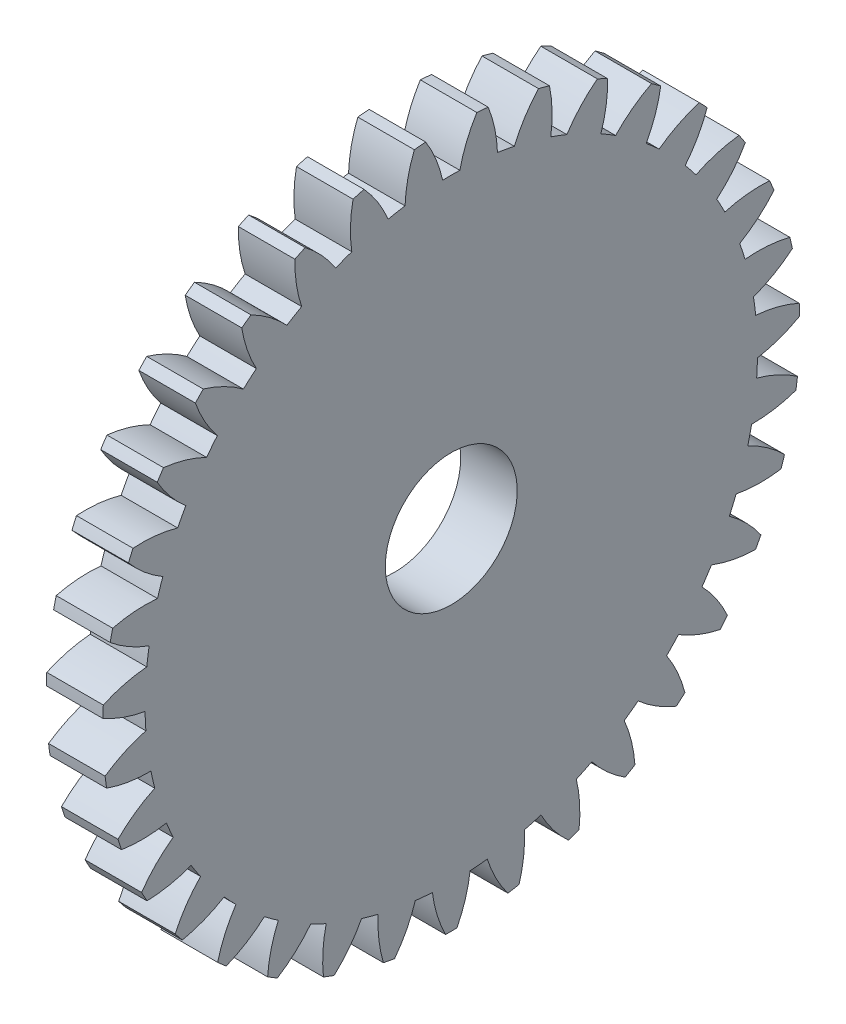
ISO-10303-21;
HEADER;
FILE_DESCRIPTION(('STEP AP214'),'2;1');
FILE_NAME('part.step','',(''),(''),'','','');
FILE_SCHEMA(('AUTOMOTIVE_DESIGN { 1 0 10303 214 1 1 1 1 }'));
ENDSEC;
DATA;
#1=APPLICATION_CONTEXT('core data for automotive mechanical design processes');
#2=APPLICATION_PROTOCOL_DEFINITION('international standard','automotive_design',2000,#1);
#3=PRODUCT_CONTEXT('',#1,'mechanical');
#4=PRODUCT('Part','Part','',(#3));
#5=PRODUCT_RELATED_PRODUCT_CATEGORY('part','',(#4));
#6=PRODUCT_DEFINITION_FORMATION('','',#4);
#7=PRODUCT_DEFINITION_CONTEXT('part definition',#1,'design');
#8=PRODUCT_DEFINITION('design','',#6,#7);
#9=PRODUCT_DEFINITION_SHAPE('','',#8);
#10=(LENGTH_UNIT() NAMED_UNIT(*) SI_UNIT(.MILLI.,.METRE.));
#11=(NAMED_UNIT(*) PLANE_ANGLE_UNIT() SI_UNIT($,.RADIAN.));
#12=(NAMED_UNIT(*) SI_UNIT($,.STERADIAN.) SOLID_ANGLE_UNIT());
#13=UNCERTAINTY_MEASURE_WITH_UNIT(LENGTH_MEASURE(1.E-05),#10,'distance_accuracy_value','');
#14=(GEOMETRIC_REPRESENTATION_CONTEXT(3) GLOBAL_UNCERTAINTY_ASSIGNED_CONTEXT((#13)) GLOBAL_UNIT_ASSIGNED_CONTEXT((#10,
#11,#12)) REPRESENTATION_CONTEXT('',''));
#15=CARTESIAN_POINT('',(0.,0.,0.));
#16=DIRECTION('',(0.,0.,1.));
#17=DIRECTION('',(1.,0.,0.));
#18=AXIS2_PLACEMENT_3D('',#15,#16,#17);
#19=CARTESIAN_POINT('',(3.,0.,0.));
#20=DIRECTION('',(-1.,0.,0.));
#21=DIRECTION('',(0.,0.,1.));
#22=AXIS2_PLACEMENT_3D('',#19,#20,#21);
#23=PLANE('',#22);
#24=CARTESIAN_POINT('',(3.,0.,0.));
#25=DIRECTION('',(-1.,0.,0.));
#26=DIRECTION('',(0.,0.,1.));
#27=AXIS2_PLACEMENT_3D('',#24,#25,#26);
#28=CIRCLE('',#27,3.5);
#29=CARTESIAN_POINT('',(3.,0.,3.5));
#30=VERTEX_POINT('',#29);
#31=EDGE_CURVE('E1360',#30,#30,#28,.F.);
#32=ORIENTED_EDGE('',*,*,#31,.F.);
#33=EDGE_LOOP('',(#32));
#34=FACE_BOUND('',#33,.T.);
#35=CARTESIAN_POINT('',(3.,6.62436355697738,15.0513575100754));
#36=DIRECTION('',(-1.,0.,0.));
#37=DIRECTION('',(0.,0.998993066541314,0.0448648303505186));
#38=AXIS2_PLACEMENT_3D('',#35,#36,#37);
#39=CIRCLE('',#38,7.);
#40=CARTESIAN_POINT('',(3.,-0.272819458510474,16.2467095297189));
#41=VERTEX_POINT('',#40);
#42=CARTESIAN_POINT('',(3.,0.528553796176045,18.492447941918));
#43=VERTEX_POINT('',#42);
#44=EDGE_CURVE('E959',#41,#43,#39,.T.);
#45=ORIENTED_EDGE('',*,*,#44,.F.);
#46=CARTESIAN_POINT('',(3.,0.,0.));
#47=DIRECTION('',(-1.,0.,0.));
#48=DIRECTION('',(0.,0.998993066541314,0.0448648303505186));
#49=AXIS2_PLACEMENT_3D('',#46,#47,#48);
#50=CIRCLE('',#49,16.249);
#51=CARTESIAN_POINT('',(3.,-1.18462264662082,16.2057604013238));
#52=VERTEX_POINT('',#51);
#53=EDGE_CURVE('E964',#52,#41,#50,.T.);
#54=ORIENTED_EDGE('',*,*,#53,.F.);
#55=CARTESIAN_POINT('',(3.,-7.9468891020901,14.3969617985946));
#56=DIRECTION('',(-1.,0.,0.));
#57=DIRECTION('',(0.,0.998993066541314,0.0448648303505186));
#58=AXIS2_PLACEMENT_3D('',#55,#56,#57);
#59=CIRCLE('',#58,7.);
#60=CARTESIAN_POINT('',(3.,-2.18407624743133,18.370623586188));
#61=VERTEX_POINT('',#60);
#62=EDGE_CURVE('E961',#61,#52,#59,.T.);
#63=ORIENTED_EDGE('',*,*,#62,.F.);
#64=CARTESIAN_POINT('',(3.,0.,0.));
#65=DIRECTION('',(-1.,0.,0.));
#66=DIRECTION('',(0.,0.,1.));
#67=AXIS2_PLACEMENT_3D('',#64,#65,#66);
#68=CIRCLE('',#67,18.5);
#69=CARTESIAN_POINT('',(3.,-2.78189436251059,18.2896436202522));
#70=VERTEX_POINT('',#69);
#71=EDGE_CURVE('E1890',#70,#61,#68,.T.);
#72=ORIENTED_EDGE('',*,*,#71,.F.);
#73=CARTESIAN_POINT('',(3.,3.83038364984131,15.9923017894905));
#74=DIRECTION('',(-1.,0.,0.));
#75=DIRECTION('',(0.,0.974927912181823,0.222520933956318));
#76=AXIS2_PLACEMENT_3D('',#73,#74,#75);
#77=CIRCLE('',#76,7.);
#78=CARTESIAN_POINT('',(3.,-3.16939714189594,15.9369044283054));
#79=VERTEX_POINT('',#78);
#80=EDGE_CURVE('E1111',#79,#70,#77,.T.);
#81=ORIENTED_EDGE('',*,*,#80,.F.);
#82=CARTESIAN_POINT('',(3.,0.,0.));
#83=DIRECTION('',(-1.,0.,0.));
#84=DIRECTION('',(0.,0.974927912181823,0.222520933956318));
#85=AXIS2_PLACEMENT_3D('',#82,#83,#84);
#86=CIRCLE('',#85,16.249);
#87=CARTESIAN_POINT('',(3.,-4.05923552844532,15.7338046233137));
#88=VERTEX_POINT('',#87);
#89=EDGE_CURVE('E1116',#88,#79,#86,.T.);
#90=ORIENTED_EDGE('',*,*,#89,.F.);
#91=CARTESIAN_POINT('',(3.,-10.3898561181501,12.7466248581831));
#92=DIRECTION('',(-1.,0.,0.));
#93=DIRECTION('',(0.,0.974927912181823,0.222520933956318));
#94=AXIS2_PLACEMENT_3D('',#91,#92,#93);
#95=CIRCLE('',#94,7.);
#96=CARTESIAN_POINT('',(3.,-5.42917874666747,17.6854182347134));
#97=VERTEX_POINT('',#96);
#98=EDGE_CURVE('E1113',#97,#88,#95,.T.);
#99=ORIENTED_EDGE('',*,*,#98,.F.);
#100=CARTESIAN_POINT('',(3.,-6.00293014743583,17.4989951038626));
#101=VERTEX_POINT('',#100);
#102=EDGE_CURVE('E1868',#101,#97,#68,.T.);
#103=ORIENTED_EDGE('',*,*,#102,.F.);
#104=CARTESIAN_POINT('',(3.,0.91329206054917,16.4192403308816));
#105=DIRECTION('',(-1.,0.,0.));
#106=DIRECTION('',(0.,0.919527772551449,0.393025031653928));
#107=AXIS2_PLACEMENT_3D('',#104,#105,#106);
#108=CIRCLE('',#107,7.);
#109=CARTESIAN_POINT('',(3.,-5.96410779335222,15.1148741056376));
#110=VERTEX_POINT('',#109);
#111=EDGE_CURVE('E1128',#110,#101,#108,.T.);
#112=ORIENTED_EDGE('',*,*,#111,.F.);
#113=CARTESIAN_POINT('',(3.,0.,0.));
#114=DIRECTION('',(-1.,0.,0.));
#115=DIRECTION('',(0.,0.919527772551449,0.393025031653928));
#116=AXIS2_PLACEMENT_3D('',#113,#114,#115);
#117=CIRCLE('',#116,16.249);
#118=CARTESIAN_POINT('',(3.,-6.80338124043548,14.7561514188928));
#119=VERTEX_POINT('',#118);
#120=EDGE_CURVE('E1133',#119,#110,#117,.T.);
#121=ORIENTED_EDGE('',*,*,#120,.F.);
#122=CARTESIAN_POINT('',(3.,-12.4988846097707,10.6866009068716));
#123=DIRECTION('',(-1.,0.,0.));
#124=DIRECTION('',(0.,0.919527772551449,0.393025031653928));
#125=AXIS2_PLACEMENT_3D('',#122,#123,#124);
#126=CIRCLE('',#125,7.);
#127=CARTESIAN_POINT('',(3.,-8.49978297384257,16.4317889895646));
#128=VERTEX_POINT('',#127);
#129=EDGE_CURVE('E1130',#128,#119,#126,.T.);
#130=ORIENTED_EDGE('',*,*,#129,.F.);
#131=CARTESIAN_POINT('',(3.,-9.03102681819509,16.1459144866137));
#132=VERTEX_POINT('',#131);
#133=EDGE_CURVE('E2068',#132,#128,#68,.T.);
#134=ORIENTED_EDGE('',*,*,#133,.F.);
#135=CARTESIAN_POINT('',(3.,-2.03315348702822,16.3184509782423));
#136=DIRECTION('',(-1.,0.,0.));
#137=DIRECTION('',(0.,0.8345732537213,0.550896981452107));
#138=AXIS2_PLACEMENT_3D('',#135,#136,#137);
#139=CIRCLE('',#138,7.);
#140=CARTESIAN_POINT('',(3.,-8.5671271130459,13.8070392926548));
#141=VERTEX_POINT('',#140);
#142=EDGE_CURVE('E1162',#141,#132,#139,.T.);
#143=ORIENTED_EDGE('',*,*,#142,.F.);
#144=CARTESIAN_POINT('',(3.,0.,0.));
#145=DIRECTION('',(-1.,0.,0.));
#146=DIRECTION('',(0.,0.8345732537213,0.550896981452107));
#147=AXIS2_PLACEMENT_3D('',#144,#145,#146);
#148=CIRCLE('',#147,16.249);
#149=CARTESIAN_POINT('',(3.,-9.32886068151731,13.3042233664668));
#150=VERTEX_POINT('',#149);
#151=EDGE_CURVE('E1167',#150,#141,#148,.T.);
#152=ORIENTED_EDGE('',*,*,#151,.F.);
#153=CARTESIAN_POINT('',(3.,-14.2061886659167,8.28310080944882));
#154=DIRECTION('',(-1.,0.,0.));
#155=DIRECTION('',(0.,0.8345732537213,0.550896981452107));
#156=AXIS2_PLACEMENT_3D('',#153,#154,#155);
#157=CIRCLE('',#156,7.);
#158=CARTESIAN_POINT('',(3.,-11.2971971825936,14.6500285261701));
#159=VERTEX_POINT('',#158);
#160=EDGE_CURVE('E1164',#159,#150,#157,.T.);
#161=ORIENTED_EDGE('',*,*,#160,.F.);
#162=CARTESIAN_POINT('',(3.,-11.768858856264,14.2738908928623));
#163=VERTEX_POINT('',#162);
#164=EDGE_CURVE('E2062',#163,#159,#68,.T.);
#165=ORIENTED_EDGE('',*,*,#164,.F.);
#166=CARTESIAN_POINT('',(3.,-4.91425180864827,15.6931731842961));
#167=DIRECTION('',(-1.,0.,0.));
#168=DIRECTION('',(0.,0.722794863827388,0.691062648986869));
#169=AXIS2_PLACEMENT_3D('',#166,#167,#168);
#170=CIRCLE('',#169,7.);
#171=CARTESIAN_POINT('',(3.,-10.8947919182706,12.0554348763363));
#172=VERTEX_POINT('',#171);
#173=EDGE_CURVE('E1145',#172,#163,#170,.T.);
#174=ORIENTED_EDGE('',*,*,#173,.F.);
#175=CARTESIAN_POINT('',(3.,0.,0.));
#176=DIRECTION('',(-1.,0.,0.));
#177=DIRECTION('',(0.,0.722794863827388,0.691062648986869));
#178=AXIS2_PLACEMENT_3D('',#175,#176,#177);
#179=CIRCLE('',#178,16.249);
#180=CARTESIAN_POINT('',(3.,-11.554502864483,11.4246866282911));
#181=VERTEX_POINT('',#180);
#182=EDGE_CURVE('E1150',#181,#172,#179,.T.);
#183=ORIENTED_EDGE('',*,*,#182,.F.);
#184=CARTESIAN_POINT('',(3.,-15.4568941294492,5.61337503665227));
#185=DIRECTION('',(-1.,0.,0.));
#186=DIRECTION('',(0.,0.722794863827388,0.691062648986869));
#187=AXIS2_PLACEMENT_3D('',#184,#185,#186);
#188=CIRCLE('',#187,7.);
#189=CARTESIAN_POINT('',(3.,-13.7315101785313,12.3974040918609));
#190=VERTEX_POINT('',#189);
#191=EDGE_CURVE('E1147',#190,#181,#188,.T.);
#192=ORIENTED_EDGE('',*,*,#191,.F.);
#193=CARTESIAN_POINT('',(3.,-14.1284300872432,11.9430927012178));
#194=VERTEX_POINT('',#193);
#195=EDGE_CURVE('E2056',#194,#190,#68,.T.);
#196=ORIENTED_EDGE('',*,*,#195,.F.);
#197=CARTESIAN_POINT('',(3.,-7.63740203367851,14.5635038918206));
#198=DIRECTION('',(-1.,0.,0.));
#199=DIRECTION('',(0.,0.587785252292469,0.809016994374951));
#200=AXIS2_PLACEMENT_3D('',#197,#198,#199);
#201=CIRCLE('',#200,7.);
#202=CARTESIAN_POINT('',(3.,-12.8722891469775,9.91635886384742));
#203=VERTEX_POINT('',#202);
#204=EDGE_CURVE('E1060',#203,#194,#201,.T.);
#205=ORIENTED_EDGE('',*,*,#204,.F.);
#206=CARTESIAN_POINT('',(3.,0.,0.));
#207=DIRECTION('',(-1.,0.,0.));
#208=DIRECTION('',(0.,0.587785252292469,0.809016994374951));
#209=AXIS2_PLACEMENT_3D('',#206,#207,#208);
#210=CIRCLE('',#209,16.249);
#211=CARTESIAN_POINT('',(3.,-13.4087738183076,9.17795106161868));
#212=VERTEX_POINT('',#211);
#213=EDGE_CURVE('E1065',#212,#203,#210,.T.);
#214=ORIENTED_EDGE('',*,*,#213,.F.);
#215=CARTESIAN_POINT('',(3.,-16.2108022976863,2.76323077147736));
#216=DIRECTION('',(-1.,0.,0.));
#217=DIRECTION('',(0.,0.587785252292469,0.809016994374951));
#218=AXIS2_PLACEMENT_3D('',#215,#216,#217);
#219=CIRCLE('',#218,7.);
#220=CARTESIAN_POINT('',(3.,-15.7244811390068,9.74631688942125));
#221=VERTEX_POINT('',#220);
#222=EDGE_CURVE('E1062',#221,#212,#219,.T.);
#223=ORIENTED_EDGE('',*,*,#222,.F.);
#224=CARTESIAN_POINT('',(3.,-16.0339019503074,9.22843368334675));
#225=VERTEX_POINT('',#224);
#226=EDGE_CURVE('E2050',#225,#221,#68,.T.);
#227=ORIENTED_EDGE('',*,*,#226,.F.);
#228=CARTESIAN_POINT('',(3.,-10.115079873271,12.9657516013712));
#229=DIRECTION('',(-1.,0.,0.));
#230=DIRECTION('',(0.,0.433883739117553,0.900968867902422));
#231=AXIS2_PLACEMENT_3D('',#228,#229,#230);
#232=CIRCLE('',#231,7.);
#233=CARTESIAN_POINT('',(3.,-14.4360604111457,7.45856291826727));
#234=VERTEX_POINT('',#233);
#235=EDGE_CURVE('E1041',#234,#225,#232,.T.);
#236=ORIENTED_EDGE('',*,*,#235,.F.);
#237=CARTESIAN_POINT('',(3.,0.,0.));
#238=DIRECTION('',(-1.,0.,0.));
#239=DIRECTION('',(0.,0.433883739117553,0.900968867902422));
#240=AXIS2_PLACEMENT_3D('',#237,#238,#239);
#241=CIRCLE('',#240,16.249);
#242=CARTESIAN_POINT('',(3.,-14.832075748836,6.63622859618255));
#243=VERTEX_POINT('',#242);
#244=EDGE_CURVE('E1046',#243,#234,#241,.T.);
#245=ORIENTED_EDGE('',*,*,#244,.F.);
#246=CARTESIAN_POINT('',(3.,-16.4436819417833,-0.175726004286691));
#247=DIRECTION('',(-1.,0.,0.));
#248=DIRECTION('',(0.,0.433883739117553,0.900968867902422));
#249=AXIS2_PLACEMENT_3D('',#246,#247,#248);
#250=CIRCLE('',#249,7.);
#251=CARTESIAN_POINT('',(3.,-17.2120543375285,6.78197504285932));
#252=VERTEX_POINT('',#251);
#253=EDGE_CURVE('E1043',#252,#243,#250,.T.);
#254=ORIENTED_EDGE('',*,*,#253,.F.);
#255=CARTESIAN_POINT('',(3.,-17.4240310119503,6.21716521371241));
#256=VERTEX_POINT('',#255);
#257=EDGE_CURVE('E2044',#256,#252,#68,.T.);
#258=ORIENTED_EDGE('',*,*,#257,.F.);
#259=CARTESIAN_POINT('',(3.,-12.2676507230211,10.9512693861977));
#260=DIRECTION('',(-1.,0.,0.));
#261=DIRECTION('',(0.,0.266036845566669,0.963962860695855));
#262=AXIS2_PLACEMENT_3D('',#259,#260,#261);
#263=CIRCLE('',#262,7.);
#264=CARTESIAN_POINT('',(3.,-15.5358448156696,4.761042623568));
#265=VERTEX_POINT('',#264);
#266=EDGE_CURVE('E1077',#265,#256,#263,.T.);
#267=ORIENTED_EDGE('',*,*,#266,.F.);
#268=CARTESIAN_POINT('',(3.,0.,0.));
#269=DIRECTION('',(-1.,0.,0.));
#270=DIRECTION('',(0.,0.266036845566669,0.963962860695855));
#271=AXIS2_PLACEMENT_3D('',#268,#269,#270);
#272=CIRCLE('',#271,16.249);
#273=CARTESIAN_POINT('',(3.,-15.7786625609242,3.88121228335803));
#274=VERTEX_POINT('',#273);
#275=EDGE_CURVE('E1082',#274,#265,#272,.T.);
#276=ORIENTED_EDGE('',*,*,#275,.F.);
#277=CARTESIAN_POINT('',(3.,-16.1480481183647,-3.10903480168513));
#278=DIRECTION('',(-1.,0.,0.));
#279=DIRECTION('',(0.,0.266036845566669,0.963962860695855));
#280=AXIS2_PLACEMENT_3D('',#277,#278,#279);
#281=CIRCLE('',#280,7.);
#282=CARTESIAN_POINT('',(3.,-18.1464179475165,3.59965493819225));
#283=VERTEX_POINT('',#282);
#284=EDGE_CURVE('E1079',#283,#274,#281,.T.);
#285=ORIENTED_EDGE('',*,*,#284,.F.);
#286=CARTESIAN_POINT('',(3.,-18.2541373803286,3.00607193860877));
#287=VERTEX_POINT('',#286);
#288=EDGE_CURVE('E2038',#287,#283,#68,.T.);
#289=ORIENTED_EDGE('',*,*,#288,.F.);
#290=CARTESIAN_POINT('',(3.,-14.0259291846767,8.58480436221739));
#291=DIRECTION('',(-1.,0.,0.));
#292=DIRECTION('',(0.,0.0896393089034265,0.99597429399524));
#293=AXIS2_PLACEMENT_3D('',#290,#291,#292);
#294=CIRCLE('',#293,7.);
#295=CARTESIAN_POINT('',(3.,-16.1362943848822,1.91049850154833));
#296=VERTEX_POINT('',#295);
#297=EDGE_CURVE('E1094',#296,#287,#294,.T.);
#298=ORIENTED_EDGE('',*,*,#297,.F.);
#299=CARTESIAN_POINT('',(3.,0.,0.));
#300=DIRECTION('',(-1.,0.,0.));
#301=DIRECTION('',(0.,0.0896393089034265,0.99597429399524));
#302=AXIS2_PLACEMENT_3D('',#299,#300,#301);
#303=CIRCLE('',#302,16.249);
#304=CARTESIAN_POINT('',(3.,-16.2181101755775,1.00145061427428));
#305=VERTEX_POINT('',#304);
#306=EDGE_CURVE('E1099',#305,#296,#303,.T.);
#307=ORIENTED_EDGE('',*,*,#306,.F.);
#308=CARTESIAN_POINT('',(3.,-15.3334027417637,-5.94241666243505));
#309=DIRECTION('',(-1.,0.,0.));
#310=DIRECTION('',(0.,0.0896393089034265,0.99597429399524));
#311=AXIS2_PLACEMENT_3D('',#308,#309,#310);
#312=CIRCLE('',#311,7.);
#313=CARTESIAN_POINT('',(3.,-18.4975407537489,0.301638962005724));
#314=VERTEX_POINT('',#313);
#315=EDGE_CURVE('E1096',#314,#305,#312,.T.);
#316=ORIENTED_EDGE('',*,*,#315,.F.);
#317=CARTESIAN_POINT('',(3.,-18.4975407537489,-0.30163896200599));
#318=VERTEX_POINT('',#317);
#319=EDGE_CURVE('E2032',#318,#314,#68,.T.);
#320=ORIENTED_EDGE('',*,*,#319,.F.);
#321=CARTESIAN_POINT('',(3.,-15.3334027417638,5.94241666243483));
#322=DIRECTION('',(-1.,0.,0.));
#323=DIRECTION('',(0.,-0.0896393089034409,0.995974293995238));
#324=AXIS2_PLACEMENT_3D('',#321,#322,#323);
#325=CIRCLE('',#324,7.);
#326=CARTESIAN_POINT('',(3.,-16.2181101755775,-1.00145061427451));
#327=VERTEX_POINT('',#326);
#328=EDGE_CURVE('E1247',#327,#318,#325,.T.);
#329=ORIENTED_EDGE('',*,*,#328,.F.);
#330=CARTESIAN_POINT('',(3.,0.,0.));
#331=DIRECTION('',(-1.,0.,0.));
#332=DIRECTION('',(0.,-0.0896393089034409,0.995974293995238));
#333=AXIS2_PLACEMENT_3D('',#330,#331,#332);
#334=CIRCLE('',#333,16.249);
#335=CARTESIAN_POINT('',(3.,-16.1362943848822,-1.91049850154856));
#336=VERTEX_POINT('',#335);
#337=EDGE_CURVE('E1252',#336,#327,#334,.T.);
#338=ORIENTED_EDGE('',*,*,#337,.F.);
#339=CARTESIAN_POINT('',(3.,-14.0259291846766,-8.58480436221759));
#340=DIRECTION('',(-1.,0.,0.));
#341=DIRECTION('',(0.,-0.0896393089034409,0.995974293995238));
#342=AXIS2_PLACEMENT_3D('',#339,#340,#341);
#343=CIRCLE('',#342,7.);
#344=CARTESIAN_POINT('',(3.,-18.2541373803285,-3.00607193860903));
#345=VERTEX_POINT('',#344);
#346=EDGE_CURVE('E1249',#345,#336,#343,.T.);
#347=ORIENTED_EDGE('',*,*,#346,.F.);
#348=CARTESIAN_POINT('',(3.,-18.1464179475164,-3.59965493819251));
#349=VERTEX_POINT('',#348);
#350=EDGE_CURVE('E2026',#349,#345,#68,.T.);
#351=ORIENTED_EDGE('',*,*,#350,.F.);
#352=CARTESIAN_POINT('',(3.,-16.1480481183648,3.1090348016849));
#353=DIRECTION('',(-1.,0.,0.));
#354=DIRECTION('',(0.,-0.266036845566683,0.963962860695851));
#355=AXIS2_PLACEMENT_3D('',#352,#353,#354);
#356=CIRCLE('',#355,7.);
#357=CARTESIAN_POINT('',(3.,-15.7786625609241,-3.88121228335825));
#358=VERTEX_POINT('',#357);
#359=EDGE_CURVE('E1264',#358,#349,#356,.T.);
#360=ORIENTED_EDGE('',*,*,#359,.F.);
#361=CARTESIAN_POINT('',(3.,0.,0.));
#362=DIRECTION('',(-1.,0.,0.));
#363=DIRECTION('',(0.,-0.266036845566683,0.963962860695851));
#364=AXIS2_PLACEMENT_3D('',#361,#362,#363);
#365=CIRCLE('',#364,16.249);
#366=CARTESIAN_POINT('',(3.,-15.5358448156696,-4.76104262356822));
#367=VERTEX_POINT('',#366);
#368=EDGE_CURVE('E1269',#367,#358,#365,.T.);
#369=ORIENTED_EDGE('',*,*,#368,.F.);
#370=CARTESIAN_POINT('',(3.,-12.2676507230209,-10.9512693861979));
#371=DIRECTION('',(-1.,0.,0.));
#372=DIRECTION('',(0.,-0.266036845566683,0.963962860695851));
#373=AXIS2_PLACEMENT_3D('',#370,#371,#372);
#374=CIRCLE('',#373,7.);
#375=CARTESIAN_POINT('',(3.,-17.4240310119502,-6.21716521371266));
#376=VERTEX_POINT('',#375);
#377=EDGE_CURVE('E1266',#376,#367,#374,.T.);
#378=ORIENTED_EDGE('',*,*,#377,.F.);
#379=CARTESIAN_POINT('',(3.,-17.2120543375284,-6.78197504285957));
#380=VERTEX_POINT('',#379);
#381=EDGE_CURVE('E2020',#380,#376,#68,.T.);
#382=ORIENTED_EDGE('',*,*,#381,.F.);
#383=CARTESIAN_POINT('',(3.,-16.4436819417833,0.175726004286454));
#384=DIRECTION('',(-1.,0.,0.));
#385=DIRECTION('',(0.,-0.433883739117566,0.900968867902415));
#386=AXIS2_PLACEMENT_3D('',#383,#384,#385);
#387=CIRCLE('',#386,7.);
#388=CARTESIAN_POINT('',(3.,-14.8320757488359,-6.63622859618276));
#389=VERTEX_POINT('',#388);
#390=EDGE_CURVE('E1298',#389,#380,#387,.T.);
#391=ORIENTED_EDGE('',*,*,#390,.F.);
#392=CARTESIAN_POINT('',(3.,0.,0.));
#393=DIRECTION('',(-1.,0.,0.));
#394=DIRECTION('',(0.,-0.433883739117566,0.900968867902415));
#395=AXIS2_PLACEMENT_3D('',#392,#393,#394);
#396=CIRCLE('',#395,16.249);
#397=CARTESIAN_POINT('',(3.,-14.4360604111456,-7.45856291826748));
#398=VERTEX_POINT('',#397);
#399=EDGE_CURVE('E1303',#398,#389,#396,.T.);
#400=ORIENTED_EDGE('',*,*,#399,.F.);
#401=CARTESIAN_POINT('',(3.,-10.1150798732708,-12.9657516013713));
#402=DIRECTION('',(-1.,0.,0.));
#403=DIRECTION('',(0.,-0.433883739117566,0.900968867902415));
#404=AXIS2_PLACEMENT_3D('',#401,#402,#403);
#405=CIRCLE('',#404,7.);
#406=CARTESIAN_POINT('',(3.,-16.0339019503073,-9.22843368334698));
#407=VERTEX_POINT('',#406);
#408=EDGE_CURVE('E1300',#407,#398,#405,.T.);
#409=ORIENTED_EDGE('',*,*,#408,.F.);
#410=CARTESIAN_POINT('',(3.,-15.7244811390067,-9.74631688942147));
#411=VERTEX_POINT('',#410);
#412=EDGE_CURVE('E2014',#411,#407,#68,.T.);
#413=ORIENTED_EDGE('',*,*,#412,.F.);
#414=CARTESIAN_POINT('',(3.,-16.2108022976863,-2.76323077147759));
#415=DIRECTION('',(-1.,0.,0.));
#416=DIRECTION('',(0.,-0.58778525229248,0.809016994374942));
#417=AXIS2_PLACEMENT_3D('',#414,#415,#416);
#418=CIRCLE('',#417,7.);
#419=CARTESIAN_POINT('',(3.,-13.4087738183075,-9.17795106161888));
#420=VERTEX_POINT('',#419);
#421=EDGE_CURVE('E1281',#420,#411,#418,.T.);
#422=ORIENTED_EDGE('',*,*,#421,.F.);
#423=CARTESIAN_POINT('',(3.,0.,0.));
#424=DIRECTION('',(-1.,0.,0.));
#425=DIRECTION('',(0.,-0.58778525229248,0.809016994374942));
#426=AXIS2_PLACEMENT_3D('',#423,#424,#425);
#427=CIRCLE('',#426,16.249);
#428=CARTESIAN_POINT('',(3.,-12.8722891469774,-9.91635886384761));
#429=VERTEX_POINT('',#428);
#430=EDGE_CURVE('E1286',#429,#420,#427,.T.);
#431=ORIENTED_EDGE('',*,*,#430,.F.);
#432=CARTESIAN_POINT('',(3.,-7.6374020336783,-14.5635038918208));
#433=DIRECTION('',(-1.,0.,0.));
#434=DIRECTION('',(0.,-0.58778525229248,0.809016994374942));
#435=AXIS2_PLACEMENT_3D('',#432,#433,#434);
#436=CIRCLE('',#435,7.);
#437=CARTESIAN_POINT('',(3.,-14.128430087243,-11.943092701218));
#438=VERTEX_POINT('',#437);
#439=EDGE_CURVE('E1283',#438,#429,#436,.T.);
#440=ORIENTED_EDGE('',*,*,#439,.F.);
#441=CARTESIAN_POINT('',(3.,-13.7315101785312,-12.3974040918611));
#442=VERTEX_POINT('',#441);
#443=EDGE_CURVE('E2008',#442,#438,#68,.T.);
#444=ORIENTED_EDGE('',*,*,#443,.F.);
#445=CARTESIAN_POINT('',(3.,-15.4568941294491,-5.6133750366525));
#446=DIRECTION('',(-1.,0.,0.));
#447=DIRECTION('',(0.,-0.722794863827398,0.691062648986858));
#448=AXIS2_PLACEMENT_3D('',#445,#446,#447);
#449=CIRCLE('',#448,7.);
#450=CARTESIAN_POINT('',(3.,-11.5545028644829,-11.4246866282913));
#451=VERTEX_POINT('',#450);
#452=EDGE_CURVE('E1196',#451,#442,#449,.T.);
#453=ORIENTED_EDGE('',*,*,#452,.F.);
#454=CARTESIAN_POINT('',(3.,0.,0.));
#455=DIRECTION('',(-1.,0.,0.));
#456=DIRECTION('',(0.,-0.722794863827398,0.691062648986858));
#457=AXIS2_PLACEMENT_3D('',#454,#455,#456);
#458=CIRCLE('',#457,16.249);
#459=CARTESIAN_POINT('',(3.,-10.8947919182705,-12.0554348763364));
#460=VERTEX_POINT('',#459);
#461=EDGE_CURVE('E1201',#460,#451,#458,.T.);
#462=ORIENTED_EDGE('',*,*,#461,.F.);
#463=CARTESIAN_POINT('',(3.,-4.91425180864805,-15.6931731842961));
#464=DIRECTION('',(-1.,0.,0.));
#465=DIRECTION('',(0.,-0.722794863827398,0.691062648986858));
#466=AXIS2_PLACEMENT_3D('',#463,#464,#465);
#467=CIRCLE('',#466,7.);
#468=CARTESIAN_POINT('',(3.,-11.7688588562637,-14.2738908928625));
#469=VERTEX_POINT('',#468);
#470=EDGE_CURVE('E1198',#469,#460,#467,.T.);
#471=ORIENTED_EDGE('',*,*,#470,.F.);
#472=CARTESIAN_POINT('',(3.,-11.2971971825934,-14.6500285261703));
#473=VERTEX_POINT('',#472);
#474=EDGE_CURVE('E2002',#473,#469,#68,.T.);
#475=ORIENTED_EDGE('',*,*,#474,.F.);
#476=CARTESIAN_POINT('',(3.,-14.2061886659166,-8.28310080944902));
#477=DIRECTION('',(-1.,0.,0.));
#478=DIRECTION('',(0.,-0.834573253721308,0.550896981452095));
#479=AXIS2_PLACEMENT_3D('',#476,#477,#478);
#480=CIRCLE('',#479,7.);
#481=CARTESIAN_POINT('',(3.,-9.32886068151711,-13.3042233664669));
#482=VERTEX_POINT('',#481);
#483=EDGE_CURVE('E1177',#482,#473,#480,.T.);
#484=ORIENTED_EDGE('',*,*,#483,.F.);
#485=CARTESIAN_POINT('',(3.,0.,0.));
#486=DIRECTION('',(-1.,0.,0.));
#487=DIRECTION('',(0.,-0.834573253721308,0.550896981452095));
#488=AXIS2_PLACEMENT_3D('',#485,#486,#487);
#489=CIRCLE('',#488,16.249);
#490=CARTESIAN_POINT('',(3.,-8.56712711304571,-13.8070392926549));
#491=VERTEX_POINT('',#490);
#492=EDGE_CURVE('E1182',#491,#482,#489,.T.);
#493=ORIENTED_EDGE('',*,*,#492,.F.);
#494=CARTESIAN_POINT('',(3.,-2.03315348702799,-16.3184509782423));
#495=DIRECTION('',(-1.,0.,0.));
#496=DIRECTION('',(0.,-0.834573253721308,0.550896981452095));
#497=AXIS2_PLACEMENT_3D('',#494,#495,#496);
#498=CIRCLE('',#497,7.);
#499=CARTESIAN_POINT('',(3.,-9.03102681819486,-16.1459144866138));
#500=VERTEX_POINT('',#499);
#501=EDGE_CURVE('E1179',#500,#491,#498,.T.);
#502=ORIENTED_EDGE('',*,*,#501,.F.);
#503=CARTESIAN_POINT('',(3.,-8.49978297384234,-16.4317889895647));
#504=VERTEX_POINT('',#503);
#505=EDGE_CURVE('E1996',#504,#500,#68,.T.);
#506=ORIENTED_EDGE('',*,*,#505,.F.);
#507=CARTESIAN_POINT('',(3.,-12.4988846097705,-10.6866009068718));
#508=DIRECTION('',(-1.,0.,0.));
#509=DIRECTION('',(0.,-0.919527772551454,0.393025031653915));
#510=AXIS2_PLACEMENT_3D('',#507,#508,#509);
#511=CIRCLE('',#510,7.);
#512=CARTESIAN_POINT('',(3.,-6.80338124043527,-14.7561514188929));
#513=VERTEX_POINT('',#512);
#514=EDGE_CURVE('E1213',#513,#504,#511,.T.);
#515=ORIENTED_EDGE('',*,*,#514,.F.);
#516=CARTESIAN_POINT('',(3.,0.,0.));
#517=DIRECTION('',(-1.,0.,0.));
#518=DIRECTION('',(0.,-0.919527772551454,0.393025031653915));
#519=AXIS2_PLACEMENT_3D('',#516,#517,#518);
#520=CIRCLE('',#519,16.249);
#521=CARTESIAN_POINT('',(3.,-5.964107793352,-15.1148741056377));
#522=VERTEX_POINT('',#521);
#523=EDGE_CURVE('E1218',#522,#513,#520,.T.);
#524=ORIENTED_EDGE('',*,*,#523,.F.);
#525=CARTESIAN_POINT('',(3.,0.913292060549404,-16.4192403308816));
#526=DIRECTION('',(-1.,0.,0.));
#527=DIRECTION('',(0.,-0.919527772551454,0.393025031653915));
#528=AXIS2_PLACEMENT_3D('',#525,#526,#527);
#529=CIRCLE('',#528,7.);
#530=CARTESIAN_POINT('',(3.,-6.00293014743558,-17.4989951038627));
#531=VERTEX_POINT('',#530);
#532=EDGE_CURVE('E1215',#531,#522,#529,.T.);
#533=ORIENTED_EDGE('',*,*,#532,.F.);
#534=CARTESIAN_POINT('',(3.,-5.42917874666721,-17.6854182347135));
#535=VERTEX_POINT('',#534);
#536=EDGE_CURVE('E1990',#535,#531,#68,.T.);
#537=ORIENTED_EDGE('',*,*,#536,.F.);
#538=CARTESIAN_POINT('',(3.,-10.3898561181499,-12.7466248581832));
#539=DIRECTION('',(-1.,0.,0.));
#540=DIRECTION('',(0.,-0.974927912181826,0.222520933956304));
#541=AXIS2_PLACEMENT_3D('',#538,#539,#540);
#542=CIRCLE('',#541,7.);
#543=CARTESIAN_POINT('',(3.,-4.05923552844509,-15.7338046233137));
#544=VERTEX_POINT('',#543);
#545=EDGE_CURVE('E1230',#544,#535,#542,.T.);
#546=ORIENTED_EDGE('',*,*,#545,.F.);
#547=CARTESIAN_POINT('',(3.,0.,0.));
#548=DIRECTION('',(-1.,0.,0.));
#549=DIRECTION('',(0.,-0.974927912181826,0.222520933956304));
#550=AXIS2_PLACEMENT_3D('',#547,#548,#549);
#551=CIRCLE('',#550,16.249);
#552=CARTESIAN_POINT('',(3.,-3.1693971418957,-15.9369044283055));
#553=VERTEX_POINT('',#552);
#554=EDGE_CURVE('E1235',#553,#544,#551,.T.);
#555=ORIENTED_EDGE('',*,*,#554,.F.);
#556=CARTESIAN_POINT('',(3.,3.83038364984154,-15.9923017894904));
#557=DIRECTION('',(-1.,0.,0.));
#558=DIRECTION('',(0.,-0.974927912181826,0.222520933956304));
#559=AXIS2_PLACEMENT_3D('',#556,#557,#558);
#560=CIRCLE('',#559,7.);
#561=CARTESIAN_POINT('',(3.,-2.78189436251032,-18.2896436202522));
#562=VERTEX_POINT('',#561);
#563=EDGE_CURVE('E1232',#562,#553,#560,.T.);
#564=ORIENTED_EDGE('',*,*,#563,.F.);
#565=CARTESIAN_POINT('',(3.,-2.18407624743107,-18.370623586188));
#566=VERTEX_POINT('',#565);
#567=EDGE_CURVE('E1984',#566,#562,#68,.T.);
#568=ORIENTED_EDGE('',*,*,#567,.F.);
#569=CARTESIAN_POINT('',(3.,-7.9468891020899,-14.3969617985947));
#570=DIRECTION('',(-1.,0.,0.));
#571=DIRECTION('',(0.,-0.998993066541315,0.0448648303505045));
#572=AXIS2_PLACEMENT_3D('',#569,#570,#571);
#573=CIRCLE('',#572,7.);
#574=CARTESIAN_POINT('',(3.,-1.18462264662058,-16.2057604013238));
#575=VERTEX_POINT('',#574);
#576=EDGE_CURVE('E1400',#575,#566,#573,.T.);
#577=ORIENTED_EDGE('',*,*,#576,.F.);
#578=CARTESIAN_POINT('',(3.,0.,0.));
#579=DIRECTION('',(-1.,0.,0.));
#580=DIRECTION('',(0.,-0.998993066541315,0.0448648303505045));
#581=AXIS2_PLACEMENT_3D('',#578,#579,#580);
#582=CIRCLE('',#581,16.249);
#583=CARTESIAN_POINT('',(3.,-0.272819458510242,-16.2467095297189));
#584=VERTEX_POINT('',#583);
#585=EDGE_CURVE('E1405',#584,#575,#582,.T.);
#586=ORIENTED_EDGE('',*,*,#585,.F.);
#587=CARTESIAN_POINT('',(3.,6.62436355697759,-15.0513575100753));
#588=DIRECTION('',(-1.,0.,0.));
#589=DIRECTION('',(0.,-0.998993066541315,0.0448648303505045));
#590=AXIS2_PLACEMENT_3D('',#587,#588,#589);
#591=CIRCLE('',#590,7.);
#592=CARTESIAN_POINT('',(3.,0.528553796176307,-18.492447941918));
#593=VERTEX_POINT('',#592);
#594=EDGE_CURVE('E1402',#593,#584,#591,.T.);
#595=ORIENTED_EDGE('',*,*,#594,.F.);
#596=CARTESIAN_POINT('',(3.,1.13122425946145,-18.465381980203));
#597=VERTEX_POINT('',#596);
#598=EDGE_CURVE('E1978',#597,#593,#68,.T.);
#599=ORIENTED_EDGE('',*,*,#598,.F.);
#600=CARTESIAN_POINT('',(3.,-5.24850253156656,-15.5845685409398));
#601=DIRECTION('',(-1.,0.,0.));
#602=DIRECTION('',(0.,-0.990949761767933,-0.134233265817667));
#603=AXIS2_PLACEMENT_3D('',#600,#601,#602);
#604=CIRCLE('',#603,7.);
#605=CARTESIAN_POINT('',(3.,1.72806498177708,-16.1568497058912));
#606=VERTEX_POINT('',#605);
#607=EDGE_CURVE('E1417',#606,#597,#604,.T.);
#608=ORIENTED_EDGE('',*,*,#607,.F.);
#609=CARTESIAN_POINT('',(3.,0.,0.));
#610=DIRECTION('',(-1.,0.,0.));
#611=DIRECTION('',(0.,-0.990949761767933,-0.134233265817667));
#612=AXIS2_PLACEMENT_3D('',#609,#610,#611);
#613=CIRCLE('',#612,16.249);
#614=CARTESIAN_POINT('',(3.,2.63252686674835,-16.03433201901));
#615=VERTEX_POINT('',#614);
#616=EDGE_CURVE('E1422',#615,#606,#613,.T.);
#617=ORIENTED_EDGE('',*,*,#616,.F.);
#618=CARTESIAN_POINT('',(3.,9.20543096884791,-13.6266502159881));
#619=DIRECTION('',(-1.,0.,0.));
#620=DIRECTION('',(0.,-0.990949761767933,-0.134233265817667));
#621=AXIS2_PLACEMENT_3D('',#618,#619,#620);
#622=CIRCLE('',#621,7.);
#623=CARTESIAN_POINT('',(3.,3.82201380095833,-18.1008897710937));
#624=VERTEX_POINT('',#623);
#625=EDGE_CURVE('E1419',#624,#615,#622,.T.);
#626=ORIENTED_EDGE('',*,*,#625,.F.);
#627=CARTESIAN_POINT('',(3.,4.41016628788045,-17.9666478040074));
#628=VERTEX_POINT('',#627);
#629=EDGE_CURVE('E1972',#628,#624,#68,.T.);
#630=ORIENTED_EDGE('',*,*,#629,.F.);
#631=CARTESIAN_POINT('',(3.,-2.38142477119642,-16.2712744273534));
#632=DIRECTION('',(-1.,0.,0.));
#633=DIRECTION('',(0.,-0.95105651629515,-0.309016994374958));
#634=AXIS2_PLACEMENT_3D('',#631,#632,#633);
#635=CIRCLE('',#634,7.);
#636=CARTESIAN_POINT('',(3.,4.58521117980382,-15.588644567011));
#637=VERTEX_POINT('',#636);
#638=EDGE_CURVE('E1434',#637,#628,#635,.T.);
#639=ORIENTED_EDGE('',*,*,#638,.F.);
#640=CARTESIAN_POINT('',(3.,0.,0.));
#641=DIRECTION('',(-1.,0.,0.));
#642=DIRECTION('',(0.,-0.95105651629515,-0.309016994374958));
#643=AXIS2_PLACEMENT_3D('',#640,#641,#642);
#644=CIRCLE('',#643,16.249);
#645=CARTESIAN_POINT('',(3.,5.45326161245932,-15.3065978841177));
#646=VERTEX_POINT('',#645);
#647=EDGE_CURVE('E1439',#646,#637,#644,.T.);
#648=ORIENTED_EDGE('',*,*,#647,.F.);
#649=CARTESIAN_POINT('',(3.,11.4906282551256,-11.7639711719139));
#650=DIRECTION('',(-1.,0.,0.));
#651=DIRECTION('',(0.,-0.95105651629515,-0.309016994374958));
#652=AXIS2_PLACEMENT_3D('',#649,#650,#651);
#653=CIRCLE('',#652,7.);
#654=CARTESIAN_POINT('',(3.,6.99263113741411,-17.1275541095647));
#655=VERTEX_POINT('',#654);
#656=EDGE_CURVE('E1436',#655,#646,#653,.T.);
#657=ORIENTED_EDGE('',*,*,#656,.F.);
#658=CARTESIAN_POINT('',(3.,7.54736194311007,-16.8904507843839));
#659=VERTEX_POINT('',#658);
#660=EDGE_CURVE('E1966',#659,#655,#68,.T.);
#661=ORIENTED_EDGE('',*,*,#660,.F.);
#662=CARTESIAN_POINT('',(3.,0.56219394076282,-16.4350081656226));
#663=DIRECTION('',(-1.,0.,0.));
#664=DIRECTION('',(0.,-0.880595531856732,-0.473868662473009));
#665=AXIS2_PLACEMENT_3D('',#662,#663,#664);
#666=CIRCLE('',#665,7.);
#667=CARTESIAN_POINT('',(3.,7.29498491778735,-14.5194075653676));
#668=VERTEX_POINT('',#667);
#669=EDGE_CURVE('E1451',#668,#659,#666,.T.);
#670=ORIENTED_EDGE('',*,*,#669,.F.);
#671=CARTESIAN_POINT('',(3.,0.,0.));
#672=DIRECTION('',(-1.,0.,0.));
#673=DIRECTION('',(0.,-0.880595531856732,-0.473868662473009));
#674=AXIS2_PLACEMENT_3D('',#671,#672,#673);
#675=CIRCLE('',#674,16.249);
#676=CARTESIAN_POINT('',(3.,8.09872404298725,-14.0868970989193));
#677=VERTEX_POINT('',#676);
#678=EDGE_CURVE('E1456',#677,#668,#675,.T.);
#679=ORIENTED_EDGE('',*,*,#678,.F.);
#680=CARTESIAN_POINT('',(3.,13.4065072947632,-9.52318841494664));
#681=DIRECTION('',(-1.,0.,0.));
#682=DIRECTION('',(0.,-0.880595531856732,-0.473868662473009));
#683=AXIS2_PLACEMENT_3D('',#680,#681,#682);
#684=CIRCLE('',#683,7.);
#685=CARTESIAN_POINT('',(3.,9.93849955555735,-15.6037247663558));
#686=VERTEX_POINT('',#685);
#687=EDGE_CURVE('E1453',#686,#677,#684,.T.);
#688=ORIENTED_EDGE('',*,*,#687,.F.);
#689=CARTESIAN_POINT('',(3.,10.441979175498,-15.2713807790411));
#690=VERTEX_POINT('',#689);
#691=EDGE_CURVE('E1960',#690,#686,#68,.T.);
#692=ORIENTED_EDGE('',*,*,#691,.F.);
#693=CARTESIAN_POINT('',(3.,3.48774327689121,-16.0705072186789));
#694=DIRECTION('',(-1.,0.,0.));
#695=DIRECTION('',(0.,-0.781831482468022,-0.623489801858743));
#696=AXIS2_PLACEMENT_3D('',#693,#694,#695);
#697=CIRCLE('',#696,7.);
#698=CARTESIAN_POINT('',(3.,9.77029183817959,-12.983504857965));
#699=VERTEX_POINT('',#698);
#700=EDGE_CURVE('E1383',#699,#690,#697,.T.);
#701=ORIENTED_EDGE('',*,*,#700,.F.);
#702=CARTESIAN_POINT('',(3.,0.,0.));
#703=DIRECTION('',(-1.,0.,0.));
#704=DIRECTION('',(0.,-0.781831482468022,-0.623489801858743));
#705=AXIS2_PLACEMENT_3D('',#702,#703,#704);
#706=CIRCLE('',#705,16.249);
#707=CARTESIAN_POINT('',(3.,10.4838868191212,-12.414431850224));
#708=VERTEX_POINT('',#707);
#709=EDGE_CURVE('E1388',#708,#699,#706,.T.);
#710=ORIENTED_EDGE('',*,*,#709,.F.);
#711=CARTESIAN_POINT('',(3.,14.8914901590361,-6.9763225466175));
#712=DIRECTION('',(-1.,0.,0.));
#713=DIRECTION('',(0.,-0.781831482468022,-0.623489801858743));
#714=AXIS2_PLACEMENT_3D('',#711,#712,#713);
#715=CIRCLE('',#714,7.);
#716=CARTESIAN_POINT('',(3.,12.5649364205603,-13.5783788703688));
#717=VERTEX_POINT('',#716);
#718=EDGE_CURVE('E1385',#717,#708,#715,.T.);
#719=ORIENTED_EDGE('',*,*,#718,.F.);
#720=CARTESIAN_POINT('',(3.,13.0009826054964,-13.1614760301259));
#721=VERTEX_POINT('',#720);
#722=EDGE_CURVE('E1954',#721,#717,#68,.T.);
#723=ORIENTED_EDGE('',*,*,#722,.F.);
#724=CARTESIAN_POINT('',(3.,6.30119367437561,-15.1894869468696));
#725=DIRECTION('',(-1.,0.,0.));
#726=DIRECTION('',(0.,-0.657938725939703,-0.75307146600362));
#727=AXIS2_PLACEMENT_3D('',#724,#725,#726);
#728=CIRCLE('',#727,7.);
#729=CARTESIAN_POINT('',(3.,11.9315735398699,-11.030301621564));
#730=VERTEX_POINT('',#729);
#731=EDGE_CURVE('E1366',#730,#721,#728,.T.);
#732=ORIENTED_EDGE('',*,*,#731,.F.);
#733=CARTESIAN_POINT('',(3.,0.,0.));
#734=DIRECTION('',(-1.,0.,0.));
#735=DIRECTION('',(0.,-0.657938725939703,-0.75307146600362));
#736=AXIS2_PLACEMENT_3D('',#733,#734,#735);
#737=CIRCLE('',#736,16.249);
#738=CARTESIAN_POINT('',(3.,12.5320888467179,-10.342956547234));
#739=VERTEX_POINT('',#738);
#740=EDGE_CURVE('E1371',#739,#730,#737,.T.);
#741=ORIENTED_EDGE('',*,*,#740,.F.);
#742=CARTESIAN_POINT('',(3.,15.8978482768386,-4.20523193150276));
#743=DIRECTION('',(-1.,0.,0.));
#744=DIRECTION('',(0.,-0.657938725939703,-0.75307146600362));
#745=AXIS2_PLACEMENT_3D('',#742,#743,#744);
#746=CIRCLE('',#745,7.);
#747=CARTESIAN_POINT('',(3.,14.7875258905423,-11.1166127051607));
#748=VERTEX_POINT('',#747);
#749=EDGE_CURVE('E1368',#748,#739,#746,.T.);
#750=ORIENTED_EDGE('',*,*,#749,.F.);
#751=CARTESIAN_POINT('',(3.,15.14212375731,-10.628550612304));
#752=VERTEX_POINT('',#751);
#753=EDGE_CURVE('E1948',#752,#748,#68,.T.);
#754=ORIENTED_EDGE('',*,*,#753,.F.);
#755=CARTESIAN_POINT('',(3.,8.91211852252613,-13.8202640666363));
#756=DIRECTION('',(-1.,0.,0.));
#757=DIRECTION('',(0.,-0.512899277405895,-0.858448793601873));
#758=AXIS2_PLACEMENT_3D('',#755,#756,#757);
#759=CIRCLE('',#758,7.);
#760=CARTESIAN_POINT('',(3.,13.7093646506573,-8.72257541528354));
#761=VERTEX_POINT('',#760);
#762=EDGE_CURVE('E1313',#761,#752,#759,.T.);
#763=ORIENTED_EDGE('',*,*,#762,.F.);
#764=CARTESIAN_POINT('',(3.,0.,0.));
#765=DIRECTION('',(-1.,0.,0.));
#766=DIRECTION('',(0.,-0.512899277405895,-0.858448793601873));
#767=AXIS2_PLACEMENT_3D('',#764,#765,#766);
#768=CIRCLE('',#767,16.249);
#769=CARTESIAN_POINT('',(3.,14.1774992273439,-7.93905011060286));
#770=VERTEX_POINT('',#769);
#771=EDGE_CURVE('E1318',#770,#761,#768,.T.);
#772=ORIENTED_EDGE('',*,*,#771,.F.);
#773=CARTESIAN_POINT('',(3.,16.3932364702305,-1.29898170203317));
#774=DIRECTION('',(-1.,0.,0.));
#775=DIRECTION('',(0.,-0.512899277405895,-0.858448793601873));
#776=AXIS2_PLACEMENT_3D('',#773,#774,#775);
#777=CIRCLE('',#776,7.);
#778=CARTESIAN_POINT('',(3.,16.5348321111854,-8.29754946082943));
#779=VERTEX_POINT('',#778);
#780=EDGE_CURVE('E1315',#779,#770,#777,.T.);
#781=ORIENTED_EDGE('',*,*,#780,.F.);
#782=CARTESIAN_POINT('',(3.,16.7965845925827,-7.75401483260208));
#783=VERTEX_POINT('',#782);
#784=EDGE_CURVE('E1942',#783,#779,#68,.T.);
#785=ORIENTED_EDGE('',*,*,#784,.F.);
#786=CARTESIAN_POINT('',(3.,11.2366005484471,-12.0068465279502));
#787=DIRECTION('',(-1.,0.,0.));
#788=DIRECTION('',(0.,-0.351374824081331,-0.936234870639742));
#789=AXIS2_PLACEMENT_3D('',#786,#787,#788);
#790=CIRCLE('',#789,7.);
#791=CARTESIAN_POINT('',(3.,15.0465255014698,-6.13449845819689));
#792=VERTEX_POINT('',#791);
#793=EDGE_CURVE('E1332',#792,#783,#790,.T.);
#794=ORIENTED_EDGE('',*,*,#793,.F.);
#795=CARTESIAN_POINT('',(3.,0.,0.));
#796=DIRECTION('',(-1.,0.,0.));
#797=DIRECTION('',(0.,-0.351374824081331,-0.936234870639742));
#798=AXIS2_PLACEMENT_3D('',#795,#796,#797);
#799=CIRCLE('',#798,16.249);
#800=CARTESIAN_POINT('',(3.,15.3672331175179,-5.27997607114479));
#801=VERTEX_POINT('',#800);
#802=EDGE_CURVE('E1337',#801,#792,#799,.T.);
#803=ORIENTED_EDGE('',*,*,#802,.F.);
#804=CARTESIAN_POINT('',(3.,16.3617325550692,1.64901886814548));
#805=DIRECTION('',(-1.,0.,0.));
#806=DIRECTION('',(0.,-0.351374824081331,-0.936234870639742));
#807=AXIS2_PLACEMENT_3D('',#804,#805,#806);
#808=CIRCLE('',#807,7.);
#809=CARTESIAN_POINT('',(3.,17.7506952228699,-5.21179614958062));
#810=VERTEX_POINT('',#809);
#811=EDGE_CURVE('E1334',#810,#801,#808,.T.);
#812=ORIENTED_EDGE('',*,*,#811,.F.);
#813=CARTESIAN_POINT('',(3.,17.911189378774,-4.63025863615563));
#814=VERTEX_POINT('',#813);
#815=EDGE_CURVE('E1651',#814,#810,#68,.T.);
#816=ORIENTED_EDGE('',*,*,#815,.F.);
#817=CARTESIAN_POINT('',(3.,13.1999289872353,-9.80751906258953));
#818=DIRECTION('',(-1.,0.,0.));
#819=DIRECTION('',(0.,-0.178556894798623,-0.983929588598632));
#820=AXIS2_PLACEMENT_3D('',#817,#818,#819);
#821=CIRCLE('',#820,7.);
#822=CARTESIAN_POINT('',(3.,15.9000786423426,-3.34925367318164));
#823=VERTEX_POINT('',#822);
#824=EDGE_CURVE('E1349',#823,#814,#821,.T.);
#825=ORIENTED_EDGE('',*,*,#824,.F.);
#826=CARTESIAN_POINT('',(3.,0.,0.));
#827=DIRECTION('',(-1.,0.,0.));
#828=DIRECTION('',(0.,-0.178556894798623,-0.983929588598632));
#829=AXIS2_PLACEMENT_3D('',#826,#827,#828);
#830=CIRCLE('',#829,16.249);
#831=CARTESIAN_POINT('',(3.,16.0630514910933,-2.45119925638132));
#832=VERTEX_POINT('',#831);
#833=EDGE_CURVE('E1354',#832,#823,#830,.T.);
#834=ORIENTED_EDGE('',*,*,#833,.F.);
#835=CARTESIAN_POINT('',(3.,15.8043490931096,4.54401861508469));
#836=DIRECTION('',(-1.,0.,0.));
#837=DIRECTION('',(0.,-0.178556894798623,-0.983929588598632));
#838=AXIS2_PLACEMENT_3D('',#835,#836,#837);
#839=CIRCLE('',#838,7.);
#840=CARTESIAN_POINT('',(3.,18.3960363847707,-1.95853142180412));
#841=VERTEX_POINT('',#840);
#842=EDGE_CURVE('E1351',#841,#832,#839,.T.);
#843=ORIENTED_EDGE('',*,*,#842,.F.);
#844=CARTESIAN_POINT('',(3.,18.4501138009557,-1.35768211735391));
#845=VERTEX_POINT('',#844);
#846=EDGE_CURVE('E1647',#845,#841,#68,.T.);
#847=ORIENTED_EDGE('',*,*,#846,.F.);
#848=CARTESIAN_POINT('',(3.,14.7390008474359,-7.2929698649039));
#849=DIRECTION('',(-1.,0.,0.));
#850=DIRECTION('',(0.,0.,-1.));
#851=AXIS2_PLACEMENT_3D('',#848,#849,#850);
#852=CIRCLE('',#851,7.);
#853=CARTESIAN_POINT('',(3.,16.2425901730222,-0.456361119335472));
#854=VERTEX_POINT('',#853);
#855=EDGE_CURVE('E1619',#854,#845,#852,.T.);
#856=ORIENTED_EDGE('',*,*,#855,.F.);
#857=CARTESIAN_POINT('',(3.,0.,0.));
#858=DIRECTION('',(-1.,0.,0.));
#859=DIRECTION('',(0.,0.,-1.));
#860=AXIS2_PLACEMENT_3D('',#857,#858,#859);
#861=CIRCLE('',#860,16.249);
#862=CARTESIAN_POINT('',(3.,16.2425901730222,0.456361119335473));
#863=VERTEX_POINT('',#862);
#864=EDGE_CURVE('E1624',#863,#854,#861,.T.);
#865=ORIENTED_EDGE('',*,*,#864,.F.);
#866=CARTESIAN_POINT('',(3.,14.7390008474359,7.2929698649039));
#867=DIRECTION('',(-1.,0.,0.));
#868=DIRECTION('',(0.,0.,-1.));
#869=AXIS2_PLACEMENT_3D('',#866,#867,#868);
#870=CIRCLE('',#869,7.);
#871=CARTESIAN_POINT('',(3.,18.4501138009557,1.35768211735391));
#872=VERTEX_POINT('',#871);
#873=EDGE_CURVE('E1621',#872,#863,#870,.T.);
#874=ORIENTED_EDGE('',*,*,#873,.F.);
#875=CARTESIAN_POINT('',(3.,18.3960363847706,1.95853142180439));
#876=VERTEX_POINT('',#875);
#877=EDGE_CURVE('E1644',#876,#872,#68,.T.);
#878=ORIENTED_EDGE('',*,*,#877,.F.);
#879=CARTESIAN_POINT('',(3.,15.8043490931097,-4.54401861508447));
#880=DIRECTION('',(-1.,0.,0.));
#881=DIRECTION('',(0.,0.178556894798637,-0.98392958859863));
#882=AXIS2_PLACEMENT_3D('',#879,#880,#881);
#883=CIRCLE('',#882,7.);
#884=CARTESIAN_POINT('',(3.,16.0630514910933,2.45119925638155));
#885=VERTEX_POINT('',#884);
#886=EDGE_CURVE('E1597',#885,#876,#883,.T.);
#887=ORIENTED_EDGE('',*,*,#886,.F.);
#888=CARTESIAN_POINT('',(3.,0.,0.));
#889=DIRECTION('',(-1.,0.,0.));
#890=DIRECTION('',(0.,0.178556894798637,-0.98392958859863));
#891=AXIS2_PLACEMENT_3D('',#888,#889,#890);
#892=CIRCLE('',#891,16.249);
#893=CARTESIAN_POINT('',(3.,15.9000786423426,3.34925367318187));
#894=VERTEX_POINT('',#893);
#895=EDGE_CURVE('E1602',#894,#885,#892,.T.);
#896=ORIENTED_EDGE('',*,*,#895,.F.);
#897=CARTESIAN_POINT('',(3.,13.1999289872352,9.80751906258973));
#898=DIRECTION('',(-1.,0.,0.));
#899=DIRECTION('',(0.,0.178556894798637,-0.98392958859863));
#900=AXIS2_PLACEMENT_3D('',#897,#898,#899);
#901=CIRCLE('',#900,7.);
#902=CARTESIAN_POINT('',(3.,17.9111893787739,4.63025863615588));
#903=VERTEX_POINT('',#902);
#904=EDGE_CURVE('E1599',#903,#894,#901,.T.);
#905=ORIENTED_EDGE('',*,*,#904,.F.);
#906=CARTESIAN_POINT('',(3.,17.7506952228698,5.21179614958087));
#907=VERTEX_POINT('',#906);
#908=EDGE_CURVE('E1652',#907,#903,#68,.T.);
#909=ORIENTED_EDGE('',*,*,#908,.F.);
#910=CARTESIAN_POINT('',(3.,16.3617325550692,-1.64901886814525));
#911=DIRECTION('',(-1.,0.,0.));
#912=DIRECTION('',(0.,0.351374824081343,-0.936234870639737));
#913=AXIS2_PLACEMENT_3D('',#910,#911,#912);
#914=CIRCLE('',#913,7.);
#915=CARTESIAN_POINT('',(3.,15.3672331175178,5.279976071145));
#916=VERTEX_POINT('',#915);
#917=EDGE_CURVE('E1007',#916,#907,#914,.T.);
#918=ORIENTED_EDGE('',*,*,#917,.F.);
#919=CARTESIAN_POINT('',(3.,0.,0.));
#920=DIRECTION('',(-1.,0.,0.));
#921=DIRECTION('',(0.,0.351374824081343,-0.936234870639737));
#922=AXIS2_PLACEMENT_3D('',#919,#920,#921);
#923=CIRCLE('',#922,16.249);
#924=CARTESIAN_POINT('',(3.,15.0465255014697,6.1344984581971));
#925=VERTEX_POINT('',#924);
#926=EDGE_CURVE('E1012',#925,#916,#923,.T.);
#927=ORIENTED_EDGE('',*,*,#926,.F.);
#928=CARTESIAN_POINT('',(3.,11.2366005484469,12.0068465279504));
#929=DIRECTION('',(-1.,0.,0.));
#930=DIRECTION('',(0.,0.351374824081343,-0.936234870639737));
#931=AXIS2_PLACEMENT_3D('',#928,#929,#930);
#932=CIRCLE('',#931,7.);
#933=CARTESIAN_POINT('',(3.,16.7965845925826,7.75401483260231));
#934=VERTEX_POINT('',#933);
#935=EDGE_CURVE('E1009',#934,#925,#932,.T.);
#936=ORIENTED_EDGE('',*,*,#935,.F.);
#937=CARTESIAN_POINT('',(3.,16.5348321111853,8.29754946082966));
#938=VERTEX_POINT('',#937);
#939=EDGE_CURVE('E1923',#938,#934,#68,.T.);
#940=ORIENTED_EDGE('',*,*,#939,.F.);
#941=CARTESIAN_POINT('',(3.,16.3932364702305,1.2989817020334));
#942=DIRECTION('',(-1.,0.,0.));
#943=DIRECTION('',(0.,0.512899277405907,-0.858448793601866));
#944=AXIS2_PLACEMENT_3D('',#941,#942,#943);
#945=CIRCLE('',#944,7.);
#946=CARTESIAN_POINT('',(3.,14.1774992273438,7.93905011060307));
#947=VERTEX_POINT('',#946);
#948=EDGE_CURVE('E1026',#947,#938,#945,.T.);
#949=ORIENTED_EDGE('',*,*,#948,.F.);
#950=CARTESIAN_POINT('',(3.,0.,0.));
#951=DIRECTION('',(-1.,0.,0.));
#952=DIRECTION('',(0.,0.512899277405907,-0.858448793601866));
#953=AXIS2_PLACEMENT_3D('',#950,#951,#952);
#954=CIRCLE('',#953,16.249);
#955=CARTESIAN_POINT('',(3.,13.7093646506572,8.72257541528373));
#956=VERTEX_POINT('',#955);
#957=EDGE_CURVE('E1031',#956,#947,#954,.T.);
#958=ORIENTED_EDGE('',*,*,#957,.F.);
#959=CARTESIAN_POINT('',(3.,8.91211852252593,13.8202640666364));
#960=DIRECTION('',(-1.,0.,0.));
#961=DIRECTION('',(0.,0.512899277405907,-0.858448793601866));
#962=AXIS2_PLACEMENT_3D('',#959,#960,#961);
#963=CIRCLE('',#962,7.);
#964=CARTESIAN_POINT('',(3.,15.1421237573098,10.6285506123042));
#965=VERTEX_POINT('',#964);
#966=EDGE_CURVE('E1028',#965,#956,#963,.T.);
#967=ORIENTED_EDGE('',*,*,#966,.F.);
#968=CARTESIAN_POINT('',(3.,14.7875258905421,11.116612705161));
#969=VERTEX_POINT('',#968);
#970=EDGE_CURVE('E1917',#969,#965,#68,.T.);
#971=ORIENTED_EDGE('',*,*,#970,.F.);
#972=CARTESIAN_POINT('',(3.,15.8978482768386,4.20523193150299));
#973=DIRECTION('',(-1.,0.,0.));
#974=DIRECTION('',(0.,0.657938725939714,-0.75307146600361));
#975=AXIS2_PLACEMENT_3D('',#972,#973,#974);
#976=CIRCLE('',#975,7.);
#977=CARTESIAN_POINT('',(3.,12.5320888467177,10.3429565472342));
#978=VERTEX_POINT('',#977);
#979=EDGE_CURVE('E990',#978,#969,#976,.T.);
#980=ORIENTED_EDGE('',*,*,#979,.F.);
#981=CARTESIAN_POINT('',(3.,0.,0.));
#982=DIRECTION('',(-1.,0.,0.));
#983=DIRECTION('',(0.,0.657938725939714,-0.75307146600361));
#984=AXIS2_PLACEMENT_3D('',#981,#982,#983);
#985=CIRCLE('',#984,16.249);
#986=CARTESIAN_POINT('',(3.,11.9315735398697,11.0303016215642));
#987=VERTEX_POINT('',#986);
#988=EDGE_CURVE('E995',#987,#978,#985,.T.);
#989=ORIENTED_EDGE('',*,*,#988,.F.);
#990=CARTESIAN_POINT('',(3.,6.30119367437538,15.1894869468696));
#991=DIRECTION('',(-1.,0.,0.));
#992=DIRECTION('',(0.,0.657938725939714,-0.75307146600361));
#993=AXIS2_PLACEMENT_3D('',#990,#991,#992);
#994=CIRCLE('',#993,7.);
#995=CARTESIAN_POINT('',(3.,13.0009826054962,13.1614760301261));
#996=VERTEX_POINT('',#995);
#997=EDGE_CURVE('E992',#996,#987,#994,.T.);
#998=ORIENTED_EDGE('',*,*,#997,.F.);
#999=CARTESIAN_POINT('',(3.,12.5649364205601,13.578378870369));
#1000=VERTEX_POINT('',#999);
#1001=EDGE_CURVE('E1912',#1000,#996,#68,.T.);
#1002=ORIENTED_EDGE('',*,*,#1001,.F.);
#1003=CARTESIAN_POINT('',(3.,14.891490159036,6.97632254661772));
#1004=DIRECTION('',(-1.,0.,0.));
#1005=DIRECTION('',(0.,0.781831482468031,-0.623489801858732));
#1006=AXIS2_PLACEMENT_3D('',#1003,#1004,#1005);
#1007=CIRCLE('',#1006,7.);
#1008=CARTESIAN_POINT('',(3.,10.4838868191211,12.4144318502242));
#1009=VERTEX_POINT('',#1008);
#1010=EDGE_CURVE('E973',#1009,#1000,#1007,.T.);
#1011=ORIENTED_EDGE('',*,*,#1010,.F.);
#1012=CARTESIAN_POINT('',(3.,0.,0.));
#1013=DIRECTION('',(-1.,0.,0.));
#1014=DIRECTION('',(0.,0.781831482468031,-0.623489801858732));
#1015=AXIS2_PLACEMENT_3D('',#1012,#1013,#1014);
#1016=CIRCLE('',#1015,16.249);
#1017=CARTESIAN_POINT('',(3.,9.77029183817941,12.9835048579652));
#1018=VERTEX_POINT('',#1017);
#1019=EDGE_CURVE('E978',#1018,#1009,#1016,.T.);
#1020=ORIENTED_EDGE('',*,*,#1019,.F.);
#1021=CARTESIAN_POINT('',(3.,3.48774327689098,16.070507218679));
#1022=DIRECTION('',(-1.,0.,0.));
#1023=DIRECTION('',(0.,0.781831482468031,-0.623489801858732));
#1024=AXIS2_PLACEMENT_3D('',#1021,#1022,#1023);
#1025=CIRCLE('',#1024,7.);
#1026=CARTESIAN_POINT('',(3.,10.4419791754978,15.2713807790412));
#1027=VERTEX_POINT('',#1026);
#1028=EDGE_CURVE('E975',#1027,#1018,#1025,.T.);
#1029=ORIENTED_EDGE('',*,*,#1028,.F.);
#1030=CARTESIAN_POINT('',(3.,9.93849955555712,15.603724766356));
#1031=VERTEX_POINT('',#1030);
#1032=EDGE_CURVE('E1908',#1031,#1027,#68,.T.);
#1033=ORIENTED_EDGE('',*,*,#1032,.F.);
#1034=CARTESIAN_POINT('',(3.,13.406507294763,9.52318841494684));
#1035=DIRECTION('',(-1.,0.,0.));
#1036=DIRECTION('',(0.,0.880595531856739,-0.473868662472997));
#1037=AXIS2_PLACEMENT_3D('',#1034,#1035,#1036);
#1038=CIRCLE('',#1037,7.);
#1039=CARTESIAN_POINT('',(3.,8.09872404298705,14.0868970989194));
#1040=VERTEX_POINT('',#1039);
#1041=EDGE_CURVE('E904',#1040,#1031,#1038,.T.);
#1042=ORIENTED_EDGE('',*,*,#1041,.F.);
#1043=CARTESIAN_POINT('',(3.,0.,0.));
#1044=DIRECTION('',(-1.,0.,0.));
#1045=DIRECTION('',(0.,0.880595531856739,-0.473868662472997));
#1046=AXIS2_PLACEMENT_3D('',#1043,#1044,#1045);
#1047=CIRCLE('',#1046,16.249);
#1048=CARTESIAN_POINT('',(3.,7.29498491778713,14.5194075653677));
#1049=VERTEX_POINT('',#1048);
#1050=EDGE_CURVE('E903',#1049,#1040,#1047,.T.);
#1051=ORIENTED_EDGE('',*,*,#1050,.F.);
#1052=CARTESIAN_POINT('',(3.,0.56219394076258,16.4350081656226));
#1053=DIRECTION('',(-1.,0.,0.));
#1054=DIRECTION('',(0.,0.880595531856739,-0.473868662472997));
#1055=AXIS2_PLACEMENT_3D('',#1052,#1053,#1054);
#1056=CIRCLE('',#1055,7.);
#1057=CARTESIAN_POINT('',(3.,7.54736194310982,16.890450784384));
#1058=VERTEX_POINT('',#1057);
#1059=EDGE_CURVE('E892',#1058,#1049,#1056,.T.);
#1060=ORIENTED_EDGE('',*,*,#1059,.F.);
#1061=CARTESIAN_POINT('',(3.,6.99263113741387,17.1275541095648));
#1062=VERTEX_POINT('',#1061);
#1063=EDGE_CURVE('E1903',#1062,#1058,#68,.T.);
#1064=ORIENTED_EDGE('',*,*,#1063,.F.);
#1065=CARTESIAN_POINT('',(3.,11.4906282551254,11.763971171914));
#1066=DIRECTION('',(-1.,0.,0.));
#1067=DIRECTION('',(0.,0.951056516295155,-0.309016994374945));
#1068=AXIS2_PLACEMENT_3D('',#1065,#1066,#1067);
#1069=CIRCLE('',#1068,7.);
#1070=CARTESIAN_POINT('',(3.,5.4532616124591,15.3065978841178));
#1071=VERTEX_POINT('',#1070);
#1072=EDGE_CURVE('E928',#1071,#1062,#1069,.T.);
#1073=ORIENTED_EDGE('',*,*,#1072,.F.);
#1074=CARTESIAN_POINT('',(3.,0.,0.));
#1075=DIRECTION('',(-1.,0.,0.));
#1076=DIRECTION('',(0.,0.951056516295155,-0.309016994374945));
#1077=AXIS2_PLACEMENT_3D('',#1074,#1075,#1076);
#1078=CIRCLE('',#1077,16.249);
#1079=CARTESIAN_POINT('',(3.,4.5852111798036,15.5886445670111));
#1080=VERTEX_POINT('',#1079);
#1081=EDGE_CURVE('E933',#1080,#1071,#1078,.T.);
#1082=ORIENTED_EDGE('',*,*,#1081,.F.);
#1083=CARTESIAN_POINT('',(3.,-2.38142477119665,16.2712744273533));
#1084=DIRECTION('',(-1.,0.,0.));
#1085=DIRECTION('',(0.,0.951056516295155,-0.309016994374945));
#1086=AXIS2_PLACEMENT_3D('',#1083,#1084,#1085);
#1087=CIRCLE('',#1086,7.);
#1088=CARTESIAN_POINT('',(3.,4.41016628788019,17.9666478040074));
#1089=VERTEX_POINT('',#1088);
#1090=EDGE_CURVE('E930',#1089,#1080,#1087,.T.);
#1091=ORIENTED_EDGE('',*,*,#1090,.F.);
#1092=CARTESIAN_POINT('',(3.,3.82201380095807,18.1008897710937));
#1093=VERTEX_POINT('',#1092);
#1094=EDGE_CURVE('E1901',#1093,#1089,#68,.T.);
#1095=ORIENTED_EDGE('',*,*,#1094,.F.);
#1096=CARTESIAN_POINT('',(3.,9.20543096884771,13.6266502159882));
#1097=DIRECTION('',(-1.,0.,0.));
#1098=DIRECTION('',(0.,0.990949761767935,-0.134233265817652));
#1099=AXIS2_PLACEMENT_3D('',#1096,#1097,#1098);
#1100=CIRCLE('',#1099,7.);
#1101=CARTESIAN_POINT('',(3.,2.63252686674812,16.03433201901));
#1102=VERTEX_POINT('',#1101);
#1103=EDGE_CURVE('E945',#1102,#1093,#1100,.T.);
#1104=ORIENTED_EDGE('',*,*,#1103,.F.);
#1105=CARTESIAN_POINT('',(3.,0.,0.));
#1106=DIRECTION('',(-1.,0.,0.));
#1107=DIRECTION('',(0.,0.990949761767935,-0.134233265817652));
#1108=AXIS2_PLACEMENT_3D('',#1105,#1106,#1107);
#1109=CIRCLE('',#1108,16.249);
#1110=CARTESIAN_POINT('',(3.,1.72806498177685,16.1568497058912));
#1111=VERTEX_POINT('',#1110);
#1112=EDGE_CURVE('E950',#1111,#1102,#1109,.T.);
#1113=ORIENTED_EDGE('',*,*,#1112,.F.);
#1114=CARTESIAN_POINT('',(3.,-5.24850253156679,15.5845685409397));
#1115=DIRECTION('',(-1.,0.,0.));
#1116=DIRECTION('',(0.,0.990949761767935,-0.134233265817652));
#1117=AXIS2_PLACEMENT_3D('',#1114,#1115,#1116);
#1118=CIRCLE('',#1117,7.);
#1119=CARTESIAN_POINT('',(3.,1.13122425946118,18.465381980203));
#1120=VERTEX_POINT('',#1119);
#1121=EDGE_CURVE('E947',#1120,#1111,#1118,.T.);
#1122=ORIENTED_EDGE('',*,*,#1121,.F.);
#1123=EDGE_CURVE('E1736',#43,#1120,#68,.T.);
#1124=ORIENTED_EDGE('',*,*,#1123,.F.);
#1125=EDGE_LOOP('',(#45,#54,#63,#72,#81,#90,#99,#103,#112,#121,#130,#134,#143,#152,#161,#165,
#174,#183,#192,#196,#205,#214,#223,#227,#236,#245,#254,#258,#267,#276,#285,#289,#298,#307,#316,
#320,#329,#338,#347,#351,#360,#369,#378,#382,#391,#400,#409,#413,#422,#431,#440,#444,#453,#462,
#471,#475,#484,#493,#502,#506,#515,#524,#533,#537,#546,#555,#564,#568,#577,#586,#595,#599,#608,
#617,#626,#630,#639,#648,#657,#661,#670,#679,#688,#692,#701,#710,#719,#723,#732,#741,#750,#754,
#763,#772,#781,#785,#794,#803,#812,#816,#825,#834,#843,#847,#856,#865,#874,#878,#887,#896,#905,
#909,#918,#927,#936,#940,#949,#958,#967,#971,#980,#989,#998,#1002,#1011,#1020,#1029,#1033,#1042,
#1051,#1060,#1064,#1073,#1082,#1091,#1095,#1104,#1113,#1122,#1124));
#1126=FACE_BOUND('',#1125,.T.);
#1127=ADVANCED_FACE('F35',(#34,#1126),#23,.F.);
#1128=CARTESIAN_POINT('',(-10.,0.,0.));
#1129=DIRECTION('',(-1.,0.,0.));
#1130=DIRECTION('',(0.,0.,1.));
#1131=AXIS2_PLACEMENT_3D('',#1128,#1129,#1130);
#1132=CYLINDRICAL_SURFACE('',#1131,18.5);
#1133=DIRECTION('',(-1.,0.,0.));
#1134=VECTOR('',#1133,1.);
#1135=CARTESIAN_POINT('',(1.5,0.528553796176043,18.492447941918));
#1136=LINE('',#1135,#1134);
#1137=CARTESIAN_POINT('',(0.,0.528553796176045,18.492447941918));
#1138=VERTEX_POINT('',#1137);
#1139=EDGE_CURVE('E1594',#43,#1138,#1136,.T.);
#1140=ORIENTED_EDGE('',*,*,#1139,.F.);
#1141=ORIENTED_EDGE('',*,*,#1123,.T.);
#1142=DIRECTION('',(-1.,0.,0.));
#1143=VECTOR('',#1142,1.);
#1144=CARTESIAN_POINT('',(1.5,1.13122425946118,18.465381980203));
#1145=LINE('',#1144,#1143);
#1146=CARTESIAN_POINT('',(0.,1.13122425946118,18.465381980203));
#1147=VERTEX_POINT('',#1146);
#1148=EDGE_CURVE('E1588',#1147,#1120,#1145,.F.);
#1149=ORIENTED_EDGE('',*,*,#1148,.F.);
#1150=CARTESIAN_POINT('',(0.,0.,0.));
#1151=DIRECTION('',(-1.,0.,0.));
#1152=DIRECTION('',(0.,0.,1.));
#1153=AXIS2_PLACEMENT_3D('',#1150,#1151,#1152);
#1154=CIRCLE('',#1153,18.5);
#1155=EDGE_CURVE('E1734',#1138,#1147,#1154,.T.);
#1156=ORIENTED_EDGE('',*,*,#1155,.F.);
#1157=EDGE_LOOP('',(#1140,#1141,#1149,#1156));
#1158=FACE_BOUND('',#1157,.T.);
#1159=ADVANCED_FACE('F1733',(#1158),#1132,.T.);
#1160=DIRECTION('',(-1.,0.,0.));
#1161=VECTOR('',#1160,1.);
#1162=CARTESIAN_POINT('',(1.5,-2.18407624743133,18.370623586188));
#1163=LINE('',#1162,#1161);
#1164=CARTESIAN_POINT('',(0.,-2.18407624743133,18.370623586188));
#1165=VERTEX_POINT('',#1164);
#1166=EDGE_CURVE('E1592',#1165,#61,#1163,.F.);
#1167=ORIENTED_EDGE('',*,*,#1166,.F.);
#1168=CARTESIAN_POINT('',(0.,-2.78189436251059,18.2896436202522));
#1169=VERTEX_POINT('',#1168);
#1170=EDGE_CURVE('E1738',#1169,#1165,#1154,.T.);
#1171=ORIENTED_EDGE('',*,*,#1170,.F.);
#1172=DIRECTION('',(-1.,0.,0.));
#1173=VECTOR('',#1172,1.);
#1174=CARTESIAN_POINT('',(1.5,-2.78189436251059,18.2896436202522));
#1175=LINE('',#1174,#1173);
#1176=EDGE_CURVE('E1535',#70,#1169,#1175,.T.);
#1177=ORIENTED_EDGE('',*,*,#1176,.F.);
#1178=ORIENTED_EDGE('',*,*,#71,.T.);
#1179=EDGE_LOOP('',(#1167,#1171,#1177,#1178));
#1180=FACE_BOUND('',#1179,.T.);
#1181=ADVANCED_FACE('F1888',(#1180),#1132,.T.);
#1182=DIRECTION('',(-1.,0.,0.));
#1183=VECTOR('',#1182,1.);
#1184=CARTESIAN_POINT('',(1.5,3.82201380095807,18.1008897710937));
#1185=LINE('',#1184,#1183);
#1186=CARTESIAN_POINT('',(0.,3.82201380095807,18.1008897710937));
#1187=VERTEX_POINT('',#1186);
#1188=EDGE_CURVE('E1590',#1093,#1187,#1185,.T.);
#1189=ORIENTED_EDGE('',*,*,#1188,.F.);
#1190=ORIENTED_EDGE('',*,*,#1094,.T.);
#1191=DIRECTION('',(-1.,0.,0.));
#1192=VECTOR('',#1191,1.);
#1193=CARTESIAN_POINT('',(1.5,4.41016628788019,17.9666478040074));
#1194=LINE('',#1193,#1192);
#1195=CARTESIAN_POINT('',(0.,4.41016628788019,17.9666478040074));
#1196=VERTEX_POINT('',#1195);
#1197=EDGE_CURVE('E1584',#1196,#1089,#1194,.F.);
#1198=ORIENTED_EDGE('',*,*,#1197,.F.);
#1199=EDGE_CURVE('E1739',#1187,#1196,#1154,.T.);
#1200=ORIENTED_EDGE('',*,*,#1199,.F.);
#1201=EDGE_LOOP('',(#1189,#1190,#1198,#1200));
#1202=FACE_BOUND('',#1201,.T.);
#1203=ADVANCED_FACE('F3352',(#1202),#1132,.T.);
#1204=DIRECTION('',(-1.,0.,0.));
#1205=VECTOR('',#1204,1.);
#1206=CARTESIAN_POINT('',(1.5,6.99263113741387,17.1275541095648));
#1207=LINE('',#1206,#1205);
#1208=CARTESIAN_POINT('',(0.,6.99263113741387,17.1275541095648));
#1209=VERTEX_POINT('',#1208);
#1210=EDGE_CURVE('E1586',#1062,#1209,#1207,.T.);
#1211=ORIENTED_EDGE('',*,*,#1210,.F.);
#1212=ORIENTED_EDGE('',*,*,#1063,.T.);
#1213=DIRECTION('',(-1.,0.,0.));
#1214=VECTOR('',#1213,1.);
#1215=CARTESIAN_POINT('',(1.5,7.54736194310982,16.890450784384));
#1216=LINE('',#1215,#1214);
#1217=CARTESIAN_POINT('',(0.,7.54736194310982,16.890450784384));
#1218=VERTEX_POINT('',#1217);
#1219=EDGE_CURVE('E898',#1218,#1058,#1216,.F.);
#1220=ORIENTED_EDGE('',*,*,#1219,.F.);
#1221=EDGE_CURVE('E1743',#1209,#1218,#1154,.T.);
#1222=ORIENTED_EDGE('',*,*,#1221,.F.);
#1223=EDGE_LOOP('',(#1211,#1212,#1220,#1222));
#1224=FACE_BOUND('',#1223,.T.);
#1225=ADVANCED_FACE('F3360',(#1224),#1132,.T.);
#1226=DIRECTION('',(-1.,0.,0.));
#1227=VECTOR('',#1226,1.);
#1228=CARTESIAN_POINT('',(1.5,9.93849955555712,15.603724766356));
#1229=LINE('',#1228,#1227);
#1230=CARTESIAN_POINT('',(0.,9.93849955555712,15.603724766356));
#1231=VERTEX_POINT('',#1230);
#1232=EDGE_CURVE('E1582',#1031,#1231,#1229,.T.);
#1233=ORIENTED_EDGE('',*,*,#1232,.F.);
#1234=ORIENTED_EDGE('',*,*,#1032,.T.);
#1235=DIRECTION('',(-1.,0.,0.));
#1236=VECTOR('',#1235,1.);
#1237=CARTESIAN_POINT('',(1.5,10.4419791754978,15.2713807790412));
#1238=LINE('',#1237,#1236);
#1239=CARTESIAN_POINT('',(0.,10.4419791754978,15.2713807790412));
#1240=VERTEX_POINT('',#1239);
#1241=EDGE_CURVE('E1569',#1240,#1027,#1238,.F.);
#1242=ORIENTED_EDGE('',*,*,#1241,.F.);
#1243=EDGE_CURVE('E1747',#1231,#1240,#1154,.T.);
#1244=ORIENTED_EDGE('',*,*,#1243,.F.);
#1245=EDGE_LOOP('',(#1233,#1234,#1242,#1244));
#1246=FACE_BOUND('',#1245,.T.);
#1247=ADVANCED_FACE('F2114',(#1246),#1132,.T.);
#1248=DIRECTION('',(-1.,0.,0.));
#1249=VECTOR('',#1248,1.);
#1250=CARTESIAN_POINT('',(1.5,17.7506952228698,5.21179614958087));
#1251=LINE('',#1250,#1249);
#1252=CARTESIAN_POINT('',(0.,17.7506952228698,5.21179614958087));
#1253=VERTEX_POINT('',#1252);
#1254=EDGE_CURVE('E1579',#907,#1253,#1251,.T.);
#1255=ORIENTED_EDGE('',*,*,#1254,.F.);
#1256=ORIENTED_EDGE('',*,*,#908,.T.);
#1257=DIRECTION('',(-1.,0.,0.));
#1258=VECTOR('',#1257,1.);
#1259=CARTESIAN_POINT('',(1.5,17.9111893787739,4.63025863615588));
#1260=LINE('',#1259,#1258);
#1261=CARTESIAN_POINT('',(0.,17.9111893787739,4.63025863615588));
#1262=VERTEX_POINT('',#1261);
#1263=EDGE_CURVE('E1613',#1262,#903,#1260,.F.);
#1264=ORIENTED_EDGE('',*,*,#1263,.F.);
#1265=EDGE_CURVE('E1646',#1253,#1262,#1154,.T.);
#1266=ORIENTED_EDGE('',*,*,#1265,.F.);
#1267=EDGE_LOOP('',(#1255,#1256,#1264,#1266));
#1268=FACE_BOUND('',#1267,.T.);
#1269=ADVANCED_FACE('F2165',(#1268),#1132,.T.);
#1270=DIRECTION('',(-1.,0.,0.));
#1271=VECTOR('',#1270,1.);
#1272=CARTESIAN_POINT('',(1.5,16.7965845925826,7.75401483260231));
#1273=LINE('',#1272,#1271);
#1274=CARTESIAN_POINT('',(0.,16.7965845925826,7.75401483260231));
#1275=VERTEX_POINT('',#1274);
#1276=EDGE_CURVE('E1577',#1275,#934,#1273,.F.);
#1277=ORIENTED_EDGE('',*,*,#1276,.F.);
#1278=CARTESIAN_POINT('',(0.,16.5348321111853,8.29754946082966));
#1279=VERTEX_POINT('',#1278);
#1280=EDGE_CURVE('E1758',#1279,#1275,#1154,.T.);
#1281=ORIENTED_EDGE('',*,*,#1280,.F.);
#1282=DIRECTION('',(-1.,0.,0.));
#1283=VECTOR('',#1282,1.);
#1284=CARTESIAN_POINT('',(1.5,16.5348321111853,8.29754946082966));
#1285=LINE('',#1284,#1283);
#1286=EDGE_CURVE('E1575',#938,#1279,#1285,.T.);
#1287=ORIENTED_EDGE('',*,*,#1286,.F.);
#1288=ORIENTED_EDGE('',*,*,#939,.T.);
#1289=EDGE_LOOP('',(#1277,#1281,#1287,#1288));
#1290=FACE_BOUND('',#1289,.T.);
#1291=ADVANCED_FACE('F2152',(#1290),#1132,.T.);
#1292=DIRECTION('',(-1.,0.,0.));
#1293=VECTOR('',#1292,1.);
#1294=CARTESIAN_POINT('',(1.5,15.1421237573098,10.6285506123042));
#1295=LINE('',#1294,#1293);
#1296=CARTESIAN_POINT('',(0.,15.1421237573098,10.6285506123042));
#1297=VERTEX_POINT('',#1296);
#1298=EDGE_CURVE('E1573',#1297,#965,#1295,.F.);
#1299=ORIENTED_EDGE('',*,*,#1298,.F.);
#1300=CARTESIAN_POINT('',(0.,14.7875258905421,11.116612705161));
#1301=VERTEX_POINT('',#1300);
#1302=EDGE_CURVE('E1754',#1301,#1297,#1154,.T.);
#1303=ORIENTED_EDGE('',*,*,#1302,.F.);
#1304=DIRECTION('',(-1.,0.,0.));
#1305=VECTOR('',#1304,1.);
#1306=CARTESIAN_POINT('',(1.5,14.7875258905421,11.116612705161));
#1307=LINE('',#1306,#1305);
#1308=EDGE_CURVE('E1567',#969,#1301,#1307,.T.);
#1309=ORIENTED_EDGE('',*,*,#1308,.F.);
#1310=ORIENTED_EDGE('',*,*,#970,.T.);
#1311=EDGE_LOOP('',(#1299,#1303,#1309,#1310));
#1312=FACE_BOUND('',#1311,.T.);
#1313=ADVANCED_FACE('F2139',(#1312),#1132,.T.);
#1314=DIRECTION('',(-1.,0.,0.));
#1315=VECTOR('',#1314,1.);
#1316=CARTESIAN_POINT('',(1.5,12.5649364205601,13.578378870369));
#1317=LINE('',#1316,#1315);
#1318=CARTESIAN_POINT('',(0.,12.5649364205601,13.578378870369));
#1319=VERTEX_POINT('',#1318);
#1320=EDGE_CURVE('E1571',#1000,#1319,#1317,.T.);
#1321=ORIENTED_EDGE('',*,*,#1320,.F.);
#1322=ORIENTED_EDGE('',*,*,#1001,.T.);
#1323=DIRECTION('',(-1.,0.,0.));
#1324=VECTOR('',#1323,1.);
#1325=CARTESIAN_POINT('',(1.5,13.0009826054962,13.1614760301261));
#1326=LINE('',#1325,#1324);
#1327=CARTESIAN_POINT('',(0.,13.0009826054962,13.1614760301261));
#1328=VERTEX_POINT('',#1327);
#1329=EDGE_CURVE('E1565',#1328,#996,#1326,.F.);
#1330=ORIENTED_EDGE('',*,*,#1329,.F.);
#1331=EDGE_CURVE('E1750',#1319,#1328,#1154,.T.);
#1332=ORIENTED_EDGE('',*,*,#1331,.F.);
#1333=EDGE_LOOP('',(#1321,#1322,#1330,#1332));
#1334=FACE_BOUND('',#1333,.T.);
#1335=ADVANCED_FACE('F2126',(#1334),#1132,.T.);
#1336=DIRECTION('',(-1.,0.,0.));
#1337=VECTOR('',#1336,1.);
#1338=CARTESIAN_POINT('',(1.5,-18.2541373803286,3.00607193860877));
#1339=LINE('',#1338,#1337);
#1340=CARTESIAN_POINT('',(0.,-18.2541373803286,3.00607193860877));
#1341=VERTEX_POINT('',#1340);
#1342=EDGE_CURVE('E1563',#287,#1341,#1339,.T.);
#1343=ORIENTED_EDGE('',*,*,#1342,.F.);
#1344=ORIENTED_EDGE('',*,*,#288,.T.);
#1345=DIRECTION('',(-1.,0.,0.));
#1346=VECTOR('',#1345,1.);
#1347=CARTESIAN_POINT('',(1.5,-18.1464179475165,3.59965493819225));
#1348=LINE('',#1347,#1346);
#1349=CARTESIAN_POINT('',(0.,-18.1464179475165,3.59965493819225));
#1350=VERTEX_POINT('',#1349);
#1351=EDGE_CURVE('E1557',#1350,#283,#1348,.F.);
#1352=ORIENTED_EDGE('',*,*,#1351,.F.);
#1353=EDGE_CURVE('E1833',#1341,#1350,#1154,.T.);
#1354=ORIENTED_EDGE('',*,*,#1353,.F.);
#1355=EDGE_LOOP('',(#1343,#1344,#1352,#1354));
#1356=FACE_BOUND('',#1355,.T.);
#1357=ADVANCED_FACE('F3403',(#1356),#1132,.T.);
#1358=DIRECTION('',(-1.,0.,0.));
#1359=VECTOR('',#1358,1.);
#1360=CARTESIAN_POINT('',(1.5,-18.4975407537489,0.301638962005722));
#1361=LINE('',#1360,#1359);
#1362=CARTESIAN_POINT('',(0.,-18.4975407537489,0.301638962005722));
#1363=VERTEX_POINT('',#1362);
#1364=EDGE_CURVE('E1561',#1363,#314,#1361,.F.);
#1365=ORIENTED_EDGE('',*,*,#1364,.F.);
#1366=CARTESIAN_POINT('',(0.,-18.4975407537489,-0.301638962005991));
#1367=VERTEX_POINT('',#1366);
#1368=EDGE_CURVE('E1829',#1367,#1363,#1154,.T.);
#1369=ORIENTED_EDGE('',*,*,#1368,.F.);
#1370=DIRECTION('',(-1.,0.,0.));
#1371=VECTOR('',#1370,1.);
#1372=CARTESIAN_POINT('',(1.5,-18.4975407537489,-0.30163896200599));
#1373=LINE('',#1372,#1371);
#1374=EDGE_CURVE('E1503',#318,#1367,#1373,.T.);
#1375=ORIENTED_EDGE('',*,*,#1374,.F.);
#1376=ORIENTED_EDGE('',*,*,#319,.T.);
#1377=EDGE_LOOP('',(#1365,#1369,#1375,#1376));
#1378=FACE_BOUND('',#1377,.T.);
#1379=ADVANCED_FACE('F3411',(#1378),#1132,.T.);
#1380=DIRECTION('',(-1.,0.,0.));
#1381=VECTOR('',#1380,1.);
#1382=CARTESIAN_POINT('',(1.5,-17.4240310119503,6.21716521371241));
#1383=LINE('',#1382,#1381);
#1384=CARTESIAN_POINT('',(0.,-17.4240310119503,6.21716521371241));
#1385=VERTEX_POINT('',#1384);
#1386=EDGE_CURVE('E1559',#256,#1385,#1383,.T.);
#1387=ORIENTED_EDGE('',*,*,#1386,.F.);
#1388=ORIENTED_EDGE('',*,*,#257,.T.);
#1389=DIRECTION('',(-1.,0.,0.));
#1390=VECTOR('',#1389,1.);
#1391=CARTESIAN_POINT('',(1.5,-17.2120543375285,6.78197504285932));
#1392=LINE('',#1391,#1390);
#1393=CARTESIAN_POINT('',(0.,-17.2120543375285,6.78197504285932));
#1394=VERTEX_POINT('',#1393);
#1395=EDGE_CURVE('E1549',#1394,#252,#1392,.F.);
#1396=ORIENTED_EDGE('',*,*,#1395,.F.);
#1397=EDGE_CURVE('E1837',#1385,#1394,#1154,.T.);
#1398=ORIENTED_EDGE('',*,*,#1397,.F.);
#1399=EDGE_LOOP('',(#1387,#1388,#1396,#1398));
#1400=FACE_BOUND('',#1399,.T.);
#1401=ADVANCED_FACE('F2573',(#1400),#1132,.T.);
#1402=DIRECTION('',(-1.,0.,0.));
#1403=VECTOR('',#1402,1.);
#1404=CARTESIAN_POINT('',(1.5,-14.1284300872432,11.9430927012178));
#1405=LINE('',#1404,#1403);
#1406=CARTESIAN_POINT('',(0.,-14.1284300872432,11.9430927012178));
#1407=VERTEX_POINT('',#1406);
#1408=EDGE_CURVE('E1555',#194,#1407,#1405,.T.);
#1409=ORIENTED_EDGE('',*,*,#1408,.F.);
#1410=ORIENTED_EDGE('',*,*,#195,.T.);
#1411=DIRECTION('',(-1.,0.,0.));
#1412=VECTOR('',#1411,1.);
#1413=CARTESIAN_POINT('',(1.5,-13.7315101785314,12.3974040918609));
#1414=LINE('',#1413,#1412);
#1415=CARTESIAN_POINT('',(0.,-13.7315101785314,12.3974040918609));
#1416=VERTEX_POINT('',#1415);
#1417=EDGE_CURVE('E1541',#1416,#190,#1414,.F.);
#1418=ORIENTED_EDGE('',*,*,#1417,.F.);
#1419=EDGE_CURVE('E1845',#1407,#1416,#1154,.T.);
#1420=ORIENTED_EDGE('',*,*,#1419,.F.);
#1421=EDGE_LOOP('',(#1409,#1410,#1418,#1420));
#1422=FACE_BOUND('',#1421,.T.);
#1423=ADVANCED_FACE('F2551',(#1422),#1132,.T.);
#1424=DIRECTION('',(-1.,0.,0.));
#1425=VECTOR('',#1424,1.);
#1426=CARTESIAN_POINT('',(1.5,-15.7244811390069,9.74631688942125));
#1427=LINE('',#1426,#1425);
#1428=CARTESIAN_POINT('',(0.,-15.7244811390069,9.74631688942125));
#1429=VERTEX_POINT('',#1428);
#1430=EDGE_CURVE('E1553',#1429,#221,#1427,.F.);
#1431=ORIENTED_EDGE('',*,*,#1430,.F.);
#1432=CARTESIAN_POINT('',(0.,-16.0339019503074,9.22843368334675));
#1433=VERTEX_POINT('',#1432);
#1434=EDGE_CURVE('E1841',#1433,#1429,#1154,.T.);
#1435=ORIENTED_EDGE('',*,*,#1434,.F.);
#1436=DIRECTION('',(-1.,0.,0.));
#1437=VECTOR('',#1436,1.);
#1438=CARTESIAN_POINT('',(1.5,-16.0339019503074,9.22843368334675));
#1439=LINE('',#1438,#1437);
#1440=EDGE_CURVE('E1551',#225,#1433,#1439,.T.);
#1441=ORIENTED_EDGE('',*,*,#1440,.F.);
#1442=ORIENTED_EDGE('',*,*,#226,.T.);
#1443=EDGE_LOOP('',(#1431,#1435,#1441,#1442));
#1444=FACE_BOUND('',#1443,.T.);
#1445=ADVANCED_FACE('F2566',(#1444),#1132,.T.);
#1446=DIRECTION('',(-1.,0.,0.));
#1447=VECTOR('',#1446,1.);
#1448=CARTESIAN_POINT('',(1.5,-9.03102681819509,16.1459144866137));
#1449=LINE('',#1448,#1447);
#1450=CARTESIAN_POINT('',(0.,-9.03102681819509,16.1459144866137));
#1451=VERTEX_POINT('',#1450);
#1452=EDGE_CURVE('E1547',#132,#1451,#1449,.T.);
#1453=ORIENTED_EDGE('',*,*,#1452,.F.);
#1454=ORIENTED_EDGE('',*,*,#133,.T.);
#1455=DIRECTION('',(-1.,0.,0.));
#1456=VECTOR('',#1455,1.);
#1457=CARTESIAN_POINT('',(1.5,-8.49978297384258,16.4317889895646));
#1458=LINE('',#1457,#1456);
#1459=CARTESIAN_POINT('',(0.,-8.49978297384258,16.4317889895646));
#1460=VERTEX_POINT('',#1459);
#1461=EDGE_CURVE('E1537',#1460,#128,#1458,.F.);
#1462=ORIENTED_EDGE('',*,*,#1461,.F.);
#1463=EDGE_CURVE('E1853',#1451,#1460,#1154,.T.);
#1464=ORIENTED_EDGE('',*,*,#1463,.F.);
#1465=EDGE_LOOP('',(#1453,#1454,#1462,#1464));
#1466=FACE_BOUND('',#1465,.T.);
#1467=ADVANCED_FACE('F2078',(#1466),#1132,.T.);
#1468=DIRECTION('',(-1.,0.,0.));
#1469=VECTOR('',#1468,1.);
#1470=CARTESIAN_POINT('',(1.5,-11.2971971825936,14.6500285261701));
#1471=LINE('',#1470,#1469);
#1472=CARTESIAN_POINT('',(0.,-11.2971971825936,14.6500285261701));
#1473=VERTEX_POINT('',#1472);
#1474=EDGE_CURVE('E1545',#1473,#159,#1471,.F.);
#1475=ORIENTED_EDGE('',*,*,#1474,.F.);
#1476=CARTESIAN_POINT('',(0.,-11.768858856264,14.2738908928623));
#1477=VERTEX_POINT('',#1476);
#1478=EDGE_CURVE('E1849',#1477,#1473,#1154,.T.);
#1479=ORIENTED_EDGE('',*,*,#1478,.F.);
#1480=DIRECTION('',(-1.,0.,0.));
#1481=VECTOR('',#1480,1.);
#1482=CARTESIAN_POINT('',(1.5,-11.768858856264,14.2738908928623));
#1483=LINE('',#1482,#1481);
#1484=EDGE_CURVE('E1543',#163,#1477,#1483,.T.);
#1485=ORIENTED_EDGE('',*,*,#1484,.F.);
#1486=ORIENTED_EDGE('',*,*,#164,.T.);
#1487=EDGE_LOOP('',(#1475,#1479,#1485,#1486));
#1488=FACE_BOUND('',#1487,.T.);
#1489=ADVANCED_FACE('F2556',(#1488),#1132,.T.);
#1490=DIRECTION('',(-1.,0.,0.));
#1491=VECTOR('',#1490,1.);
#1492=CARTESIAN_POINT('',(1.5,-6.00293014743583,17.4989951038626));
#1493=LINE('',#1492,#1491);
#1494=CARTESIAN_POINT('',(0.,-6.00293014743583,17.4989951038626));
#1495=VERTEX_POINT('',#1494);
#1496=EDGE_CURVE('E1539',#101,#1495,#1493,.T.);
#1497=ORIENTED_EDGE('',*,*,#1496,.F.);
#1498=ORIENTED_EDGE('',*,*,#102,.T.);
#1499=DIRECTION('',(-1.,0.,0.));
#1500=VECTOR('',#1499,1.);
#1501=CARTESIAN_POINT('',(1.5,-5.42917874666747,17.6854182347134));
#1502=LINE('',#1501,#1500);
#1503=CARTESIAN_POINT('',(0.,-5.42917874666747,17.6854182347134));
#1504=VERTEX_POINT('',#1503);
#1505=EDGE_CURVE('E1533',#1504,#97,#1502,.F.);
#1506=ORIENTED_EDGE('',*,*,#1505,.F.);
#1507=EDGE_CURVE('E1741',#1495,#1504,#1154,.T.);
#1508=ORIENTED_EDGE('',*,*,#1507,.F.);
#1509=EDGE_LOOP('',(#1497,#1498,#1506,#1508));
#1510=FACE_BOUND('',#1509,.T.);
#1511=ADVANCED_FACE('F1865',(#1510),#1132,.T.);
#1512=DIRECTION('',(-1.,0.,0.));
#1513=VECTOR('',#1512,1.);
#1514=CARTESIAN_POINT('',(1.5,-5.42917874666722,-17.6854182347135));
#1515=LINE('',#1514,#1513);
#1516=CARTESIAN_POINT('',(0.,-5.42917874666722,-17.6854182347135));
#1517=VERTEX_POINT('',#1516);
#1518=EDGE_CURVE('E1531',#535,#1517,#1515,.T.);
#1519=ORIENTED_EDGE('',*,*,#1518,.F.);
#1520=ORIENTED_EDGE('',*,*,#536,.T.);
#1521=DIRECTION('',(-1.,0.,0.));
#1522=VECTOR('',#1521,1.);
#1523=CARTESIAN_POINT('',(1.5,-6.00293014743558,-17.4989951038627));
#1524=LINE('',#1523,#1522);
#1525=CARTESIAN_POINT('',(0.,-6.00293014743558,-17.4989951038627));
#1526=VERTEX_POINT('',#1525);
#1527=EDGE_CURVE('E1525',#1526,#531,#1524,.F.);
#1528=ORIENTED_EDGE('',*,*,#1527,.F.);
#1529=EDGE_CURVE('E1801',#1517,#1526,#1154,.T.);
#1530=ORIENTED_EDGE('',*,*,#1529,.F.);
#1531=EDGE_LOOP('',(#1519,#1520,#1528,#1530));
#1532=FACE_BOUND('',#1531,.T.);
#1533=ADVANCED_FACE('F2326',(#1532),#1132,.T.);
#1534=DIRECTION('',(-1.,0.,0.));
#1535=VECTOR('',#1534,1.);
#1536=CARTESIAN_POINT('',(1.5,-2.78189436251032,-18.2896436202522));
#1537=LINE('',#1536,#1535);
#1538=CARTESIAN_POINT('',(0.,-2.78189436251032,-18.2896436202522));
#1539=VERTEX_POINT('',#1538);
#1540=EDGE_CURVE('E1529',#1539,#562,#1537,.F.);
#1541=ORIENTED_EDGE('',*,*,#1540,.F.);
#1542=CARTESIAN_POINT('',(0.,-2.18407624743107,-18.370623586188));
#1543=VERTEX_POINT('',#1542);
#1544=EDGE_CURVE('E1797',#1543,#1539,#1154,.T.);
#1545=ORIENTED_EDGE('',*,*,#1544,.F.);
#1546=DIRECTION('',(-1.,0.,0.));
#1547=VECTOR('',#1546,1.);
#1548=CARTESIAN_POINT('',(1.5,-2.18407624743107,-18.370623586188));
#1549=LINE('',#1548,#1547);
#1550=EDGE_CURVE('E1467',#566,#1543,#1549,.T.);
#1551=ORIENTED_EDGE('',*,*,#1550,.F.);
#1552=ORIENTED_EDGE('',*,*,#567,.T.);
#1553=EDGE_LOOP('',(#1541,#1545,#1551,#1552));
#1554=FACE_BOUND('',#1553,.T.);
#1555=ADVANCED_FACE('F2313',(#1554),#1132,.T.);
#1556=DIRECTION('',(-1.,0.,0.));
#1557=VECTOR('',#1556,1.);
#1558=CARTESIAN_POINT('',(1.5,-8.49978297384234,-16.4317889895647));
#1559=LINE('',#1558,#1557);
#1560=CARTESIAN_POINT('',(0.,-8.49978297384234,-16.4317889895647));
#1561=VERTEX_POINT('',#1560);
#1562=EDGE_CURVE('E1527',#504,#1561,#1559,.T.);
#1563=ORIENTED_EDGE('',*,*,#1562,.F.);
#1564=ORIENTED_EDGE('',*,*,#505,.T.);
#1565=DIRECTION('',(-1.,0.,0.));
#1566=VECTOR('',#1565,1.);
#1567=CARTESIAN_POINT('',(1.5,-9.03102681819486,-16.1459144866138));
#1568=LINE('',#1567,#1566);
#1569=CARTESIAN_POINT('',(0.,-9.03102681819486,-16.1459144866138));
#1570=VERTEX_POINT('',#1569);
#1571=EDGE_CURVE('E1517',#1570,#500,#1568,.F.);
#1572=ORIENTED_EDGE('',*,*,#1571,.F.);
#1573=EDGE_CURVE('E1805',#1561,#1570,#1154,.T.);
#1574=ORIENTED_EDGE('',*,*,#1573,.F.);
#1575=EDGE_LOOP('',(#1563,#1564,#1572,#1574));
#1576=FACE_BOUND('',#1575,.T.);
#1577=ADVANCED_FACE('F2339',(#1576),#1132,.T.);
#1578=DIRECTION('',(-1.,0.,0.));
#1579=VECTOR('',#1578,1.);
#1580=CARTESIAN_POINT('',(1.5,-13.7315101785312,-12.3974040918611));
#1581=LINE('',#1580,#1579);
#1582=CARTESIAN_POINT('',(0.,-13.7315101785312,-12.3974040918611));
#1583=VERTEX_POINT('',#1582);
#1584=EDGE_CURVE('E1523',#442,#1583,#1581,.T.);
#1585=ORIENTED_EDGE('',*,*,#1584,.F.);
#1586=ORIENTED_EDGE('',*,*,#443,.T.);
#1587=DIRECTION('',(-1.,0.,0.));
#1588=VECTOR('',#1587,1.);
#1589=CARTESIAN_POINT('',(1.5,-14.128430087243,-11.943092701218));
#1590=LINE('',#1589,#1588);
#1591=CARTESIAN_POINT('',(0.,-14.128430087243,-11.943092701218));
#1592=VERTEX_POINT('',#1591);
#1593=EDGE_CURVE('E1509',#1592,#438,#1590,.F.);
#1594=ORIENTED_EDGE('',*,*,#1593,.F.);
#1595=EDGE_CURVE('E1813',#1583,#1592,#1154,.T.);
#1596=ORIENTED_EDGE('',*,*,#1595,.F.);
#1597=EDGE_LOOP('',(#1585,#1586,#1594,#1596));
#1598=FACE_BOUND('',#1597,.T.);
#1599=ADVANCED_FACE('F2375',(#1598),#1132,.T.);
#1600=DIRECTION('',(-1.,0.,0.));
#1601=VECTOR('',#1600,1.);
#1602=CARTESIAN_POINT('',(1.5,-11.7688588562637,-14.2738908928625));
#1603=LINE('',#1602,#1601);
#1604=CARTESIAN_POINT('',(0.,-11.7688588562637,-14.2738908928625));
#1605=VERTEX_POINT('',#1604);
#1606=EDGE_CURVE('E1521',#1605,#469,#1603,.F.);
#1607=ORIENTED_EDGE('',*,*,#1606,.F.);
#1608=CARTESIAN_POINT('',(0.,-11.2971971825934,-14.6500285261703));
#1609=VERTEX_POINT('',#1608);
#1610=EDGE_CURVE('E1809',#1609,#1605,#1154,.T.);
#1611=ORIENTED_EDGE('',*,*,#1610,.F.);
#1612=DIRECTION('',(-1.,0.,0.));
#1613=VECTOR('',#1612,1.);
#1614=CARTESIAN_POINT('',(1.5,-11.2971971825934,-14.6500285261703));
#1615=LINE('',#1614,#1613);
#1616=EDGE_CURVE('E1519',#473,#1609,#1615,.T.);
#1617=ORIENTED_EDGE('',*,*,#1616,.F.);
#1618=ORIENTED_EDGE('',*,*,#474,.T.);
#1619=EDGE_LOOP('',(#1607,#1611,#1617,#1618));
#1620=FACE_BOUND('',#1619,.T.);
#1621=ADVANCED_FACE('F2352',(#1620),#1132,.T.);
#1622=DIRECTION('',(-1.,0.,0.));
#1623=VECTOR('',#1622,1.);
#1624=CARTESIAN_POINT('',(1.5,-17.2120543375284,-6.78197504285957));
#1625=LINE('',#1624,#1623);
#1626=CARTESIAN_POINT('',(0.,-17.2120543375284,-6.78197504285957));
#1627=VERTEX_POINT('',#1626);
#1628=EDGE_CURVE('E1515',#380,#1627,#1625,.T.);
#1629=ORIENTED_EDGE('',*,*,#1628,.F.);
#1630=ORIENTED_EDGE('',*,*,#381,.T.);
#1631=DIRECTION('',(-1.,0.,0.));
#1632=VECTOR('',#1631,1.);
#1633=CARTESIAN_POINT('',(1.5,-17.4240310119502,-6.21716521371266));
#1634=LINE('',#1633,#1632);
#1635=CARTESIAN_POINT('',(0.,-17.4240310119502,-6.21716521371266));
#1636=VERTEX_POINT('',#1635);
#1637=EDGE_CURVE('E1505',#1636,#376,#1634,.F.);
#1638=ORIENTED_EDGE('',*,*,#1637,.F.);
#1639=EDGE_CURVE('E1821',#1627,#1636,#1154,.T.);
#1640=ORIENTED_EDGE('',*,*,#1639,.F.);
#1641=EDGE_LOOP('',(#1629,#1630,#1638,#1640));
#1642=FACE_BOUND('',#1641,.T.);
#1643=ADVANCED_FACE('F2381',(#1642),#1132,.T.);
#1644=DIRECTION('',(-1.,0.,0.));
#1645=VECTOR('',#1644,1.);
#1646=CARTESIAN_POINT('',(1.5,-16.0339019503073,-9.22843368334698));
#1647=LINE('',#1646,#1645);
#1648=CARTESIAN_POINT('',(0.,-16.0339019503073,-9.22843368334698));
#1649=VERTEX_POINT('',#1648);
#1650=EDGE_CURVE('E1513',#1649,#407,#1647,.F.);
#1651=ORIENTED_EDGE('',*,*,#1650,.F.);
#1652=CARTESIAN_POINT('',(0.,-15.7244811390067,-9.74631688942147));
#1653=VERTEX_POINT('',#1652);
#1654=EDGE_CURVE('E1817',#1653,#1649,#1154,.T.);
#1655=ORIENTED_EDGE('',*,*,#1654,.F.);
#1656=DIRECTION('',(-1.,0.,0.));
#1657=VECTOR('',#1656,1.);
#1658=CARTESIAN_POINT('',(1.5,-15.7244811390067,-9.74631688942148));
#1659=LINE('',#1658,#1657);
#1660=EDGE_CURVE('E1511',#411,#1653,#1659,.T.);
#1661=ORIENTED_EDGE('',*,*,#1660,.F.);
#1662=ORIENTED_EDGE('',*,*,#412,.T.);
#1663=EDGE_LOOP('',(#1651,#1655,#1661,#1662));
#1664=FACE_BOUND('',#1663,.T.);
#1665=ADVANCED_FACE('F3487',(#1664),#1132,.T.);
#1666=DIRECTION('',(-1.,0.,0.));
#1667=VECTOR('',#1666,1.);
#1668=CARTESIAN_POINT('',(1.5,-18.1464179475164,-3.59965493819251));
#1669=LINE('',#1668,#1667);
#1670=CARTESIAN_POINT('',(0.,-18.1464179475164,-3.59965493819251));
#1671=VERTEX_POINT('',#1670);
#1672=EDGE_CURVE('E1507',#349,#1671,#1669,.T.);
#1673=ORIENTED_EDGE('',*,*,#1672,.F.);
#1674=ORIENTED_EDGE('',*,*,#350,.T.);
#1675=DIRECTION('',(-1.,0.,0.));
#1676=VECTOR('',#1675,1.);
#1677=CARTESIAN_POINT('',(1.5,-18.2541373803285,-3.00607193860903));
#1678=LINE('',#1677,#1676);
#1679=CARTESIAN_POINT('',(0.,-18.2541373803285,-3.00607193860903));
#1680=VERTEX_POINT('',#1679);
#1681=EDGE_CURVE('E1501',#1680,#345,#1678,.F.);
#1682=ORIENTED_EDGE('',*,*,#1681,.F.);
#1683=EDGE_CURVE('E1825',#1671,#1680,#1154,.T.);
#1684=ORIENTED_EDGE('',*,*,#1683,.F.);
#1685=EDGE_LOOP('',(#1673,#1674,#1682,#1684));
#1686=FACE_BOUND('',#1685,.T.);
#1687=ADVANCED_FACE('F3495',(#1686),#1132,.T.);
#1688=DIRECTION('',(-1.,0.,0.));
#1689=VECTOR('',#1688,1.);
#1690=CARTESIAN_POINT('',(1.5,13.0009826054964,-13.161476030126));
#1691=LINE('',#1690,#1689);
#1692=CARTESIAN_POINT('',(0.,13.0009826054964,-13.161476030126));
#1693=VERTEX_POINT('',#1692);
#1694=EDGE_CURVE('E1499',#721,#1693,#1691,.T.);
#1695=ORIENTED_EDGE('',*,*,#1694,.F.);
#1696=ORIENTED_EDGE('',*,*,#722,.T.);
#1697=DIRECTION('',(-1.,0.,0.));
#1698=VECTOR('',#1697,1.);
#1699=CARTESIAN_POINT('',(1.5,12.5649364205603,-13.5783788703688));
#1700=LINE('',#1699,#1698);
#1701=CARTESIAN_POINT('',(0.,12.5649364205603,-13.5783788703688));
#1702=VERTEX_POINT('',#1701);
#1703=EDGE_CURVE('E1493',#1702,#717,#1700,.F.);
#1704=ORIENTED_EDGE('',*,*,#1703,.F.);
#1705=EDGE_CURVE('E1777',#1693,#1702,#1154,.T.);
#1706=ORIENTED_EDGE('',*,*,#1705,.F.);
#1707=EDGE_LOOP('',(#1695,#1696,#1704,#1706));
#1708=FACE_BOUND('',#1707,.T.);
#1709=ADVANCED_FACE('F2248',(#1708),#1132,.T.);
#1710=DIRECTION('',(-1.,0.,0.));
#1711=VECTOR('',#1710,1.);
#1712=CARTESIAN_POINT('',(1.5,14.7875258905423,-11.1166127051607));
#1713=LINE('',#1712,#1711);
#1714=CARTESIAN_POINT('',(0.,14.7875258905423,-11.1166127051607));
#1715=VERTEX_POINT('',#1714);
#1716=EDGE_CURVE('E1497',#1715,#748,#1713,.F.);
#1717=ORIENTED_EDGE('',*,*,#1716,.F.);
#1718=CARTESIAN_POINT('',(0.,15.14212375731,-10.628550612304));
#1719=VERTEX_POINT('',#1718);
#1720=EDGE_CURVE('E1773',#1719,#1715,#1154,.T.);
#1721=ORIENTED_EDGE('',*,*,#1720,.F.);
#1722=DIRECTION('',(-1.,0.,0.));
#1723=VECTOR('',#1722,1.);
#1724=CARTESIAN_POINT('',(1.5,15.14212375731,-10.628550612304));
#1725=LINE('',#1724,#1723);
#1726=EDGE_CURVE('E1491',#752,#1719,#1725,.T.);
#1727=ORIENTED_EDGE('',*,*,#1726,.F.);
#1728=ORIENTED_EDGE('',*,*,#753,.T.);
#1729=EDGE_LOOP('',(#1717,#1721,#1727,#1728));
#1730=FACE_BOUND('',#1729,.T.);
#1731=ADVANCED_FACE('F2235',(#1730),#1132,.T.);
#1732=DIRECTION('',(-1.,0.,0.));
#1733=VECTOR('',#1732,1.);
#1734=CARTESIAN_POINT('',(1.5,10.441979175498,-15.2713807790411));
#1735=LINE('',#1734,#1733);
#1736=CARTESIAN_POINT('',(0.,10.441979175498,-15.2713807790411));
#1737=VERTEX_POINT('',#1736);
#1738=EDGE_CURVE('E1495',#690,#1737,#1735,.T.);
#1739=ORIENTED_EDGE('',*,*,#1738,.F.);
#1740=ORIENTED_EDGE('',*,*,#691,.T.);
#1741=DIRECTION('',(-1.,0.,0.));
#1742=VECTOR('',#1741,1.);
#1743=CARTESIAN_POINT('',(1.5,9.93849955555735,-15.6037247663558));
#1744=LINE('',#1743,#1742);
#1745=CARTESIAN_POINT('',(0.,9.93849955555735,-15.6037247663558));
#1746=VERTEX_POINT('',#1745);
#1747=EDGE_CURVE('E1477',#1746,#686,#1744,.F.);
#1748=ORIENTED_EDGE('',*,*,#1747,.F.);
#1749=EDGE_CURVE('E1781',#1737,#1746,#1154,.T.);
#1750=ORIENTED_EDGE('',*,*,#1749,.F.);
#1751=EDGE_LOOP('',(#1739,#1740,#1748,#1750));
#1752=FACE_BOUND('',#1751,.T.);
#1753=ADVANCED_FACE('F2261',(#1752),#1132,.T.);
#1754=DIRECTION('',(-1.,0.,0.));
#1755=VECTOR('',#1754,1.);
#1756=CARTESIAN_POINT('',(1.5,16.5348321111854,-8.29754946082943));
#1757=LINE('',#1756,#1755);
#1758=CARTESIAN_POINT('',(0.,16.5348321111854,-8.29754946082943));
#1759=VERTEX_POINT('',#1758);
#1760=EDGE_CURVE('E1489',#1759,#779,#1757,.F.);
#1761=ORIENTED_EDGE('',*,*,#1760,.F.);
#1762=CARTESIAN_POINT('',(0.,16.7965845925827,-7.75401483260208));
#1763=VERTEX_POINT('',#1762);
#1764=EDGE_CURVE('E1769',#1763,#1759,#1154,.T.);
#1765=ORIENTED_EDGE('',*,*,#1764,.F.);
#1766=DIRECTION('',(-1.,0.,0.));
#1767=VECTOR('',#1766,1.);
#1768=CARTESIAN_POINT('',(1.5,16.7965845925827,-7.75401483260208));
#1769=LINE('',#1768,#1767);
#1770=EDGE_CURVE('E1487',#783,#1763,#1769,.T.);
#1771=ORIENTED_EDGE('',*,*,#1770,.F.);
#1772=ORIENTED_EDGE('',*,*,#784,.T.);
#1773=EDGE_LOOP('',(#1761,#1765,#1771,#1772));
#1774=FACE_BOUND('',#1773,.T.);
#1775=ADVANCED_FACE('F2222',(#1774),#1132,.T.);
#1776=DIRECTION('',(-1.,0.,0.));
#1777=VECTOR('',#1776,1.);
#1778=CARTESIAN_POINT('',(1.5,17.7506952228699,-5.21179614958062));
#1779=LINE('',#1778,#1777);
#1780=CARTESIAN_POINT('',(0.,17.7506952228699,-5.21179614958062));
#1781=VERTEX_POINT('',#1780);
#1782=EDGE_CURVE('E1485',#1781,#810,#1779,.F.);
#1783=ORIENTED_EDGE('',*,*,#1782,.F.);
#1784=CARTESIAN_POINT('',(0.,17.911189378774,-4.63025863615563));
#1785=VERTEX_POINT('',#1784);
#1786=EDGE_CURVE('E1645',#1785,#1781,#1154,.T.);
#1787=ORIENTED_EDGE('',*,*,#1786,.F.);
#1788=DIRECTION('',(-1.,0.,0.));
#1789=VECTOR('',#1788,1.);
#1790=CARTESIAN_POINT('',(1.5,17.911189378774,-4.63025863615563));
#1791=LINE('',#1790,#1789);
#1792=EDGE_CURVE('E1483',#814,#1785,#1791,.T.);
#1793=ORIENTED_EDGE('',*,*,#1792,.F.);
#1794=ORIENTED_EDGE('',*,*,#815,.T.);
#1795=EDGE_LOOP('',(#1783,#1787,#1793,#1794));
#1796=FACE_BOUND('',#1795,.T.);
#1797=ADVANCED_FACE('F2209',(#1796),#1132,.T.);
#1798=DIRECTION('',(-1.,0.,0.));
#1799=VECTOR('',#1798,1.);
#1800=CARTESIAN_POINT('',(1.5,18.3960363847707,-1.95853142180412));
#1801=LINE('',#1800,#1799);
#1802=CARTESIAN_POINT('',(0.,18.3960363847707,-1.95853142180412));
#1803=VERTEX_POINT('',#1802);
#1804=EDGE_CURVE('E1481',#1803,#841,#1801,.F.);
#1805=ORIENTED_EDGE('',*,*,#1804,.F.);
#1806=CARTESIAN_POINT('',(0.,18.4501138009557,-1.35768211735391));
#1807=VERTEX_POINT('',#1806);
#1808=EDGE_CURVE('E1641',#1807,#1803,#1154,.T.);
#1809=ORIENTED_EDGE('',*,*,#1808,.F.);
#1810=DIRECTION('',(-1.,0.,0.));
#1811=VECTOR('',#1810,1.);
#1812=CARTESIAN_POINT('',(1.5,18.4501138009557,-1.35768211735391));
#1813=LINE('',#1812,#1811);
#1814=EDGE_CURVE('E1638',#845,#1807,#1813,.T.);
#1815=ORIENTED_EDGE('',*,*,#1814,.F.);
#1816=ORIENTED_EDGE('',*,*,#846,.T.);
#1817=EDGE_LOOP('',(#1805,#1809,#1815,#1816));
#1818=FACE_BOUND('',#1817,.T.);
#1819=ADVANCED_FACE('F2196',(#1818),#1132,.T.);
#1820=DIRECTION('',(-1.,0.,0.));
#1821=VECTOR('',#1820,1.);
#1822=CARTESIAN_POINT('',(1.5,7.54736194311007,-16.8904507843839));
#1823=LINE('',#1822,#1821);
#1824=CARTESIAN_POINT('',(0.,7.54736194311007,-16.8904507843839));
#1825=VERTEX_POINT('',#1824);
#1826=EDGE_CURVE('E1479',#659,#1825,#1823,.T.);
#1827=ORIENTED_EDGE('',*,*,#1826,.F.);
#1828=ORIENTED_EDGE('',*,*,#660,.T.);
#1829=DIRECTION('',(-1.,0.,0.));
#1830=VECTOR('',#1829,1.);
#1831=CARTESIAN_POINT('',(1.5,6.99263113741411,-17.1275541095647));
#1832=LINE('',#1831,#1830);
#1833=CARTESIAN_POINT('',(0.,6.99263113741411,-17.1275541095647));
#1834=VERTEX_POINT('',#1833);
#1835=EDGE_CURVE('E1473',#1834,#655,#1832,.F.);
#1836=ORIENTED_EDGE('',*,*,#1835,.F.);
#1837=EDGE_CURVE('E1785',#1825,#1834,#1154,.T.);
#1838=ORIENTED_EDGE('',*,*,#1837,.F.);
#1839=EDGE_LOOP('',(#1827,#1828,#1836,#1838));
#1840=FACE_BOUND('',#1839,.T.);
#1841=ADVANCED_FACE('F2274',(#1840),#1132,.T.);
#1842=DIRECTION('',(-1.,0.,0.));
#1843=VECTOR('',#1842,1.);
#1844=CARTESIAN_POINT('',(1.5,4.41016628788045,-17.9666478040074));
#1845=LINE('',#1844,#1843);
#1846=CARTESIAN_POINT('',(0.,4.41016628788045,-17.9666478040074));
#1847=VERTEX_POINT('',#1846);
#1848=EDGE_CURVE('E1475',#628,#1847,#1845,.T.);
#1849=ORIENTED_EDGE('',*,*,#1848,.F.);
#1850=ORIENTED_EDGE('',*,*,#629,.T.);
#1851=DIRECTION('',(-1.,0.,0.));
#1852=VECTOR('',#1851,1.);
#1853=CARTESIAN_POINT('',(1.5,3.82201380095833,-18.1008897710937));
#1854=LINE('',#1853,#1852);
#1855=CARTESIAN_POINT('',(0.,3.82201380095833,-18.1008897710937));
#1856=VERTEX_POINT('',#1855);
#1857=EDGE_CURVE('E1469',#1856,#624,#1854,.F.);
#1858=ORIENTED_EDGE('',*,*,#1857,.F.);
#1859=EDGE_CURVE('E1789',#1847,#1856,#1154,.T.);
#1860=ORIENTED_EDGE('',*,*,#1859,.F.);
#1861=EDGE_LOOP('',(#1849,#1850,#1858,#1860));
#1862=FACE_BOUND('',#1861,.T.);
#1863=ADVANCED_FACE('F2287',(#1862),#1132,.T.);
#1864=DIRECTION('',(-1.,0.,0.));
#1865=VECTOR('',#1864,1.);
#1866=CARTESIAN_POINT('',(1.5,1.13122425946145,-18.465381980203));
#1867=LINE('',#1866,#1865);
#1868=CARTESIAN_POINT('',(0.,1.13122425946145,-18.465381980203));
#1869=VERTEX_POINT('',#1868);
#1870=EDGE_CURVE('E1471',#597,#1869,#1867,.T.);
#1871=ORIENTED_EDGE('',*,*,#1870,.F.);
#1872=ORIENTED_EDGE('',*,*,#598,.T.);
#1873=DIRECTION('',(-1.,0.,0.));
#1874=VECTOR('',#1873,1.);
#1875=CARTESIAN_POINT('',(1.5,0.528553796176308,-18.492447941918));
#1876=LINE('',#1875,#1874);
#1877=CARTESIAN_POINT('',(0.,0.528553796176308,-18.492447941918));
#1878=VERTEX_POINT('',#1877);
#1879=EDGE_CURVE('E1025',#1878,#593,#1876,.F.);
#1880=ORIENTED_EDGE('',*,*,#1879,.F.);
#1881=EDGE_CURVE('E1793',#1869,#1878,#1154,.T.);
#1882=ORIENTED_EDGE('',*,*,#1881,.F.);
#1883=EDGE_LOOP('',(#1871,#1872,#1880,#1882));
#1884=FACE_BOUND('',#1883,.T.);
#1885=ADVANCED_FACE('F2300',(#1884),#1132,.T.);
#1886=CARTESIAN_POINT('',(0.,0.,0.));
#1887=DIRECTION('',(1.,0.,0.));
#1888=DIRECTION('',(0.,0.,-1.));
#1889=AXIS2_PLACEMENT_3D('',#1886,#1887,#1888);
#1890=PLANE('',#1889);
#1891=CARTESIAN_POINT('',(0.,0.,0.));
#1892=DIRECTION('',(1.,0.,0.));
#1893=DIRECTION('',(0.,0.,-1.));
#1894=AXIS2_PLACEMENT_3D('',#1891,#1892,#1893);
#1895=CIRCLE('',#1894,3.5);
#1896=CARTESIAN_POINT('',(0.,0.,-3.5));
#1897=VERTEX_POINT('',#1896);
#1898=EDGE_CURVE('E38',#1897,#1897,#1895,.F.);
#1899=ORIENTED_EDGE('',*,*,#1898,.F.);
#1900=EDGE_LOOP('',(#1899));
#1901=FACE_BOUND('',#1900,.T.);
#1902=CARTESIAN_POINT('',(0.,6.62436355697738,15.0513575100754));
#1903=DIRECTION('',(-1.,0.,0.));
#1904=DIRECTION('',(0.,0.998993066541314,0.0448648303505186));
#1905=AXIS2_PLACEMENT_3D('',#1902,#1903,#1904);
#1906=CIRCLE('',#1905,7.);
#1907=CARTESIAN_POINT('',(0.,-0.272819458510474,16.2467095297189));
#1908=VERTEX_POINT('',#1907);
#1909=EDGE_CURVE('E50',#1908,#1138,#1906,.T.);
#1910=ORIENTED_EDGE('',*,*,#1909,.T.);
#1911=ORIENTED_EDGE('',*,*,#1155,.T.);
#1912=CARTESIAN_POINT('',(0.,-5.24850253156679,15.5845685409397));
#1913=DIRECTION('',(1.,0.,0.));
#1914=DIRECTION('',(0.,0.,-1.));
#1915=AXIS2_PLACEMENT_3D('',#1912,#1913,#1914);
#1916=CIRCLE('',#1915,7.);
#1917=CARTESIAN_POINT('',(0.,1.72806498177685,16.1568497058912));
#1918=VERTEX_POINT('',#1917);
#1919=EDGE_CURVE('E43',#1918,#1147,#1916,.T.);
#1920=ORIENTED_EDGE('',*,*,#1919,.F.);
#1921=CARTESIAN_POINT('',(0.,0.,0.));
#1922=DIRECTION('',(-1.,0.,0.));
#1923=DIRECTION('',(0.,0.990949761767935,-0.134233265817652));
#1924=AXIS2_PLACEMENT_3D('',#1921,#1922,#1923);
#1925=CIRCLE('',#1924,16.249);
#1926=CARTESIAN_POINT('',(0.,2.63252686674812,16.03433201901));
#1927=VERTEX_POINT('',#1926);
#1928=EDGE_CURVE('E948',#1918,#1927,#1925,.T.);
#1929=ORIENTED_EDGE('',*,*,#1928,.T.);
#1930=CARTESIAN_POINT('',(0.,9.20543096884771,13.6266502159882));
#1931=DIRECTION('',(-1.,0.,0.));
#1932=DIRECTION('',(0.,0.990949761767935,-0.134233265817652));
#1933=AXIS2_PLACEMENT_3D('',#1930,#1931,#1932);
#1934=CIRCLE('',#1933,7.);
#1935=EDGE_CURVE('E58',#1927,#1187,#1934,.T.);
#1936=ORIENTED_EDGE('',*,*,#1935,.T.);
#1937=ORIENTED_EDGE('',*,*,#1199,.T.);
#1938=CARTESIAN_POINT('',(0.,-2.38142477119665,16.2712744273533));
#1939=DIRECTION('',(1.,0.,0.));
#1940=DIRECTION('',(0.,0.,-1.));
#1941=AXIS2_PLACEMENT_3D('',#1938,#1939,#1940);
#1942=CIRCLE('',#1941,7.);
#1943=CARTESIAN_POINT('',(0.,4.5852111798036,15.5886445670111));
#1944=VERTEX_POINT('',#1943);
#1945=EDGE_CURVE('E1718',#1944,#1196,#1942,.T.);
#1946=ORIENTED_EDGE('',*,*,#1945,.F.);
#1947=CARTESIAN_POINT('',(0.,0.,0.));
#1948=DIRECTION('',(-1.,0.,0.));
#1949=DIRECTION('',(0.,0.951056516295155,-0.309016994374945));
#1950=AXIS2_PLACEMENT_3D('',#1947,#1948,#1949);
#1951=CIRCLE('',#1950,16.249);
#1952=CARTESIAN_POINT('',(0.,5.4532616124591,15.3065978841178));
#1953=VERTEX_POINT('',#1952);
#1954=EDGE_CURVE('E931',#1944,#1953,#1951,.T.);
#1955=ORIENTED_EDGE('',*,*,#1954,.T.);
#1956=CARTESIAN_POINT('',(0.,11.4906282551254,11.763971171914));
#1957=DIRECTION('',(-1.,0.,0.));
#1958=DIRECTION('',(0.,0.951056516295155,-0.309016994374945));
#1959=AXIS2_PLACEMENT_3D('',#1956,#1957,#1958);
#1960=CIRCLE('',#1959,7.);
#1961=EDGE_CURVE('E936',#1953,#1209,#1960,.T.);
#1962=ORIENTED_EDGE('',*,*,#1961,.T.);
#1963=ORIENTED_EDGE('',*,*,#1221,.T.);
#1964=CARTESIAN_POINT('',(0.,0.56219394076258,16.4350081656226));
#1965=DIRECTION('',(1.,0.,0.));
#1966=DIRECTION('',(0.,0.,-1.));
#1967=AXIS2_PLACEMENT_3D('',#1964,#1965,#1966);
#1968=CIRCLE('',#1967,7.);
#1969=CARTESIAN_POINT('',(0.,7.29498491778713,14.5194075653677));
#1970=VERTEX_POINT('',#1969);
#1971=EDGE_CURVE('E1716',#1970,#1218,#1968,.T.);
#1972=ORIENTED_EDGE('',*,*,#1971,.F.);
#1973=CARTESIAN_POINT('',(0.,0.,0.));
#1974=DIRECTION('',(-1.,0.,0.));
#1975=DIRECTION('',(0.,0.880595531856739,-0.473868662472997));
#1976=AXIS2_PLACEMENT_3D('',#1973,#1974,#1975);
#1977=CIRCLE('',#1976,16.249);
#1978=CARTESIAN_POINT('',(0.,8.09872404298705,14.0868970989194));
#1979=VERTEX_POINT('',#1978);
#1980=EDGE_CURVE('E911',#1970,#1979,#1977,.T.);
#1981=ORIENTED_EDGE('',*,*,#1980,.T.);
#1982=CARTESIAN_POINT('',(0.,13.406507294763,9.52318841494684));
#1983=DIRECTION('',(-1.,0.,0.));
#1984=DIRECTION('',(0.,0.880595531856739,-0.473868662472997));
#1985=AXIS2_PLACEMENT_3D('',#1982,#1983,#1984);
#1986=CIRCLE('',#1985,7.);
#1987=EDGE_CURVE('E923',#1979,#1231,#1986,.T.);
#1988=ORIENTED_EDGE('',*,*,#1987,.T.);
#1989=ORIENTED_EDGE('',*,*,#1243,.T.);
#1990=CARTESIAN_POINT('',(0.,3.48774327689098,16.070507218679));
#1991=DIRECTION('',(1.,0.,0.));
#1992=DIRECTION('',(0.,0.,-1.));
#1993=AXIS2_PLACEMENT_3D('',#1990,#1991,#1992);
#1994=CIRCLE('',#1993,7.);
#1995=CARTESIAN_POINT('',(0.,9.77029183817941,12.9835048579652));
#1996=VERTEX_POINT('',#1995);
#1997=EDGE_CURVE('E1710',#1996,#1240,#1994,.T.);
#1998=ORIENTED_EDGE('',*,*,#1997,.F.);
#1999=CARTESIAN_POINT('',(0.,0.,0.));
#2000=DIRECTION('',(-1.,0.,0.));
#2001=DIRECTION('',(0.,0.781831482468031,-0.623489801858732));
#2002=AXIS2_PLACEMENT_3D('',#1999,#2000,#2001);
#2003=CIRCLE('',#2002,16.249);
#2004=CARTESIAN_POINT('',(0.,10.4838868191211,12.4144318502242));
#2005=VERTEX_POINT('',#2004);
#2006=EDGE_CURVE('E976',#1996,#2005,#2003,.T.);
#2007=ORIENTED_EDGE('',*,*,#2006,.T.);
#2008=CARTESIAN_POINT('',(0.,14.891490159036,6.97632254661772));
#2009=DIRECTION('',(-1.,0.,0.));
#2010=DIRECTION('',(0.,0.781831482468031,-0.623489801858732));
#2011=AXIS2_PLACEMENT_3D('',#2008,#2009,#2010);
#2012=CIRCLE('',#2011,7.);
#2013=EDGE_CURVE('E913',#2005,#1319,#2012,.T.);
#2014=ORIENTED_EDGE('',*,*,#2013,.T.);
#2015=ORIENTED_EDGE('',*,*,#1331,.T.);
#2016=CARTESIAN_POINT('',(0.,6.30119367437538,15.1894869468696));
#2017=DIRECTION('',(1.,0.,0.));
#2018=DIRECTION('',(0.,0.,-1.));
#2019=AXIS2_PLACEMENT_3D('',#2016,#2017,#2018);
#2020=CIRCLE('',#2019,7.);
#2021=CARTESIAN_POINT('',(0.,11.9315735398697,11.0303016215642));
#2022=VERTEX_POINT('',#2021);
#2023=EDGE_CURVE('E1708',#2022,#1328,#2020,.T.);
#2024=ORIENTED_EDGE('',*,*,#2023,.F.);
#2025=CARTESIAN_POINT('',(0.,0.,0.));
#2026=DIRECTION('',(-1.,0.,0.));
#2027=DIRECTION('',(0.,0.657938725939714,-0.75307146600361));
#2028=AXIS2_PLACEMENT_3D('',#2025,#2026,#2027);
#2029=CIRCLE('',#2028,16.249);
#2030=CARTESIAN_POINT('',(0.,12.5320888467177,10.3429565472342));
#2031=VERTEX_POINT('',#2030);
#2032=EDGE_CURVE('E993',#2022,#2031,#2029,.T.);
#2033=ORIENTED_EDGE('',*,*,#2032,.T.);
#2034=CARTESIAN_POINT('',(0.,15.8978482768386,4.20523193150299));
#2035=DIRECTION('',(-1.,0.,0.));
#2036=DIRECTION('',(0.,0.657938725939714,-0.75307146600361));
#2037=AXIS2_PLACEMENT_3D('',#2034,#2035,#2036);
#2038=CIRCLE('',#2037,7.);
#2039=EDGE_CURVE('E989',#2031,#1301,#2038,.T.);
#2040=ORIENTED_EDGE('',*,*,#2039,.T.);
#2041=ORIENTED_EDGE('',*,*,#1302,.T.);
#2042=CARTESIAN_POINT('',(0.,8.91211852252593,13.8202640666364));
#2043=DIRECTION('',(1.,0.,0.));
#2044=DIRECTION('',(0.,0.,-1.));
#2045=AXIS2_PLACEMENT_3D('',#2042,#2043,#2044);
#2046=CIRCLE('',#2045,7.);
#2047=CARTESIAN_POINT('',(0.,13.7093646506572,8.72257541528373));
#2048=VERTEX_POINT('',#2047);
#2049=EDGE_CURVE('E1712',#2048,#1297,#2046,.T.);
#2050=ORIENTED_EDGE('',*,*,#2049,.F.);
#2051=CARTESIAN_POINT('',(0.,0.,0.));
#2052=DIRECTION('',(-1.,0.,0.));
#2053=DIRECTION('',(0.,0.512899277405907,-0.858448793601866));
#2054=AXIS2_PLACEMENT_3D('',#2051,#2052,#2053);
#2055=CIRCLE('',#2054,16.249);
#2056=CARTESIAN_POINT('',(0.,14.1774992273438,7.93905011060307));
#2057=VERTEX_POINT('',#2056);
#2058=EDGE_CURVE('E1029',#2048,#2057,#2055,.T.);
#2059=ORIENTED_EDGE('',*,*,#2058,.T.);
#2060=CARTESIAN_POINT('',(0.,16.3932364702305,1.2989817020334));
#2061=DIRECTION('',(-1.,0.,0.));
#2062=DIRECTION('',(0.,0.512899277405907,-0.858448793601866));
#2063=AXIS2_PLACEMENT_3D('',#2060,#2061,#2062);
#2064=CIRCLE('',#2063,7.);
#2065=EDGE_CURVE('E1006',#2057,#1279,#2064,.T.);
#2066=ORIENTED_EDGE('',*,*,#2065,.T.);
#2067=ORIENTED_EDGE('',*,*,#1280,.T.);
#2068=CARTESIAN_POINT('',(0.,11.2366005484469,12.0068465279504));
#2069=DIRECTION('',(1.,0.,0.));
#2070=DIRECTION('',(0.,0.,-1.));
#2071=AXIS2_PLACEMENT_3D('',#2068,#2069,#2070);
#2072=CIRCLE('',#2071,7.);
#2073=CARTESIAN_POINT('',(0.,15.0465255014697,6.1344984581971));
#2074=VERTEX_POINT('',#2073);
#2075=EDGE_CURVE('E1714',#2074,#1275,#2072,.T.);
#2076=ORIENTED_EDGE('',*,*,#2075,.F.);
#2077=CARTESIAN_POINT('',(0.,0.,0.));
#2078=DIRECTION('',(-1.,0.,0.));
#2079=DIRECTION('',(0.,0.351374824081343,-0.936234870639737));
#2080=AXIS2_PLACEMENT_3D('',#2077,#2078,#2079);
#2081=CIRCLE('',#2080,16.249);
#2082=CARTESIAN_POINT('',(0.,15.3672331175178,5.279976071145));
#2083=VERTEX_POINT('',#2082);
#2084=EDGE_CURVE('E1010',#2074,#2083,#2081,.T.);
#2085=ORIENTED_EDGE('',*,*,#2084,.T.);
#2086=CARTESIAN_POINT('',(0.,16.3617325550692,-1.64901886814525));
#2087=DIRECTION('',(-1.,0.,0.));
#2088=DIRECTION('',(0.,0.351374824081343,-0.936234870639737));
#2089=AXIS2_PLACEMENT_3D('',#2086,#2087,#2088);
#2090=CIRCLE('',#2089,7.);
#2091=EDGE_CURVE('E1015',#2083,#1253,#2090,.T.);
#2092=ORIENTED_EDGE('',*,*,#2091,.T.);
#2093=ORIENTED_EDGE('',*,*,#1265,.T.);
#2094=CARTESIAN_POINT('',(0.,13.1999289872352,9.80751906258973));
#2095=DIRECTION('',(1.,0.,0.));
#2096=DIRECTION('',(0.,0.,-1.));
#2097=AXIS2_PLACEMENT_3D('',#2094,#2095,#2096);
#2098=CIRCLE('',#2097,7.);
#2099=CARTESIAN_POINT('',(0.,15.9000786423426,3.34925367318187));
#2100=VERTEX_POINT('',#2099);
#2101=EDGE_CURVE('E1655',#2100,#1262,#2098,.T.);
#2102=ORIENTED_EDGE('',*,*,#2101,.F.);
#2103=CARTESIAN_POINT('',(0.,0.,0.));
#2104=DIRECTION('',(-1.,0.,0.));
#2105=DIRECTION('',(0.,0.178556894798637,-0.98392958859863));
#2106=AXIS2_PLACEMENT_3D('',#2103,#2104,#2105);
#2107=CIRCLE('',#2106,16.249);
#2108=CARTESIAN_POINT('',(0.,16.0630514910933,2.45119925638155));
#2109=VERTEX_POINT('',#2108);
#2110=EDGE_CURVE('E1600',#2100,#2109,#2107,.T.);
#2111=ORIENTED_EDGE('',*,*,#2110,.T.);
#2112=CARTESIAN_POINT('',(0.,15.8043490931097,-4.54401861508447));
#2113=DIRECTION('',(-1.,0.,0.));
#2114=DIRECTION('',(0.,0.178556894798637,-0.98392958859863));
#2115=AXIS2_PLACEMENT_3D('',#2112,#2113,#2114);
#2116=CIRCLE('',#2115,7.);
#2117=CARTESIAN_POINT('',(0.,18.3960363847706,1.95853142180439));
#2118=VERTEX_POINT('',#2117);
#2119=EDGE_CURVE('E1596',#2109,#2118,#2116,.T.);
#2120=ORIENTED_EDGE('',*,*,#2119,.T.);
#2121=CARTESIAN_POINT('',(0.,18.4501138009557,1.35768211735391));
#2122=VERTEX_POINT('',#2121);
#2123=EDGE_CURVE('E1640',#2118,#2122,#1154,.T.);
#2124=ORIENTED_EDGE('',*,*,#2123,.T.);
#2125=CARTESIAN_POINT('',(0.,14.7390008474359,7.2929698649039));
#2126=DIRECTION('',(1.,0.,0.));
#2127=DIRECTION('',(0.,0.,-1.));
#2128=AXIS2_PLACEMENT_3D('',#2125,#2126,#2127);
#2129=CIRCLE('',#2128,7.);
#2130=CARTESIAN_POINT('',(0.,16.2425901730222,0.456361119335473));
#2131=VERTEX_POINT('',#2130);
#2132=EDGE_CURVE('E1650',#2131,#2122,#2129,.T.);
#2133=ORIENTED_EDGE('',*,*,#2132,.F.);
#2134=CARTESIAN_POINT('',(0.,0.,0.));
#2135=DIRECTION('',(-1.,0.,0.));
#2136=DIRECTION('',(0.,0.,-1.));
#2137=AXIS2_PLACEMENT_3D('',#2134,#2135,#2136);
#2138=CIRCLE('',#2137,16.249);
#2139=CARTESIAN_POINT('',(0.,16.2425901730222,-0.456361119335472));
#2140=VERTEX_POINT('',#2139);
#2141=EDGE_CURVE('E1622',#2131,#2140,#2138,.T.);
#2142=ORIENTED_EDGE('',*,*,#2141,.T.);
#2143=CARTESIAN_POINT('',(0.,14.7390008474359,-7.2929698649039));
#2144=DIRECTION('',(-1.,0.,0.));
#2145=DIRECTION('',(0.,0.,-1.));
#2146=AXIS2_PLACEMENT_3D('',#2143,#2144,#2145);
#2147=CIRCLE('',#2146,7.);
#2148=EDGE_CURVE('E1618',#2140,#1807,#2147,.T.);
#2149=ORIENTED_EDGE('',*,*,#2148,.T.);
#2150=ORIENTED_EDGE('',*,*,#1808,.T.);
#2151=CARTESIAN_POINT('',(0.,15.8043490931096,4.54401861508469));
#2152=DIRECTION('',(1.,0.,0.));
#2153=DIRECTION('',(0.,0.,-1.));
#2154=AXIS2_PLACEMENT_3D('',#2151,#2152,#2153);
#2155=CIRCLE('',#2154,7.);
#2156=CARTESIAN_POINT('',(0.,16.0630514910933,-2.45119925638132));
#2157=VERTEX_POINT('',#2156);
#2158=EDGE_CURVE('E1666',#2157,#1803,#2155,.T.);
#2159=ORIENTED_EDGE('',*,*,#2158,.F.);
#2160=CARTESIAN_POINT('',(0.,0.,0.));
#2161=DIRECTION('',(-1.,0.,0.));
#2162=DIRECTION('',(0.,-0.178556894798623,-0.983929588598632));
#2163=AXIS2_PLACEMENT_3D('',#2160,#2161,#2162);
#2164=CIRCLE('',#2163,16.249);
#2165=CARTESIAN_POINT('',(0.,15.9000786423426,-3.34925367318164));
#2166=VERTEX_POINT('',#2165);
#2167=EDGE_CURVE('E1352',#2157,#2166,#2164,.T.);
#2168=ORIENTED_EDGE('',*,*,#2167,.T.);
#2169=CARTESIAN_POINT('',(0.,13.1999289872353,-9.80751906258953));
#2170=DIRECTION('',(-1.,0.,0.));
#2171=DIRECTION('',(0.,-0.178556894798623,-0.983929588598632));
#2172=AXIS2_PLACEMENT_3D('',#2169,#2170,#2171);
#2173=CIRCLE('',#2172,7.);
#2174=EDGE_CURVE('E1357',#2166,#1785,#2173,.T.);
#2175=ORIENTED_EDGE('',*,*,#2174,.T.);
#2176=ORIENTED_EDGE('',*,*,#1786,.T.);
#2177=CARTESIAN_POINT('',(0.,16.3617325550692,1.64901886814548));
#2178=DIRECTION('',(1.,0.,0.));
#2179=DIRECTION('',(0.,0.,-1.));
#2180=AXIS2_PLACEMENT_3D('',#2177,#2178,#2179);
#2181=CIRCLE('',#2180,7.);
#2182=CARTESIAN_POINT('',(0.,15.3672331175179,-5.27997607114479));
#2183=VERTEX_POINT('',#2182);
#2184=EDGE_CURVE('E1668',#2183,#1781,#2181,.T.);
#2185=ORIENTED_EDGE('',*,*,#2184,.F.);
#2186=CARTESIAN_POINT('',(0.,0.,0.));
#2187=DIRECTION('',(-1.,0.,0.));
#2188=DIRECTION('',(0.,-0.351374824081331,-0.936234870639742));
#2189=AXIS2_PLACEMENT_3D('',#2186,#2187,#2188);
#2190=CIRCLE('',#2189,16.249);
#2191=CARTESIAN_POINT('',(0.,15.0465255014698,-6.13449845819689));
#2192=VERTEX_POINT('',#2191);
#2193=EDGE_CURVE('E1335',#2183,#2192,#2190,.T.);
#2194=ORIENTED_EDGE('',*,*,#2193,.T.);
#2195=CARTESIAN_POINT('',(0.,11.2366005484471,-12.0068465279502));
#2196=DIRECTION('',(-1.,0.,0.));
#2197=DIRECTION('',(0.,-0.351374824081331,-0.936234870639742));
#2198=AXIS2_PLACEMENT_3D('',#2195,#2196,#2197);
#2199=CIRCLE('',#2198,7.);
#2200=EDGE_CURVE('E1340',#2192,#1763,#2199,.T.);
#2201=ORIENTED_EDGE('',*,*,#2200,.T.);
#2202=ORIENTED_EDGE('',*,*,#1764,.T.);
#2203=CARTESIAN_POINT('',(0.,16.3932364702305,-1.29898170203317));
#2204=DIRECTION('',(1.,0.,0.));
#2205=DIRECTION('',(0.,0.,-1.));
#2206=AXIS2_PLACEMENT_3D('',#2203,#2204,#2205);
#2207=CIRCLE('',#2206,7.);
#2208=CARTESIAN_POINT('',(0.,14.1774992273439,-7.93905011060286));
#2209=VERTEX_POINT('',#2208);
#2210=EDGE_CURVE('E1670',#2209,#1759,#2207,.T.);
#2211=ORIENTED_EDGE('',*,*,#2210,.F.);
#2212=CARTESIAN_POINT('',(0.,0.,0.));
#2213=DIRECTION('',(-1.,0.,0.));
#2214=DIRECTION('',(0.,-0.512899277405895,-0.858448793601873));
#2215=AXIS2_PLACEMENT_3D('',#2212,#2213,#2214);
#2216=CIRCLE('',#2215,16.249);
#2217=CARTESIAN_POINT('',(0.,13.7093646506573,-8.72257541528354));
#2218=VERTEX_POINT('',#2217);
#2219=EDGE_CURVE('E1316',#2209,#2218,#2216,.T.);
#2220=ORIENTED_EDGE('',*,*,#2219,.T.);
#2221=CARTESIAN_POINT('',(0.,8.91211852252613,-13.8202640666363));
#2222=DIRECTION('',(-1.,0.,0.));
#2223=DIRECTION('',(0.,-0.512899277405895,-0.858448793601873));
#2224=AXIS2_PLACEMENT_3D('',#2221,#2222,#2223);
#2225=CIRCLE('',#2224,7.);
#2226=EDGE_CURVE('E1321',#2218,#1719,#2225,.T.);
#2227=ORIENTED_EDGE('',*,*,#2226,.T.);
#2228=ORIENTED_EDGE('',*,*,#1720,.T.);
#2229=CARTESIAN_POINT('',(0.,15.8978482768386,-4.20523193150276));
#2230=DIRECTION('',(1.,0.,0.));
#2231=DIRECTION('',(0.,0.,-1.));
#2232=AXIS2_PLACEMENT_3D('',#2229,#2230,#2231);
#2233=CIRCLE('',#2232,7.);
#2234=CARTESIAN_POINT('',(0.,12.5320888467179,-10.342956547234));
#2235=VERTEX_POINT('',#2234);
#2236=EDGE_CURVE('E1674',#2235,#1715,#2233,.T.);
#2237=ORIENTED_EDGE('',*,*,#2236,.F.);
#2238=CARTESIAN_POINT('',(0.,0.,0.));
#2239=DIRECTION('',(-1.,0.,0.));
#2240=DIRECTION('',(0.,-0.657938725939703,-0.75307146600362));
#2241=AXIS2_PLACEMENT_3D('',#2238,#2239,#2240);
#2242=CIRCLE('',#2241,16.249);
#2243=CARTESIAN_POINT('',(0.,11.9315735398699,-11.030301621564));
#2244=VERTEX_POINT('',#2243);
#2245=EDGE_CURVE('E1369',#2235,#2244,#2242,.T.);
#2246=ORIENTED_EDGE('',*,*,#2245,.T.);
#2247=CARTESIAN_POINT('',(0.,6.30119367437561,-15.1894869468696));
#2248=DIRECTION('',(-1.,0.,0.));
#2249=DIRECTION('',(0.,-0.657938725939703,-0.75307146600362));
#2250=AXIS2_PLACEMENT_3D('',#2247,#2248,#2249);
#2251=CIRCLE('',#2250,7.);
#2252=EDGE_CURVE('E1331',#2244,#1693,#2251,.T.);
#2253=ORIENTED_EDGE('',*,*,#2252,.T.);
#2254=ORIENTED_EDGE('',*,*,#1705,.T.);
#2255=CARTESIAN_POINT('',(0.,14.8914901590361,-6.9763225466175));
#2256=DIRECTION('',(1.,0.,0.));
#2257=DIRECTION('',(0.,0.,-1.));
#2258=AXIS2_PLACEMENT_3D('',#2255,#2256,#2257);
#2259=CIRCLE('',#2258,7.);
#2260=CARTESIAN_POINT('',(0.,10.4838868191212,-12.414431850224));
#2261=VERTEX_POINT('',#2260);
#2262=EDGE_CURVE('E1672',#2261,#1702,#2259,.T.);
#2263=ORIENTED_EDGE('',*,*,#2262,.F.);
#2264=CARTESIAN_POINT('',(0.,0.,0.));
#2265=DIRECTION('',(-1.,0.,0.));
#2266=DIRECTION('',(0.,-0.781831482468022,-0.623489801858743));
#2267=AXIS2_PLACEMENT_3D('',#2264,#2265,#2266);
#2268=CIRCLE('',#2267,16.249);
#2269=CARTESIAN_POINT('',(0.,9.77029183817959,-12.983504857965));
#2270=VERTEX_POINT('',#2269);
#2271=EDGE_CURVE('E1386',#2261,#2270,#2268,.T.);
#2272=ORIENTED_EDGE('',*,*,#2271,.T.);
#2273=CARTESIAN_POINT('',(0.,3.48774327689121,-16.0705072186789));
#2274=DIRECTION('',(-1.,0.,0.));
#2275=DIRECTION('',(0.,-0.781831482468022,-0.623489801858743));
#2276=AXIS2_PLACEMENT_3D('',#2273,#2274,#2275);
#2277=CIRCLE('',#2276,7.);
#2278=EDGE_CURVE('E1382',#2270,#1737,#2277,.T.);
#2279=ORIENTED_EDGE('',*,*,#2278,.T.);
#2280=ORIENTED_EDGE('',*,*,#1749,.T.);
#2281=CARTESIAN_POINT('',(0.,13.4065072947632,-9.52318841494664));
#2282=DIRECTION('',(1.,0.,0.));
#2283=DIRECTION('',(0.,0.,-1.));
#2284=AXIS2_PLACEMENT_3D('',#2281,#2282,#2283);
#2285=CIRCLE('',#2284,7.);
#2286=CARTESIAN_POINT('',(0.,8.09872404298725,-14.0868970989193));
#2287=VERTEX_POINT('',#2286);
#2288=EDGE_CURVE('E1664',#2287,#1746,#2285,.T.);
#2289=ORIENTED_EDGE('',*,*,#2288,.F.);
#2290=CARTESIAN_POINT('',(0.,0.,0.));
#2291=DIRECTION('',(-1.,0.,0.));
#2292=DIRECTION('',(0.,-0.880595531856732,-0.473868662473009));
#2293=AXIS2_PLACEMENT_3D('',#2290,#2291,#2292);
#2294=CIRCLE('',#2293,16.249);
#2295=CARTESIAN_POINT('',(0.,7.29498491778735,-14.5194075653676));
#2296=VERTEX_POINT('',#2295);
#2297=EDGE_CURVE('E1454',#2287,#2296,#2294,.T.);
#2298=ORIENTED_EDGE('',*,*,#2297,.T.);
#2299=CARTESIAN_POINT('',(0.,0.56219394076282,-16.4350081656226));
#2300=DIRECTION('',(-1.,0.,0.));
#2301=DIRECTION('',(0.,-0.880595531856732,-0.473868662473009));
#2302=AXIS2_PLACEMENT_3D('',#2299,#2300,#2301);
#2303=CIRCLE('',#2302,7.);
#2304=EDGE_CURVE('E1399',#2296,#1825,#2303,.T.);
#2305=ORIENTED_EDGE('',*,*,#2304,.T.);
#2306=ORIENTED_EDGE('',*,*,#1837,.T.);
#2307=CARTESIAN_POINT('',(0.,11.4906282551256,-11.7639711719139));
#2308=DIRECTION('',(1.,0.,0.));
#2309=DIRECTION('',(0.,0.,-1.));
#2310=AXIS2_PLACEMENT_3D('',#2307,#2308,#2309);
#2311=CIRCLE('',#2310,7.);
#2312=CARTESIAN_POINT('',(0.,5.45326161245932,-15.3065978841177));
#2313=VERTEX_POINT('',#2312);
#2314=EDGE_CURVE('E1662',#2313,#1834,#2311,.T.);
#2315=ORIENTED_EDGE('',*,*,#2314,.F.);
#2316=CARTESIAN_POINT('',(0.,0.,0.));
#2317=DIRECTION('',(-1.,0.,0.));
#2318=DIRECTION('',(0.,-0.95105651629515,-0.309016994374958));
#2319=AXIS2_PLACEMENT_3D('',#2316,#2317,#2318);
#2320=CIRCLE('',#2319,16.249);
#2321=CARTESIAN_POINT('',(0.,4.58521117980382,-15.588644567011));
#2322=VERTEX_POINT('',#2321);
#2323=EDGE_CURVE('E1437',#2313,#2322,#2320,.T.);
#2324=ORIENTED_EDGE('',*,*,#2323,.T.);
#2325=CARTESIAN_POINT('',(0.,-2.38142477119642,-16.2712744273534));
#2326=DIRECTION('',(-1.,0.,0.));
#2327=DIRECTION('',(0.,-0.95105651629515,-0.309016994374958));
#2328=AXIS2_PLACEMENT_3D('',#2325,#2326,#2327);
#2329=CIRCLE('',#2328,7.);
#2330=EDGE_CURVE('E1442',#2322,#1847,#2329,.T.);
#2331=ORIENTED_EDGE('',*,*,#2330,.T.);
#2332=ORIENTED_EDGE('',*,*,#1859,.T.);
#2333=CARTESIAN_POINT('',(0.,9.20543096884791,-13.6266502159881));
#2334=DIRECTION('',(1.,0.,0.));
#2335=DIRECTION('',(0.,0.,-1.));
#2336=AXIS2_PLACEMENT_3D('',#2333,#2334,#2335);
#2337=CIRCLE('',#2336,7.);
#2338=CARTESIAN_POINT('',(0.,2.63252686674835,-16.03433201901));
#2339=VERTEX_POINT('',#2338);
#2340=EDGE_CURVE('E1660',#2339,#1856,#2337,.T.);
#2341=ORIENTED_EDGE('',*,*,#2340,.F.);
#2342=CARTESIAN_POINT('',(0.,0.,0.));
#2343=DIRECTION('',(-1.,0.,0.));
#2344=DIRECTION('',(0.,-0.990949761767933,-0.134233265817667));
#2345=AXIS2_PLACEMENT_3D('',#2342,#2343,#2344);
#2346=CIRCLE('',#2345,16.249);
#2347=CARTESIAN_POINT('',(0.,1.72806498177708,-16.1568497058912));
#2348=VERTEX_POINT('',#2347);
#2349=EDGE_CURVE('E1420',#2339,#2348,#2346,.T.);
#2350=ORIENTED_EDGE('',*,*,#2349,.T.);
#2351=CARTESIAN_POINT('',(0.,-5.24850253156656,-15.5845685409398));
#2352=DIRECTION('',(-1.,0.,0.));
#2353=DIRECTION('',(0.,-0.990949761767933,-0.134233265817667));
#2354=AXIS2_PLACEMENT_3D('',#2351,#2352,#2353);
#2355=CIRCLE('',#2354,7.);
#2356=EDGE_CURVE('E1425',#2348,#1869,#2355,.T.);
#2357=ORIENTED_EDGE('',*,*,#2356,.T.);
#2358=ORIENTED_EDGE('',*,*,#1881,.T.);
#2359=CARTESIAN_POINT('',(0.,6.62436355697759,-15.0513575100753));
#2360=DIRECTION('',(1.,0.,0.));
#2361=DIRECTION('',(0.,0.,-1.));
#2362=AXIS2_PLACEMENT_3D('',#2359,#2360,#2361);
#2363=CIRCLE('',#2362,7.);
#2364=CARTESIAN_POINT('',(0.,-0.272819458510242,-16.2467095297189));
#2365=VERTEX_POINT('',#2364);
#2366=EDGE_CURVE('E1658',#2365,#1878,#2363,.T.);
#2367=ORIENTED_EDGE('',*,*,#2366,.F.);
#2368=CARTESIAN_POINT('',(0.,0.,0.));
#2369=DIRECTION('',(-1.,0.,0.));
#2370=DIRECTION('',(0.,-0.998993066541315,0.0448648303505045));
#2371=AXIS2_PLACEMENT_3D('',#2368,#2369,#2370);
#2372=CIRCLE('',#2371,16.249);
#2373=CARTESIAN_POINT('',(0.,-1.18462264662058,-16.2057604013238));
#2374=VERTEX_POINT('',#2373);
#2375=EDGE_CURVE('E1403',#2365,#2374,#2372,.T.);
#2376=ORIENTED_EDGE('',*,*,#2375,.T.);
#2377=CARTESIAN_POINT('',(0.,-7.9468891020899,-14.3969617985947));
#2378=DIRECTION('',(-1.,0.,0.));
#2379=DIRECTION('',(0.,-0.998993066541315,0.0448648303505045));
#2380=AXIS2_PLACEMENT_3D('',#2377,#2378,#2379);
#2381=CIRCLE('',#2380,7.);
#2382=EDGE_CURVE('E1408',#2374,#1543,#2381,.T.);
#2383=ORIENTED_EDGE('',*,*,#2382,.T.);
#2384=ORIENTED_EDGE('',*,*,#1544,.T.);
#2385=CARTESIAN_POINT('',(0.,3.83038364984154,-15.9923017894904));
#2386=DIRECTION('',(1.,0.,0.));
#2387=DIRECTION('',(0.,0.,-1.));
#2388=AXIS2_PLACEMENT_3D('',#2385,#2386,#2387);
#2389=CIRCLE('',#2388,7.);
#2390=CARTESIAN_POINT('',(0.,-3.1693971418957,-15.9369044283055));
#2391=VERTEX_POINT('',#2390);
#2392=EDGE_CURVE('E1690',#2391,#1539,#2389,.T.);
#2393=ORIENTED_EDGE('',*,*,#2392,.F.);
#2394=CARTESIAN_POINT('',(0.,0.,0.));
#2395=DIRECTION('',(-1.,0.,0.));
#2396=DIRECTION('',(0.,-0.974927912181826,0.222520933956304));
#2397=AXIS2_PLACEMENT_3D('',#2394,#2395,#2396);
#2398=CIRCLE('',#2397,16.249);
#2399=CARTESIAN_POINT('',(0.,-4.05923552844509,-15.7338046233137));
#2400=VERTEX_POINT('',#2399);
#2401=EDGE_CURVE('E1233',#2391,#2400,#2398,.T.);
#2402=ORIENTED_EDGE('',*,*,#2401,.T.);
#2403=CARTESIAN_POINT('',(0.,-10.3898561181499,-12.7466248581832));
#2404=DIRECTION('',(-1.,0.,0.));
#2405=DIRECTION('',(0.,-0.974927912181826,0.222520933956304));
#2406=AXIS2_PLACEMENT_3D('',#2403,#2404,#2405);
#2407=CIRCLE('',#2406,7.);
#2408=EDGE_CURVE('E1238',#2400,#1517,#2407,.T.);
#2409=ORIENTED_EDGE('',*,*,#2408,.T.);
#2410=ORIENTED_EDGE('',*,*,#1529,.T.);
#2411=CARTESIAN_POINT('',(0.,0.913292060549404,-16.4192403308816));
#2412=DIRECTION('',(1.,0.,0.));
#2413=DIRECTION('',(0.,0.,-1.));
#2414=AXIS2_PLACEMENT_3D('',#2411,#2412,#2413);
#2415=CIRCLE('',#2414,7.);
#2416=CARTESIAN_POINT('',(0.,-5.964107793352,-15.1148741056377));
#2417=VERTEX_POINT('',#2416);
#2418=EDGE_CURVE('E1688',#2417,#1526,#2415,.T.);
#2419=ORIENTED_EDGE('',*,*,#2418,.F.);
#2420=CARTESIAN_POINT('',(0.,0.,0.));
#2421=DIRECTION('',(-1.,0.,0.));
#2422=DIRECTION('',(0.,-0.919527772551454,0.393025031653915));
#2423=AXIS2_PLACEMENT_3D('',#2420,#2421,#2422);
#2424=CIRCLE('',#2423,16.249);
#2425=CARTESIAN_POINT('',(0.,-6.80338124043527,-14.7561514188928));
#2426=VERTEX_POINT('',#2425);
#2427=EDGE_CURVE('E1216',#2417,#2426,#2424,.T.);
#2428=ORIENTED_EDGE('',*,*,#2427,.T.);
#2429=CARTESIAN_POINT('',(0.,-12.4988846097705,-10.6866009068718));
#2430=DIRECTION('',(-1.,0.,0.));
#2431=DIRECTION('',(0.,-0.919527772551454,0.393025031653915));
#2432=AXIS2_PLACEMENT_3D('',#2429,#2430,#2431);
#2433=CIRCLE('',#2432,7.);
#2434=EDGE_CURVE('E1221',#2426,#1561,#2433,.T.);
#2435=ORIENTED_EDGE('',*,*,#2434,.T.);
#2436=ORIENTED_EDGE('',*,*,#1573,.T.);
#2437=CARTESIAN_POINT('',(0.,-2.03315348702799,-16.3184509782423));
#2438=DIRECTION('',(1.,0.,0.));
#2439=DIRECTION('',(0.,0.,-1.));
#2440=AXIS2_PLACEMENT_3D('',#2437,#2438,#2439);
#2441=CIRCLE('',#2440,7.);
#2442=CARTESIAN_POINT('',(0.,-8.56712711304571,-13.8070392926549));
#2443=VERTEX_POINT('',#2442);
#2444=EDGE_CURVE('E1684',#2443,#1570,#2441,.T.);
#2445=ORIENTED_EDGE('',*,*,#2444,.F.);
#2446=CARTESIAN_POINT('',(0.,0.,0.));
#2447=DIRECTION('',(-1.,0.,0.));
#2448=DIRECTION('',(0.,-0.834573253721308,0.550896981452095));
#2449=AXIS2_PLACEMENT_3D('',#2446,#2447,#2448);
#2450=CIRCLE('',#2449,16.249);
#2451=CARTESIAN_POINT('',(0.,-9.32886068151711,-13.3042233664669));
#2452=VERTEX_POINT('',#2451);
#2453=EDGE_CURVE('E1180',#2443,#2452,#2450,.T.);
#2454=ORIENTED_EDGE('',*,*,#2453,.T.);
#2455=CARTESIAN_POINT('',(0.,-14.2061886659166,-8.28310080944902));
#2456=DIRECTION('',(-1.,0.,0.));
#2457=DIRECTION('',(0.,-0.834573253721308,0.550896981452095));
#2458=AXIS2_PLACEMENT_3D('',#2455,#2456,#2457);
#2459=CIRCLE('',#2458,7.);
#2460=EDGE_CURVE('E1185',#2452,#1609,#2459,.T.);
#2461=ORIENTED_EDGE('',*,*,#2460,.T.);
#2462=ORIENTED_EDGE('',*,*,#1610,.T.);
#2463=CARTESIAN_POINT('',(0.,-4.91425180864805,-15.6931731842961));
#2464=DIRECTION('',(1.,0.,0.));
#2465=DIRECTION('',(0.,0.,-1.));
#2466=AXIS2_PLACEMENT_3D('',#2463,#2464,#2465);
#2467=CIRCLE('',#2466,7.);
#2468=CARTESIAN_POINT('',(0.,-10.8947919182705,-12.0554348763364));
#2469=VERTEX_POINT('',#2468);
#2470=EDGE_CURVE('E1686',#2469,#1605,#2467,.T.);
#2471=ORIENTED_EDGE('',*,*,#2470,.F.);
#2472=CARTESIAN_POINT('',(0.,0.,0.));
#2473=DIRECTION('',(-1.,0.,0.));
#2474=DIRECTION('',(0.,-0.722794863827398,0.691062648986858));
#2475=AXIS2_PLACEMENT_3D('',#2472,#2473,#2474);
#2476=CIRCLE('',#2475,16.249);
#2477=CARTESIAN_POINT('',(0.,-11.5545028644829,-11.4246866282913));
#2478=VERTEX_POINT('',#2477);
#2479=EDGE_CURVE('E1199',#2469,#2478,#2476,.T.);
#2480=ORIENTED_EDGE('',*,*,#2479,.T.);
#2481=CARTESIAN_POINT('',(0.,-15.4568941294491,-5.6133750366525));
#2482=DIRECTION('',(-1.,0.,0.));
#2483=DIRECTION('',(0.,-0.722794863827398,0.691062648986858));
#2484=AXIS2_PLACEMENT_3D('',#2481,#2482,#2483);
#2485=CIRCLE('',#2484,7.);
#2486=EDGE_CURVE('E1195',#2478,#1583,#2485,.T.);
#2487=ORIENTED_EDGE('',*,*,#2486,.T.);
#2488=ORIENTED_EDGE('',*,*,#1595,.T.);
#2489=CARTESIAN_POINT('',(0.,-7.6374020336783,-14.5635038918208));
#2490=DIRECTION('',(1.,0.,0.));
#2491=DIRECTION('',(0.,0.,-1.));
#2492=AXIS2_PLACEMENT_3D('',#2489,#2490,#2491);
#2493=CIRCLE('',#2492,7.);
#2494=CARTESIAN_POINT('',(0.,-12.8722891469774,-9.91635886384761));
#2495=VERTEX_POINT('',#2494);
#2496=EDGE_CURVE('E1680',#2495,#1592,#2493,.T.);
#2497=ORIENTED_EDGE('',*,*,#2496,.F.);
#2498=CARTESIAN_POINT('',(0.,0.,0.));
#2499=DIRECTION('',(-1.,0.,0.));
#2500=DIRECTION('',(0.,-0.58778525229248,0.809016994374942));
#2501=AXIS2_PLACEMENT_3D('',#2498,#2499,#2500);
#2502=CIRCLE('',#2501,16.249);
#2503=CARTESIAN_POINT('',(0.,-13.4087738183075,-9.17795106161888));
#2504=VERTEX_POINT('',#2503);
#2505=EDGE_CURVE('E1284',#2495,#2504,#2502,.T.);
#2506=ORIENTED_EDGE('',*,*,#2505,.T.);
#2507=CARTESIAN_POINT('',(0.,-16.2108022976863,-2.76323077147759));
#2508=DIRECTION('',(-1.,0.,0.));
#2509=DIRECTION('',(0.,-0.58778525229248,0.809016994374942));
#2510=AXIS2_PLACEMENT_3D('',#2507,#2508,#2509);
#2511=CIRCLE('',#2510,7.);
#2512=EDGE_CURVE('E1212',#2504,#1653,#2511,.T.);
#2513=ORIENTED_EDGE('',*,*,#2512,.T.);
#2514=ORIENTED_EDGE('',*,*,#1654,.T.);
#2515=CARTESIAN_POINT('',(0.,-10.1150798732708,-12.9657516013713));
#2516=DIRECTION('',(1.,0.,0.));
#2517=DIRECTION('',(0.,0.,-1.));
#2518=AXIS2_PLACEMENT_3D('',#2515,#2516,#2517);
#2519=CIRCLE('',#2518,7.);
#2520=CARTESIAN_POINT('',(0.,-14.4360604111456,-7.45856291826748));
#2521=VERTEX_POINT('',#2520);
#2522=EDGE_CURVE('E1682',#2521,#1649,#2519,.T.);
#2523=ORIENTED_EDGE('',*,*,#2522,.F.);
#2524=CARTESIAN_POINT('',(0.,0.,0.));
#2525=DIRECTION('',(-1.,0.,0.));
#2526=DIRECTION('',(0.,-0.433883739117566,0.900968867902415));
#2527=AXIS2_PLACEMENT_3D('',#2524,#2525,#2526);
#2528=CIRCLE('',#2527,16.249);
#2529=CARTESIAN_POINT('',(0.,-14.8320757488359,-6.63622859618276));
#2530=VERTEX_POINT('',#2529);
#2531=EDGE_CURVE('E1301',#2521,#2530,#2528,.T.);
#2532=ORIENTED_EDGE('',*,*,#2531,.T.);
#2533=CARTESIAN_POINT('',(0.,-16.4436819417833,0.175726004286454));
#2534=DIRECTION('',(-1.,0.,0.));
#2535=DIRECTION('',(0.,-0.433883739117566,0.900968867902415));
#2536=AXIS2_PLACEMENT_3D('',#2533,#2534,#2535);
#2537=CIRCLE('',#2536,7.);
#2538=EDGE_CURVE('E1297',#2530,#1627,#2537,.T.);
#2539=ORIENTED_EDGE('',*,*,#2538,.T.);
#2540=ORIENTED_EDGE('',*,*,#1639,.T.);
#2541=CARTESIAN_POINT('',(0.,-12.2676507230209,-10.9512693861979));
#2542=DIRECTION('',(1.,0.,0.));
#2543=DIRECTION('',(0.,0.,-1.));
#2544=AXIS2_PLACEMENT_3D('',#2541,#2542,#2543);
#2545=CIRCLE('',#2544,7.);
#2546=CARTESIAN_POINT('',(0.,-15.5358448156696,-4.76104262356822));
#2547=VERTEX_POINT('',#2546);
#2548=EDGE_CURVE('E1678',#2547,#1636,#2545,.T.);
#2549=ORIENTED_EDGE('',*,*,#2548,.F.);
#2550=CARTESIAN_POINT('',(0.,0.,0.));
#2551=DIRECTION('',(-1.,0.,0.));
#2552=DIRECTION('',(0.,-0.266036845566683,0.963962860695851));
#2553=AXIS2_PLACEMENT_3D('',#2550,#2551,#2552);
#2554=CIRCLE('',#2553,16.249);
#2555=CARTESIAN_POINT('',(0.,-15.7786625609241,-3.88121228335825));
#2556=VERTEX_POINT('',#2555);
#2557=EDGE_CURVE('E1267',#2547,#2556,#2554,.T.);
#2558=ORIENTED_EDGE('',*,*,#2557,.T.);
#2559=CARTESIAN_POINT('',(0.,-16.1480481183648,3.1090348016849));
#2560=DIRECTION('',(-1.,0.,0.));
#2561=DIRECTION('',(0.,-0.266036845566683,0.963962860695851));
#2562=AXIS2_PLACEMENT_3D('',#2559,#2560,#2561);
#2563=CIRCLE('',#2562,7.);
#2564=EDGE_CURVE('E1272',#2556,#1671,#2563,.T.);
#2565=ORIENTED_EDGE('',*,*,#2564,.T.);
#2566=ORIENTED_EDGE('',*,*,#1683,.T.);
#2567=CARTESIAN_POINT('',(0.,-14.0259291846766,-8.58480436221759));
#2568=DIRECTION('',(1.,0.,0.));
#2569=DIRECTION('',(0.,0.,-1.));
#2570=AXIS2_PLACEMENT_3D('',#2567,#2568,#2569);
#2571=CIRCLE('',#2570,7.);
#2572=CARTESIAN_POINT('',(0.,-16.1362943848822,-1.91049850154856));
#2573=VERTEX_POINT('',#2572);
#2574=EDGE_CURVE('E1676',#2573,#1680,#2571,.T.);
#2575=ORIENTED_EDGE('',*,*,#2574,.F.);
#2576=CARTESIAN_POINT('',(0.,0.,0.));
#2577=DIRECTION('',(-1.,0.,0.));
#2578=DIRECTION('',(0.,-0.0896393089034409,0.995974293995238));
#2579=AXIS2_PLACEMENT_3D('',#2576,#2577,#2578);
#2580=CIRCLE('',#2579,16.249);
#2581=CARTESIAN_POINT('',(0.,-16.2181101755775,-1.00145061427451));
#2582=VERTEX_POINT('',#2581);
#2583=EDGE_CURVE('E1250',#2573,#2582,#2580,.T.);
#2584=ORIENTED_EDGE('',*,*,#2583,.T.);
#2585=CARTESIAN_POINT('',(0.,-15.3334027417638,5.94241666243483));
#2586=DIRECTION('',(-1.,0.,0.));
#2587=DIRECTION('',(0.,-0.0896393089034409,0.995974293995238));
#2588=AXIS2_PLACEMENT_3D('',#2585,#2586,#2587);
#2589=CIRCLE('',#2588,7.);
#2590=EDGE_CURVE('E1255',#2582,#1367,#2589,.T.);
#2591=ORIENTED_EDGE('',*,*,#2590,.T.);
#2592=ORIENTED_EDGE('',*,*,#1368,.T.);
#2593=CARTESIAN_POINT('',(0.,-15.3334027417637,-5.94241666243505));
#2594=DIRECTION('',(1.,0.,0.));
#2595=DIRECTION('',(0.,0.,-1.));
#2596=AXIS2_PLACEMENT_3D('',#2593,#2594,#2595);
#2597=CIRCLE('',#2596,7.);
#2598=CARTESIAN_POINT('',(0.,-16.2181101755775,1.00145061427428));
#2599=VERTEX_POINT('',#2598);
#2600=EDGE_CURVE('E1706',#2599,#1363,#2597,.T.);
#2601=ORIENTED_EDGE('',*,*,#2600,.F.);
#2602=CARTESIAN_POINT('',(0.,0.,0.));
#2603=DIRECTION('',(-1.,0.,0.));
#2604=DIRECTION('',(0.,0.0896393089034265,0.99597429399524));
#2605=AXIS2_PLACEMENT_3D('',#2602,#2603,#2604);
#2606=CIRCLE('',#2605,16.249);
#2607=CARTESIAN_POINT('',(0.,-16.1362943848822,1.91049850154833));
#2608=VERTEX_POINT('',#2607);
#2609=EDGE_CURVE('E1097',#2599,#2608,#2606,.T.);
#2610=ORIENTED_EDGE('',*,*,#2609,.T.);
#2611=CARTESIAN_POINT('',(0.,-14.0259291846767,8.58480436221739));
#2612=DIRECTION('',(-1.,0.,0.));
#2613=DIRECTION('',(0.,0.0896393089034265,0.99597429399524));
#2614=AXIS2_PLACEMENT_3D('',#2611,#2612,#2613);
#2615=CIRCLE('',#2614,7.);
#2616=EDGE_CURVE('E1102',#2608,#1341,#2615,.T.);
#2617=ORIENTED_EDGE('',*,*,#2616,.T.);
#2618=ORIENTED_EDGE('',*,*,#1353,.T.);
#2619=CARTESIAN_POINT('',(0.,-16.1480481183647,-3.10903480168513));
#2620=DIRECTION('',(1.,0.,0.));
#2621=DIRECTION('',(0.,0.,-1.));
#2622=AXIS2_PLACEMENT_3D('',#2619,#2620,#2621);
#2623=CIRCLE('',#2622,7.);
#2624=CARTESIAN_POINT('',(0.,-15.7786625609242,3.88121228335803));
#2625=VERTEX_POINT('',#2624);
#2626=EDGE_CURVE('E1704',#2625,#1350,#2623,.T.);
#2627=ORIENTED_EDGE('',*,*,#2626,.F.);
#2628=CARTESIAN_POINT('',(0.,0.,0.));
#2629=DIRECTION('',(-1.,0.,0.));
#2630=DIRECTION('',(0.,0.266036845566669,0.963962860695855));
#2631=AXIS2_PLACEMENT_3D('',#2628,#2629,#2630);
#2632=CIRCLE('',#2631,16.249);
#2633=CARTESIAN_POINT('',(0.,-15.5358448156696,4.761042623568));
#2634=VERTEX_POINT('',#2633);
#2635=EDGE_CURVE('E1080',#2625,#2634,#2632,.T.);
#2636=ORIENTED_EDGE('',*,*,#2635,.T.);
#2637=CARTESIAN_POINT('',(0.,-12.2676507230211,10.9512693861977));
#2638=DIRECTION('',(-1.,0.,0.));
#2639=DIRECTION('',(0.,0.266036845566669,0.963962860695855));
#2640=AXIS2_PLACEMENT_3D('',#2637,#2638,#2639);
#2641=CIRCLE('',#2640,7.);
#2642=EDGE_CURVE('E1085',#2634,#1385,#2641,.T.);
#2643=ORIENTED_EDGE('',*,*,#2642,.T.);
#2644=ORIENTED_EDGE('',*,*,#1397,.T.);
#2645=CARTESIAN_POINT('',(0.,-16.4436819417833,-0.175726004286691));
#2646=DIRECTION('',(1.,0.,0.));
#2647=DIRECTION('',(0.,0.,-1.));
#2648=AXIS2_PLACEMENT_3D('',#2645,#2646,#2647);
#2649=CIRCLE('',#2648,7.);
#2650=CARTESIAN_POINT('',(0.,-14.832075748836,6.63622859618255));
#2651=VERTEX_POINT('',#2650);
#2652=EDGE_CURVE('E1700',#2651,#1394,#2649,.T.);
#2653=ORIENTED_EDGE('',*,*,#2652,.F.);
#2654=CARTESIAN_POINT('',(0.,0.,0.));
#2655=DIRECTION('',(-1.,0.,0.));
#2656=DIRECTION('',(0.,0.433883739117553,0.900968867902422));
#2657=AXIS2_PLACEMENT_3D('',#2654,#2655,#2656);
#2658=CIRCLE('',#2657,16.249);
#2659=CARTESIAN_POINT('',(0.,-14.4360604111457,7.45856291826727));
#2660=VERTEX_POINT('',#2659);
#2661=EDGE_CURVE('E1044',#2651,#2660,#2658,.T.);
#2662=ORIENTED_EDGE('',*,*,#2661,.T.);
#2663=CARTESIAN_POINT('',(0.,-10.115079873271,12.9657516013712));
#2664=DIRECTION('',(-1.,0.,0.));
#2665=DIRECTION('',(0.,0.433883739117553,0.900968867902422));
#2666=AXIS2_PLACEMENT_3D('',#2663,#2664,#2665);
#2667=CIRCLE('',#2666,7.);
#2668=EDGE_CURVE('E1049',#2660,#1433,#2667,.T.);
#2669=ORIENTED_EDGE('',*,*,#2668,.T.);
#2670=ORIENTED_EDGE('',*,*,#1434,.T.);
#2671=CARTESIAN_POINT('',(0.,-16.2108022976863,2.76323077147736));
#2672=DIRECTION('',(1.,0.,0.));
#2673=DIRECTION('',(0.,0.,-1.));
#2674=AXIS2_PLACEMENT_3D('',#2671,#2672,#2673);
#2675=CIRCLE('',#2674,7.);
#2676=CARTESIAN_POINT('',(0.,-13.4087738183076,9.17795106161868));
#2677=VERTEX_POINT('',#2676);
#2678=EDGE_CURVE('E1702',#2677,#1429,#2675,.T.);
#2679=ORIENTED_EDGE('',*,*,#2678,.F.);
#2680=CARTESIAN_POINT('',(0.,0.,0.));
#2681=DIRECTION('',(-1.,0.,0.));
#2682=DIRECTION('',(0.,0.587785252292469,0.809016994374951));
#2683=AXIS2_PLACEMENT_3D('',#2680,#2681,#2682);
#2684=CIRCLE('',#2683,16.249);
#2685=CARTESIAN_POINT('',(0.,-12.8722891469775,9.91635886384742));
#2686=VERTEX_POINT('',#2685);
#2687=EDGE_CURVE('E1063',#2677,#2686,#2684,.T.);
#2688=ORIENTED_EDGE('',*,*,#2687,.T.);
#2689=CARTESIAN_POINT('',(0.,-7.63740203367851,14.5635038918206));
#2690=DIRECTION('',(-1.,0.,0.));
#2691=DIRECTION('',(0.,0.587785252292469,0.809016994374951));
#2692=AXIS2_PLACEMENT_3D('',#2689,#2690,#2691);
#2693=CIRCLE('',#2692,7.);
#2694=EDGE_CURVE('E1059',#2686,#1407,#2693,.T.);
#2695=ORIENTED_EDGE('',*,*,#2694,.T.);
#2696=ORIENTED_EDGE('',*,*,#1419,.T.);
#2697=CARTESIAN_POINT('',(0.,-15.4568941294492,5.61337503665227));
#2698=DIRECTION('',(1.,0.,0.));
#2699=DIRECTION('',(0.,0.,-1.));
#2700=AXIS2_PLACEMENT_3D('',#2697,#2698,#2699);
#2701=CIRCLE('',#2700,7.);
#2702=CARTESIAN_POINT('',(0.,-11.554502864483,11.4246866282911));
#2703=VERTEX_POINT('',#2702);
#2704=EDGE_CURVE('E1696',#2703,#1416,#2701,.T.);
#2705=ORIENTED_EDGE('',*,*,#2704,.F.);
#2706=CARTESIAN_POINT('',(0.,0.,0.));
#2707=DIRECTION('',(-1.,0.,0.));
#2708=DIRECTION('',(0.,0.722794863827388,0.691062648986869));
#2709=AXIS2_PLACEMENT_3D('',#2706,#2707,#2708);
#2710=CIRCLE('',#2709,16.249);
#2711=CARTESIAN_POINT('',(0.,-10.8947919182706,12.0554348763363));
#2712=VERTEX_POINT('',#2711);
#2713=EDGE_CURVE('E1148',#2703,#2712,#2710,.T.);
#2714=ORIENTED_EDGE('',*,*,#2713,.T.);
#2715=CARTESIAN_POINT('',(0.,-4.91425180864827,15.6931731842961));
#2716=DIRECTION('',(-1.,0.,0.));
#2717=DIRECTION('',(0.,0.722794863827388,0.691062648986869));
#2718=AXIS2_PLACEMENT_3D('',#2715,#2716,#2717);
#2719=CIRCLE('',#2718,7.);
#2720=EDGE_CURVE('E1076',#2712,#1477,#2719,.T.);
#2721=ORIENTED_EDGE('',*,*,#2720,.T.);
#2722=ORIENTED_EDGE('',*,*,#1478,.T.);
#2723=CARTESIAN_POINT('',(0.,-14.2061886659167,8.28310080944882));
#2724=DIRECTION('',(1.,0.,0.));
#2725=DIRECTION('',(0.,0.,-1.));
#2726=AXIS2_PLACEMENT_3D('',#2723,#2724,#2725);
#2727=CIRCLE('',#2726,7.);
#2728=CARTESIAN_POINT('',(0.,-9.32886068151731,13.3042233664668));
#2729=VERTEX_POINT('',#2728);
#2730=EDGE_CURVE('E1698',#2729,#1473,#2727,.T.);
#2731=ORIENTED_EDGE('',*,*,#2730,.F.);
#2732=CARTESIAN_POINT('',(0.,0.,0.));
#2733=DIRECTION('',(-1.,0.,0.));
#2734=DIRECTION('',(0.,0.8345732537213,0.550896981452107));
#2735=AXIS2_PLACEMENT_3D('',#2732,#2733,#2734);
#2736=CIRCLE('',#2735,16.249);
#2737=CARTESIAN_POINT('',(0.,-8.5671271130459,13.8070392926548));
#2738=VERTEX_POINT('',#2737);
#2739=EDGE_CURVE('E1165',#2729,#2738,#2736,.T.);
#2740=ORIENTED_EDGE('',*,*,#2739,.T.);
#2741=CARTESIAN_POINT('',(0.,-2.03315348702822,16.3184509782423));
#2742=DIRECTION('',(-1.,0.,0.));
#2743=DIRECTION('',(0.,0.8345732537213,0.550896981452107));
#2744=AXIS2_PLACEMENT_3D('',#2741,#2742,#2743);
#2745=CIRCLE('',#2744,7.);
#2746=EDGE_CURVE('E1161',#2738,#1451,#2745,.T.);
#2747=ORIENTED_EDGE('',*,*,#2746,.T.);
#2748=ORIENTED_EDGE('',*,*,#1463,.T.);
#2749=CARTESIAN_POINT('',(0.,-12.4988846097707,10.6866009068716));
#2750=DIRECTION('',(1.,0.,0.));
#2751=DIRECTION('',(0.,0.,-1.));
#2752=AXIS2_PLACEMENT_3D('',#2749,#2750,#2751);
#2753=CIRCLE('',#2752,7.);
#2754=CARTESIAN_POINT('',(0.,-6.80338124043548,14.7561514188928));
#2755=VERTEX_POINT('',#2754);
#2756=EDGE_CURVE('E1694',#2755,#1460,#2753,.T.);
#2757=ORIENTED_EDGE('',*,*,#2756,.F.);
#2758=CARTESIAN_POINT('',(0.,0.,0.));
#2759=DIRECTION('',(-1.,0.,0.));
#2760=DIRECTION('',(0.,0.919527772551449,0.393025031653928));
#2761=AXIS2_PLACEMENT_3D('',#2758,#2759,#2760);
#2762=CIRCLE('',#2761,16.249);
#2763=CARTESIAN_POINT('',(0.,-5.96410779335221,15.1148741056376));
#2764=VERTEX_POINT('',#2763);
#2765=EDGE_CURVE('E1131',#2755,#2764,#2762,.T.);
#2766=ORIENTED_EDGE('',*,*,#2765,.T.);
#2767=CARTESIAN_POINT('',(0.,0.91329206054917,16.4192403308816));
#2768=DIRECTION('',(-1.,0.,0.));
#2769=DIRECTION('',(0.,0.919527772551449,0.393025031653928));
#2770=AXIS2_PLACEMENT_3D('',#2767,#2768,#2769);
#2771=CIRCLE('',#2770,7.);
#2772=EDGE_CURVE('E1136',#2764,#1495,#2771,.T.);
#2773=ORIENTED_EDGE('',*,*,#2772,.T.);
#2774=ORIENTED_EDGE('',*,*,#1507,.T.);
#2775=CARTESIAN_POINT('',(0.,-10.3898561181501,12.7466248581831));
#2776=DIRECTION('',(1.,0.,0.));
#2777=DIRECTION('',(0.,0.,-1.));
#2778=AXIS2_PLACEMENT_3D('',#2775,#2776,#2777);
#2779=CIRCLE('',#2778,7.);
#2780=CARTESIAN_POINT('',(0.,-4.05923552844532,15.7338046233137));
#2781=VERTEX_POINT('',#2780);
#2782=EDGE_CURVE('E1692',#2781,#1504,#2779,.T.);
#2783=ORIENTED_EDGE('',*,*,#2782,.F.);
#2784=CARTESIAN_POINT('',(0.,0.,0.));
#2785=DIRECTION('',(-1.,0.,0.));
#2786=DIRECTION('',(0.,0.974927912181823,0.222520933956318));
#2787=AXIS2_PLACEMENT_3D('',#2784,#2785,#2786);
#2788=CIRCLE('',#2787,16.249);
#2789=CARTESIAN_POINT('',(0.,-3.16939714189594,15.9369044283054));
#2790=VERTEX_POINT('',#2789);
#2791=EDGE_CURVE('E1114',#2781,#2790,#2788,.T.);
#2792=ORIENTED_EDGE('',*,*,#2791,.T.);
#2793=CARTESIAN_POINT('',(0.,3.83038364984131,15.9923017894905));
#2794=DIRECTION('',(-1.,0.,0.));
#2795=DIRECTION('',(0.,0.974927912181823,0.222520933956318));
#2796=AXIS2_PLACEMENT_3D('',#2793,#2794,#2795);
#2797=CIRCLE('',#2796,7.);
#2798=EDGE_CURVE('E1119',#2790,#1169,#2797,.T.);
#2799=ORIENTED_EDGE('',*,*,#2798,.T.);
#2800=ORIENTED_EDGE('',*,*,#1170,.T.);
#2801=CARTESIAN_POINT('',(0.,-7.9468891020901,14.3969617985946));
#2802=DIRECTION('',(1.,0.,0.));
#2803=DIRECTION('',(0.,0.,-1.));
#2804=AXIS2_PLACEMENT_3D('',#2801,#2802,#2803);
#2805=CIRCLE('',#2804,7.);
#2806=CARTESIAN_POINT('',(0.,-1.18462264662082,16.2057604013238));
#2807=VERTEX_POINT('',#2806);
#2808=EDGE_CURVE('E11',#2807,#1165,#2805,.T.);
#2809=ORIENTED_EDGE('',*,*,#2808,.F.);
#2810=CARTESIAN_POINT('',(0.,0.,0.));
#2811=DIRECTION('',(-1.,0.,0.));
#2812=DIRECTION('',(0.,0.998993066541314,0.0448648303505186));
#2813=AXIS2_PLACEMENT_3D('',#2810,#2811,#2812);
#2814=CIRCLE('',#2813,16.249);
#2815=EDGE_CURVE('E962',#2807,#1908,#2814,.T.);
#2816=ORIENTED_EDGE('',*,*,#2815,.T.);
#2817=EDGE_LOOP('',(#1910,#1911,#1920,#1929,#1936,#1937,#1946,#1955,#1962,#1963,#1972,#1981,
#1988,#1989,#1998,#2007,#2014,#2015,#2024,#2033,#2040,#2041,#2050,#2059,#2066,#2067,#2076,#2085,
#2092,#2093,#2102,#2111,#2120,#2124,#2133,#2142,#2149,#2150,#2159,#2168,#2175,#2176,#2185,#2194,
#2201,#2202,#2211,#2220,#2227,#2228,#2237,#2246,#2253,#2254,#2263,#2272,#2279,#2280,#2289,#2298,
#2305,#2306,#2315,#2324,#2331,#2332,#2341,#2350,#2357,#2358,#2367,#2376,#2383,#2384,#2393,#2402,
#2409,#2410,#2419,#2428,#2435,#2436,#2445,#2454,#2461,#2462,#2471,#2480,#2487,#2488,#2497,#2506,
#2513,#2514,#2523,#2532,#2539,#2540,#2549,#2558,#2565,#2566,#2575,#2584,#2591,#2592,#2601,#2610,
#2617,#2618,#2627,#2636,#2643,#2644,#2653,#2662,#2669,#2670,#2679,#2688,#2695,#2696,#2705,#2714,
#2721,#2722,#2731,#2740,#2747,#2748,#2757,#2766,#2773,#2774,#2783,#2792,#2799,#2800,#2809,#2816));
#2818=FACE_BOUND('',#2817,.T.);
#2819=ADVANCED_FACE('F1737',(#1901,#2818),#1890,.F.);
#2820=DIRECTION('',(-1.,0.,0.));
#2821=VECTOR('',#2820,1.);
#2822=CARTESIAN_POINT('',(1.5,18.3960363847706,1.95853142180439));
#2823=LINE('',#2822,#2821);
#2824=EDGE_CURVE('E1616',#876,#2118,#2823,.T.);
#2825=ORIENTED_EDGE('',*,*,#2824,.F.);
#2826=ORIENTED_EDGE('',*,*,#877,.T.);
#2827=DIRECTION('',(-1.,0.,0.));
#2828=VECTOR('',#2827,1.);
#2829=CARTESIAN_POINT('',(1.5,18.4501138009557,1.35768211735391));
#2830=LINE('',#2829,#2828);
#2831=EDGE_CURVE('E1635',#2122,#872,#2830,.F.);
#2832=ORIENTED_EDGE('',*,*,#2831,.F.);
#2833=ORIENTED_EDGE('',*,*,#2123,.F.);
#2834=EDGE_LOOP('',(#2825,#2826,#2832,#2833));
#2835=FACE_BOUND('',#2834,.T.);
#2836=ADVANCED_FACE('F2106',(#2835),#1132,.T.);
#2837=CARTESIAN_POINT('',(3.,14.7390008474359,-7.2929698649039));
#2838=DIRECTION('',(-1.,0.,0.));
#2839=DIRECTION('',(0.,0.,1.));
#2840=AXIS2_PLACEMENT_3D('',#2837,#2838,#2839);
#2841=CYLINDRICAL_SURFACE('',#2840,7.);
#2842=ORIENTED_EDGE('',*,*,#1814,.T.);
#2843=ORIENTED_EDGE('',*,*,#2148,.F.);
#2844=DIRECTION('',(-1.,0.,0.));
#2845=VECTOR('',#2844,1.);
#2846=CARTESIAN_POINT('',(3.,16.2425901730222,-0.456361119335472));
#2847=LINE('',#2846,#2845);
#2848=EDGE_CURVE('E1626',#854,#2140,#2847,.T.);
#2849=ORIENTED_EDGE('',*,*,#2848,.F.);
#2850=ORIENTED_EDGE('',*,*,#855,.T.);
#2851=EDGE_LOOP('',(#2842,#2843,#2849,#2850));
#2852=FACE_BOUND('',#2851,.T.);
#2853=ADVANCED_FACE('F2190',(#2852),#2841,.T.);
#2854=CARTESIAN_POINT('',(3.,14.7390008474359,7.2929698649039));
#2855=DIRECTION('',(-1.,0.,0.));
#2856=DIRECTION('',(0.,0.,1.));
#2857=AXIS2_PLACEMENT_3D('',#2854,#2855,#2856);
#2858=CYLINDRICAL_SURFACE('',#2857,7.);
#2859=ORIENTED_EDGE('',*,*,#2831,.T.);
#2860=ORIENTED_EDGE('',*,*,#873,.T.);
#2861=DIRECTION('',(-1.,0.,0.));
#2862=VECTOR('',#2861,1.);
#2863=CARTESIAN_POINT('',(3.,16.2425901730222,0.456361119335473));
#2864=LINE('',#2863,#2862);
#2865=EDGE_CURVE('E1633',#863,#2131,#2864,.T.);
#2866=ORIENTED_EDGE('',*,*,#2865,.T.);
#2867=ORIENTED_EDGE('',*,*,#2132,.T.);
#2868=EDGE_LOOP('',(#2859,#2860,#2866,#2867));
#2869=FACE_BOUND('',#2868,.T.);
#2870=ADVANCED_FACE('F2180',(#2869),#2858,.T.);
#2871=CARTESIAN_POINT('',(3.,0.,0.));
#2872=DIRECTION('',(-1.,0.,0.));
#2873=DIRECTION('',(0.,0.,1.));
#2874=AXIS2_PLACEMENT_3D('',#2871,#2872,#2873);
#2875=CYLINDRICAL_SURFACE('',#2874,16.249);
#2876=ORIENTED_EDGE('',*,*,#2141,.F.);
#2877=ORIENTED_EDGE('',*,*,#2865,.F.);
#2878=ORIENTED_EDGE('',*,*,#864,.T.);
#2879=ORIENTED_EDGE('',*,*,#2848,.T.);
#2880=EDGE_LOOP('',(#2876,#2877,#2878,#2879));
#2881=FACE_BOUND('',#2880,.T.);
#2882=ADVANCED_FACE('F2188',(#2881),#2875,.T.);
#2883=CARTESIAN_POINT('',(3.,15.8043490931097,-4.54401861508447));
#2884=DIRECTION('',(-1.,0.,0.));
#2885=DIRECTION('',(0.,0.,1.));
#2886=AXIS2_PLACEMENT_3D('',#2883,#2884,#2885);
#2887=CYLINDRICAL_SURFACE('',#2886,7.);
#2888=ORIENTED_EDGE('',*,*,#2824,.T.);
#2889=ORIENTED_EDGE('',*,*,#2119,.F.);
#2890=DIRECTION('',(-1.,0.,0.));
#2891=VECTOR('',#2890,1.);
#2892=CARTESIAN_POINT('',(3.,16.0630514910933,2.45119925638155));
#2893=LINE('',#2892,#2891);
#2894=EDGE_CURVE('E1604',#885,#2109,#2893,.T.);
#2895=ORIENTED_EDGE('',*,*,#2894,.F.);
#2896=ORIENTED_EDGE('',*,*,#886,.T.);
#2897=EDGE_LOOP('',(#2888,#2889,#2895,#2896));
#2898=FACE_BOUND('',#2897,.T.);
#2899=ADVANCED_FACE('F2177',(#2898),#2887,.T.);
#2900=CARTESIAN_POINT('',(3.,13.1999289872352,9.80751906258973));
#2901=DIRECTION('',(-1.,0.,0.));
#2902=DIRECTION('',(0.,0.,1.));
#2903=AXIS2_PLACEMENT_3D('',#2900,#2901,#2902);
#2904=CYLINDRICAL_SURFACE('',#2903,7.);
#2905=ORIENTED_EDGE('',*,*,#1263,.T.);
#2906=ORIENTED_EDGE('',*,*,#904,.T.);
#2907=DIRECTION('',(-1.,0.,0.));
#2908=VECTOR('',#2907,1.);
#2909=CARTESIAN_POINT('',(3.,15.9000786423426,3.34925367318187));
#2910=LINE('',#2909,#2908);
#2911=EDGE_CURVE('E1611',#894,#2100,#2910,.T.);
#2912=ORIENTED_EDGE('',*,*,#2911,.T.);
#2913=ORIENTED_EDGE('',*,*,#2101,.T.);
#2914=EDGE_LOOP('',(#2905,#2906,#2912,#2913));
#2915=FACE_BOUND('',#2914,.T.);
#2916=ADVANCED_FACE('F2168',(#2915),#2904,.T.);
#2917=CARTESIAN_POINT('',(3.,0.,0.));
#2918=DIRECTION('',(-1.,0.,0.));
#2919=DIRECTION('',(0.,0.,1.));
#2920=AXIS2_PLACEMENT_3D('',#2917,#2918,#2919);
#2921=CYLINDRICAL_SURFACE('',#2920,16.249);
#2922=ORIENTED_EDGE('',*,*,#2110,.F.);
#2923=ORIENTED_EDGE('',*,*,#2911,.F.);
#2924=ORIENTED_EDGE('',*,*,#895,.T.);
#2925=ORIENTED_EDGE('',*,*,#2894,.T.);
#2926=EDGE_LOOP('',(#2922,#2923,#2924,#2925));
#2927=FACE_BOUND('',#2926,.T.);
#2928=ADVANCED_FACE('F2175',(#2927),#2921,.T.);
#2929=CARTESIAN_POINT('',(3.,-7.9468891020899,-14.3969617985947));
#2930=DIRECTION('',(-1.,0.,0.));
#2931=DIRECTION('',(0.,0.,1.));
#2932=AXIS2_PLACEMENT_3D('',#2929,#2930,#2931);
#2933=CYLINDRICAL_SURFACE('',#2932,7.);
#2934=ORIENTED_EDGE('',*,*,#1550,.T.);
#2935=ORIENTED_EDGE('',*,*,#2382,.F.);
#2936=DIRECTION('',(-1.,0.,0.));
#2937=VECTOR('',#2936,1.);
#2938=CARTESIAN_POINT('',(3.,-1.18462264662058,-16.2057604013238));
#2939=LINE('',#2938,#2937);
#2940=EDGE_CURVE('E1407',#575,#2374,#2939,.T.);
#2941=ORIENTED_EDGE('',*,*,#2940,.F.);
#2942=ORIENTED_EDGE('',*,*,#576,.T.);
#2943=EDGE_LOOP('',(#2934,#2935,#2941,#2942));
#2944=FACE_BOUND('',#2943,.T.);
#2945=ADVANCED_FACE('F2312',(#2944),#2933,.T.);
#2946=CARTESIAN_POINT('',(3.,6.62436355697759,-15.0513575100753));
#2947=DIRECTION('',(-1.,0.,0.));
#2948=DIRECTION('',(0.,0.,1.));
#2949=AXIS2_PLACEMENT_3D('',#2946,#2947,#2948);
#2950=CYLINDRICAL_SURFACE('',#2949,7.);
#2951=ORIENTED_EDGE('',*,*,#1879,.T.);
#2952=ORIENTED_EDGE('',*,*,#594,.T.);
#2953=DIRECTION('',(-1.,0.,0.));
#2954=VECTOR('',#2953,1.);
#2955=CARTESIAN_POINT('',(3.,-0.272819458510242,-16.2467095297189));
#2956=LINE('',#2955,#2954);
#2957=EDGE_CURVE('E1241',#584,#2365,#2956,.T.);
#2958=ORIENTED_EDGE('',*,*,#2957,.T.);
#2959=ORIENTED_EDGE('',*,*,#2366,.T.);
#2960=EDGE_LOOP('',(#2951,#2952,#2958,#2959));
#2961=FACE_BOUND('',#2960,.T.);
#2962=ADVANCED_FACE('F2303',(#2961),#2950,.T.);
#2963=CARTESIAN_POINT('',(3.,0.,0.));
#2964=DIRECTION('',(-1.,0.,0.));
#2965=DIRECTION('',(0.,0.,1.));
#2966=AXIS2_PLACEMENT_3D('',#2963,#2964,#2965);
#2967=CYLINDRICAL_SURFACE('',#2966,16.249);
#2968=ORIENTED_EDGE('',*,*,#2375,.F.);
#2969=ORIENTED_EDGE('',*,*,#2957,.F.);
#2970=ORIENTED_EDGE('',*,*,#585,.T.);
#2971=ORIENTED_EDGE('',*,*,#2940,.T.);
#2972=EDGE_LOOP('',(#2968,#2969,#2970,#2971));
#2973=FACE_BOUND('',#2972,.T.);
#2974=ADVANCED_FACE('F2310',(#2973),#2967,.T.);
#2975=CARTESIAN_POINT('',(3.,-5.24850253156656,-15.5845685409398));
#2976=DIRECTION('',(-1.,0.,0.));
#2977=DIRECTION('',(0.,0.,1.));
#2978=AXIS2_PLACEMENT_3D('',#2975,#2976,#2977);
#2979=CYLINDRICAL_SURFACE('',#2978,7.);
#2980=ORIENTED_EDGE('',*,*,#1870,.T.);
#2981=ORIENTED_EDGE('',*,*,#2356,.F.);
#2982=DIRECTION('',(-1.,0.,0.));
#2983=VECTOR('',#2982,1.);
#2984=CARTESIAN_POINT('',(3.,1.72806498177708,-16.1568497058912));
#2985=LINE('',#2984,#2983);
#2986=EDGE_CURVE('E1424',#606,#2348,#2985,.T.);
#2987=ORIENTED_EDGE('',*,*,#2986,.F.);
#2988=ORIENTED_EDGE('',*,*,#607,.T.);
#2989=EDGE_LOOP('',(#2980,#2981,#2987,#2988));
#2990=FACE_BOUND('',#2989,.T.);
#2991=ADVANCED_FACE('F2299',(#2990),#2979,.T.);
#2992=CARTESIAN_POINT('',(3.,9.20543096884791,-13.6266502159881));
#2993=DIRECTION('',(-1.,0.,0.));
#2994=DIRECTION('',(0.,0.,1.));
#2995=AXIS2_PLACEMENT_3D('',#2992,#2993,#2994);
#2996=CYLINDRICAL_SURFACE('',#2995,7.);
#2997=ORIENTED_EDGE('',*,*,#1857,.T.);
#2998=ORIENTED_EDGE('',*,*,#625,.T.);
#2999=DIRECTION('',(-1.,0.,0.));
#3000=VECTOR('',#2999,1.);
#3001=CARTESIAN_POINT('',(3.,2.63252686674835,-16.03433201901));
#3002=LINE('',#3001,#3000);
#3003=EDGE_CURVE('E1411',#615,#2339,#3002,.T.);
#3004=ORIENTED_EDGE('',*,*,#3003,.T.);
#3005=ORIENTED_EDGE('',*,*,#2340,.T.);
#3006=EDGE_LOOP('',(#2997,#2998,#3004,#3005));
#3007=FACE_BOUND('',#3006,.T.);
#3008=ADVANCED_FACE('F2290',(#3007),#2996,.T.);
#3009=CARTESIAN_POINT('',(3.,0.,0.));
#3010=DIRECTION('',(-1.,0.,0.));
#3011=DIRECTION('',(0.,0.,1.));
#3012=AXIS2_PLACEMENT_3D('',#3009,#3010,#3011);
#3013=CYLINDRICAL_SURFACE('',#3012,16.249);
#3014=ORIENTED_EDGE('',*,*,#2349,.F.);
#3015=ORIENTED_EDGE('',*,*,#3003,.F.);
#3016=ORIENTED_EDGE('',*,*,#616,.T.);
#3017=ORIENTED_EDGE('',*,*,#2986,.T.);
#3018=EDGE_LOOP('',(#3014,#3015,#3016,#3017));
#3019=FACE_BOUND('',#3018,.T.);
#3020=ADVANCED_FACE('F2297',(#3019),#3013,.T.);
#3021=CARTESIAN_POINT('',(3.,-2.38142477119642,-16.2712744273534));
#3022=DIRECTION('',(-1.,0.,0.));
#3023=DIRECTION('',(0.,0.,1.));
#3024=AXIS2_PLACEMENT_3D('',#3021,#3022,#3023);
#3025=CYLINDRICAL_SURFACE('',#3024,7.);
#3026=ORIENTED_EDGE('',*,*,#1848,.T.);
#3027=ORIENTED_EDGE('',*,*,#2330,.F.);
#3028=DIRECTION('',(-1.,0.,0.));
#3029=VECTOR('',#3028,1.);
#3030=CARTESIAN_POINT('',(3.,4.58521117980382,-15.588644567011));
#3031=LINE('',#3030,#3029);
#3032=EDGE_CURVE('E1441',#637,#2322,#3031,.T.);
#3033=ORIENTED_EDGE('',*,*,#3032,.F.);
#3034=ORIENTED_EDGE('',*,*,#638,.T.);
#3035=EDGE_LOOP('',(#3026,#3027,#3033,#3034));
#3036=FACE_BOUND('',#3035,.T.);
#3037=ADVANCED_FACE('F2286',(#3036),#3025,.T.);
#3038=CARTESIAN_POINT('',(3.,11.4906282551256,-11.7639711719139));
#3039=DIRECTION('',(-1.,0.,0.));
#3040=DIRECTION('',(0.,0.,1.));
#3041=AXIS2_PLACEMENT_3D('',#3038,#3039,#3040);
#3042=CYLINDRICAL_SURFACE('',#3041,7.);
#3043=ORIENTED_EDGE('',*,*,#1835,.T.);
#3044=ORIENTED_EDGE('',*,*,#656,.T.);
#3045=DIRECTION('',(-1.,0.,0.));
#3046=VECTOR('',#3045,1.);
#3047=CARTESIAN_POINT('',(3.,5.45326161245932,-15.3065978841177));
#3048=LINE('',#3047,#3046);
#3049=EDGE_CURVE('E1428',#646,#2313,#3048,.T.);
#3050=ORIENTED_EDGE('',*,*,#3049,.T.);
#3051=ORIENTED_EDGE('',*,*,#2314,.T.);
#3052=EDGE_LOOP('',(#3043,#3044,#3050,#3051));
#3053=FACE_BOUND('',#3052,.T.);
#3054=ADVANCED_FACE('F2277',(#3053),#3042,.T.);
#3055=CARTESIAN_POINT('',(3.,0.,0.));
#3056=DIRECTION('',(-1.,0.,0.));
#3057=DIRECTION('',(0.,0.,1.));
#3058=AXIS2_PLACEMENT_3D('',#3055,#3056,#3057);
#3059=CYLINDRICAL_SURFACE('',#3058,16.249);
#3060=ORIENTED_EDGE('',*,*,#2323,.F.);
#3061=ORIENTED_EDGE('',*,*,#3049,.F.);
#3062=ORIENTED_EDGE('',*,*,#647,.T.);
#3063=ORIENTED_EDGE('',*,*,#3032,.T.);
#3064=EDGE_LOOP('',(#3060,#3061,#3062,#3063));
#3065=FACE_BOUND('',#3064,.T.);
#3066=ADVANCED_FACE('F2284',(#3065),#3059,.T.);
#3067=CARTESIAN_POINT('',(3.,0.56219394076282,-16.4350081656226));
#3068=DIRECTION('',(-1.,0.,0.));
#3069=DIRECTION('',(0.,0.,1.));
#3070=AXIS2_PLACEMENT_3D('',#3067,#3068,#3069);
#3071=CYLINDRICAL_SURFACE('',#3070,7.);
#3072=ORIENTED_EDGE('',*,*,#1826,.T.);
#3073=ORIENTED_EDGE('',*,*,#2304,.F.);
#3074=DIRECTION('',(-1.,0.,0.));
#3075=VECTOR('',#3074,1.);
#3076=CARTESIAN_POINT('',(3.,7.29498491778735,-14.5194075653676));
#3077=LINE('',#3076,#3075);
#3078=EDGE_CURVE('E1458',#668,#2296,#3077,.T.);
#3079=ORIENTED_EDGE('',*,*,#3078,.F.);
#3080=ORIENTED_EDGE('',*,*,#669,.T.);
#3081=EDGE_LOOP('',(#3072,#3073,#3079,#3080));
#3082=FACE_BOUND('',#3081,.T.);
#3083=ADVANCED_FACE('F2273',(#3082),#3071,.T.);
#3084=CARTESIAN_POINT('',(3.,13.4065072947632,-9.52318841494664));
#3085=DIRECTION('',(-1.,0.,0.));
#3086=DIRECTION('',(0.,0.,1.));
#3087=AXIS2_PLACEMENT_3D('',#3084,#3085,#3086);
#3088=CYLINDRICAL_SURFACE('',#3087,7.);
#3089=ORIENTED_EDGE('',*,*,#1747,.T.);
#3090=ORIENTED_EDGE('',*,*,#687,.T.);
#3091=DIRECTION('',(-1.,0.,0.));
#3092=VECTOR('',#3091,1.);
#3093=CARTESIAN_POINT('',(3.,8.09872404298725,-14.0868970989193));
#3094=LINE('',#3093,#3092);
#3095=EDGE_CURVE('E1445',#677,#2287,#3094,.T.);
#3096=ORIENTED_EDGE('',*,*,#3095,.T.);
#3097=ORIENTED_EDGE('',*,*,#2288,.T.);
#3098=EDGE_LOOP('',(#3089,#3090,#3096,#3097));
#3099=FACE_BOUND('',#3098,.T.);
#3100=ADVANCED_FACE('F2264',(#3099),#3088,.T.);
#3101=CARTESIAN_POINT('',(3.,0.,0.));
#3102=DIRECTION('',(-1.,0.,0.));
#3103=DIRECTION('',(0.,0.,1.));
#3104=AXIS2_PLACEMENT_3D('',#3101,#3102,#3103);
#3105=CYLINDRICAL_SURFACE('',#3104,16.249);
#3106=ORIENTED_EDGE('',*,*,#2297,.F.);
#3107=ORIENTED_EDGE('',*,*,#3095,.F.);
#3108=ORIENTED_EDGE('',*,*,#678,.T.);
#3109=ORIENTED_EDGE('',*,*,#3078,.T.);
#3110=EDGE_LOOP('',(#3106,#3107,#3108,#3109));
#3111=FACE_BOUND('',#3110,.T.);
#3112=ADVANCED_FACE('F2271',(#3111),#3105,.T.);
#3113=CARTESIAN_POINT('',(3.,13.1999289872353,-9.80751906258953));
#3114=DIRECTION('',(-1.,0.,0.));
#3115=DIRECTION('',(0.,0.,1.));
#3116=AXIS2_PLACEMENT_3D('',#3113,#3114,#3115);
#3117=CYLINDRICAL_SURFACE('',#3116,7.);
#3118=ORIENTED_EDGE('',*,*,#1792,.T.);
#3119=ORIENTED_EDGE('',*,*,#2174,.F.);
#3120=DIRECTION('',(-1.,0.,0.));
#3121=VECTOR('',#3120,1.);
#3122=CARTESIAN_POINT('',(3.,15.9000786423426,-3.34925367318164));
#3123=LINE('',#3122,#3121);
#3124=EDGE_CURVE('E1356',#823,#2166,#3123,.T.);
#3125=ORIENTED_EDGE('',*,*,#3124,.F.);
#3126=ORIENTED_EDGE('',*,*,#824,.T.);
#3127=EDGE_LOOP('',(#3118,#3119,#3125,#3126));
#3128=FACE_BOUND('',#3127,.T.);
#3129=ADVANCED_FACE('F2208',(#3128),#3117,.T.);
#3130=CARTESIAN_POINT('',(3.,15.8043490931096,4.54401861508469));
#3131=DIRECTION('',(-1.,0.,0.));
#3132=DIRECTION('',(0.,0.,1.));
#3133=AXIS2_PLACEMENT_3D('',#3130,#3131,#3132);
#3134=CYLINDRICAL_SURFACE('',#3133,7.);
#3135=ORIENTED_EDGE('',*,*,#1804,.T.);
#3136=ORIENTED_EDGE('',*,*,#842,.T.);
#3137=DIRECTION('',(-1.,0.,0.));
#3138=VECTOR('',#3137,1.);
#3139=CARTESIAN_POINT('',(3.,16.0630514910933,-2.45119925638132));
#3140=LINE('',#3139,#3138);
#3141=EDGE_CURVE('E1343',#832,#2157,#3140,.T.);
#3142=ORIENTED_EDGE('',*,*,#3141,.T.);
#3143=ORIENTED_EDGE('',*,*,#2158,.T.);
#3144=EDGE_LOOP('',(#3135,#3136,#3142,#3143));
#3145=FACE_BOUND('',#3144,.T.);
#3146=ADVANCED_FACE('F2199',(#3145),#3134,.T.);
#3147=CARTESIAN_POINT('',(3.,0.,0.));
#3148=DIRECTION('',(-1.,0.,0.));
#3149=DIRECTION('',(0.,0.,1.));
#3150=AXIS2_PLACEMENT_3D('',#3147,#3148,#3149);
#3151=CYLINDRICAL_SURFACE('',#3150,16.249);
#3152=ORIENTED_EDGE('',*,*,#2167,.F.);
#3153=ORIENTED_EDGE('',*,*,#3141,.F.);
#3154=ORIENTED_EDGE('',*,*,#833,.T.);
#3155=ORIENTED_EDGE('',*,*,#3124,.T.);
#3156=EDGE_LOOP('',(#3152,#3153,#3154,#3155));
#3157=FACE_BOUND('',#3156,.T.);
#3158=ADVANCED_FACE('F2206',(#3157),#3151,.T.);
#3159=CARTESIAN_POINT('',(3.,11.2366005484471,-12.0068465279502));
#3160=DIRECTION('',(-1.,0.,0.));
#3161=DIRECTION('',(0.,0.,1.));
#3162=AXIS2_PLACEMENT_3D('',#3159,#3160,#3161);
#3163=CYLINDRICAL_SURFACE('',#3162,7.);
#3164=ORIENTED_EDGE('',*,*,#1770,.T.);
#3165=ORIENTED_EDGE('',*,*,#2200,.F.);
#3166=DIRECTION('',(-1.,0.,0.));
#3167=VECTOR('',#3166,1.);
#3168=CARTESIAN_POINT('',(3.,15.0465255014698,-6.13449845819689));
#3169=LINE('',#3168,#3167);
#3170=EDGE_CURVE('E1339',#792,#2192,#3169,.T.);
#3171=ORIENTED_EDGE('',*,*,#3170,.F.);
#3172=ORIENTED_EDGE('',*,*,#793,.T.);
#3173=EDGE_LOOP('',(#3164,#3165,#3171,#3172));
#3174=FACE_BOUND('',#3173,.T.);
#3175=ADVANCED_FACE('F2221',(#3174),#3163,.T.);
#3176=CARTESIAN_POINT('',(3.,16.3617325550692,1.64901886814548));
#3177=DIRECTION('',(-1.,0.,0.));
#3178=DIRECTION('',(0.,0.,1.));
#3179=AXIS2_PLACEMENT_3D('',#3176,#3177,#3178);
#3180=CYLINDRICAL_SURFACE('',#3179,7.);
#3181=ORIENTED_EDGE('',*,*,#1782,.T.);
#3182=ORIENTED_EDGE('',*,*,#811,.T.);
#3183=DIRECTION('',(-1.,0.,0.));
#3184=VECTOR('',#3183,1.);
#3185=CARTESIAN_POINT('',(3.,15.3672331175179,-5.27997607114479));
#3186=LINE('',#3185,#3184);
#3187=EDGE_CURVE('E1324',#801,#2183,#3186,.T.);
#3188=ORIENTED_EDGE('',*,*,#3187,.T.);
#3189=ORIENTED_EDGE('',*,*,#2184,.T.);
#3190=EDGE_LOOP('',(#3181,#3182,#3188,#3189));
#3191=FACE_BOUND('',#3190,.T.);
#3192=ADVANCED_FACE('F2212',(#3191),#3180,.T.);
#3193=CARTESIAN_POINT('',(3.,0.,0.));
#3194=DIRECTION('',(-1.,0.,0.));
#3195=DIRECTION('',(0.,0.,1.));
#3196=AXIS2_PLACEMENT_3D('',#3193,#3194,#3195);
#3197=CYLINDRICAL_SURFACE('',#3196,16.249);
#3198=ORIENTED_EDGE('',*,*,#2193,.F.);
#3199=ORIENTED_EDGE('',*,*,#3187,.F.);
#3200=ORIENTED_EDGE('',*,*,#802,.T.);
#3201=ORIENTED_EDGE('',*,*,#3170,.T.);
#3202=EDGE_LOOP('',(#3198,#3199,#3200,#3201));
#3203=FACE_BOUND('',#3202,.T.);
#3204=ADVANCED_FACE('F2219',(#3203),#3197,.T.);
#3205=CARTESIAN_POINT('',(3.,8.91211852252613,-13.8202640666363));
#3206=DIRECTION('',(-1.,0.,0.));
#3207=DIRECTION('',(0.,0.,1.));
#3208=AXIS2_PLACEMENT_3D('',#3205,#3206,#3207);
#3209=CYLINDRICAL_SURFACE('',#3208,7.);
#3210=ORIENTED_EDGE('',*,*,#1726,.T.);
#3211=ORIENTED_EDGE('',*,*,#2226,.F.);
#3212=DIRECTION('',(-1.,0.,0.));
#3213=VECTOR('',#3212,1.);
#3214=CARTESIAN_POINT('',(3.,13.7093646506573,-8.72257541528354));
#3215=LINE('',#3214,#3213);
#3216=EDGE_CURVE('E1320',#761,#2218,#3215,.T.);
#3217=ORIENTED_EDGE('',*,*,#3216,.F.);
#3218=ORIENTED_EDGE('',*,*,#762,.T.);
#3219=EDGE_LOOP('',(#3210,#3211,#3217,#3218));
#3220=FACE_BOUND('',#3219,.T.);
#3221=ADVANCED_FACE('F2234',(#3220),#3209,.T.);
#3222=CARTESIAN_POINT('',(3.,16.3932364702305,-1.29898170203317));
#3223=DIRECTION('',(-1.,0.,0.));
#3224=DIRECTION('',(0.,0.,1.));
#3225=AXIS2_PLACEMENT_3D('',#3222,#3223,#3224);
#3226=CYLINDRICAL_SURFACE('',#3225,7.);
#3227=ORIENTED_EDGE('',*,*,#1760,.T.);
#3228=ORIENTED_EDGE('',*,*,#780,.T.);
#3229=DIRECTION('',(-1.,0.,0.));
#3230=VECTOR('',#3229,1.);
#3231=CARTESIAN_POINT('',(3.,14.1774992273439,-7.93905011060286));
#3232=LINE('',#3231,#3230);
#3233=EDGE_CURVE('E1329',#770,#2209,#3232,.T.);
#3234=ORIENTED_EDGE('',*,*,#3233,.T.);
#3235=ORIENTED_EDGE('',*,*,#2210,.T.);
#3236=EDGE_LOOP('',(#3227,#3228,#3234,#3235));
#3237=FACE_BOUND('',#3236,.T.);
#3238=ADVANCED_FACE('F2225',(#3237),#3226,.T.);
#3239=CARTESIAN_POINT('',(3.,0.,0.));
#3240=DIRECTION('',(-1.,0.,0.));
#3241=DIRECTION('',(0.,0.,1.));
#3242=AXIS2_PLACEMENT_3D('',#3239,#3240,#3241);
#3243=CYLINDRICAL_SURFACE('',#3242,16.249);
#3244=ORIENTED_EDGE('',*,*,#2219,.F.);
#3245=ORIENTED_EDGE('',*,*,#3233,.F.);
#3246=ORIENTED_EDGE('',*,*,#771,.T.);
#3247=ORIENTED_EDGE('',*,*,#3216,.T.);
#3248=EDGE_LOOP('',(#3244,#3245,#3246,#3247));
#3249=FACE_BOUND('',#3248,.T.);
#3250=ADVANCED_FACE('F2232',(#3249),#3243,.T.);
#3251=CARTESIAN_POINT('',(3.,3.48774327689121,-16.0705072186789));
#3252=DIRECTION('',(-1.,0.,0.));
#3253=DIRECTION('',(0.,0.,1.));
#3254=AXIS2_PLACEMENT_3D('',#3251,#3252,#3253);
#3255=CYLINDRICAL_SURFACE('',#3254,7.);
#3256=ORIENTED_EDGE('',*,*,#1738,.T.);
#3257=ORIENTED_EDGE('',*,*,#2278,.F.);
#3258=DIRECTION('',(-1.,0.,0.));
#3259=VECTOR('',#3258,1.);
#3260=CARTESIAN_POINT('',(3.,9.77029183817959,-12.983504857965));
#3261=LINE('',#3260,#3259);
#3262=EDGE_CURVE('E1390',#699,#2270,#3261,.T.);
#3263=ORIENTED_EDGE('',*,*,#3262,.F.);
#3264=ORIENTED_EDGE('',*,*,#700,.T.);
#3265=EDGE_LOOP('',(#3256,#3257,#3263,#3264));
#3266=FACE_BOUND('',#3265,.T.);
#3267=ADVANCED_FACE('F2260',(#3266),#3255,.T.);
#3268=CARTESIAN_POINT('',(3.,14.8914901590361,-6.9763225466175));
#3269=DIRECTION('',(-1.,0.,0.));
#3270=DIRECTION('',(0.,0.,1.));
#3271=AXIS2_PLACEMENT_3D('',#3268,#3269,#3270);
#3272=CYLINDRICAL_SURFACE('',#3271,7.);
#3273=ORIENTED_EDGE('',*,*,#1703,.T.);
#3274=ORIENTED_EDGE('',*,*,#718,.T.);
#3275=DIRECTION('',(-1.,0.,0.));
#3276=VECTOR('',#3275,1.);
#3277=CARTESIAN_POINT('',(3.,10.4838868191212,-12.414431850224));
#3278=LINE('',#3277,#3276);
#3279=EDGE_CURVE('E1397',#708,#2261,#3278,.T.);
#3280=ORIENTED_EDGE('',*,*,#3279,.T.);
#3281=ORIENTED_EDGE('',*,*,#2262,.T.);
#3282=EDGE_LOOP('',(#3273,#3274,#3280,#3281));
#3283=FACE_BOUND('',#3282,.T.);
#3284=ADVANCED_FACE('F2251',(#3283),#3272,.T.);
#3285=CARTESIAN_POINT('',(3.,0.,0.));
#3286=DIRECTION('',(-1.,0.,0.));
#3287=DIRECTION('',(0.,0.,1.));
#3288=AXIS2_PLACEMENT_3D('',#3285,#3286,#3287);
#3289=CYLINDRICAL_SURFACE('',#3288,16.249);
#3290=ORIENTED_EDGE('',*,*,#2271,.F.);
#3291=ORIENTED_EDGE('',*,*,#3279,.F.);
#3292=ORIENTED_EDGE('',*,*,#709,.T.);
#3293=ORIENTED_EDGE('',*,*,#3262,.T.);
#3294=EDGE_LOOP('',(#3290,#3291,#3292,#3293));
#3295=FACE_BOUND('',#3294,.T.);
#3296=ADVANCED_FACE('F2258',(#3295),#3289,.T.);
#3297=CARTESIAN_POINT('',(3.,6.30119367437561,-15.1894869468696));
#3298=DIRECTION('',(-1.,0.,0.));
#3299=DIRECTION('',(0.,0.,1.));
#3300=AXIS2_PLACEMENT_3D('',#3297,#3298,#3299);
#3301=CYLINDRICAL_SURFACE('',#3300,7.);
#3302=ORIENTED_EDGE('',*,*,#1694,.T.);
#3303=ORIENTED_EDGE('',*,*,#2252,.F.);
#3304=DIRECTION('',(-1.,0.,0.));
#3305=VECTOR('',#3304,1.);
#3306=CARTESIAN_POINT('',(3.,11.9315735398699,-11.030301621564));
#3307=LINE('',#3306,#3305);
#3308=EDGE_CURVE('E1373',#730,#2244,#3307,.T.);
#3309=ORIENTED_EDGE('',*,*,#3308,.F.);
#3310=ORIENTED_EDGE('',*,*,#731,.T.);
#3311=EDGE_LOOP('',(#3302,#3303,#3309,#3310));
#3312=FACE_BOUND('',#3311,.T.);
#3313=ADVANCED_FACE('F2247',(#3312),#3301,.T.);
#3314=CARTESIAN_POINT('',(3.,15.8978482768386,-4.20523193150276));
#3315=DIRECTION('',(-1.,0.,0.));
#3316=DIRECTION('',(0.,0.,1.));
#3317=AXIS2_PLACEMENT_3D('',#3314,#3315,#3316);
#3318=CYLINDRICAL_SURFACE('',#3317,7.);
#3319=ORIENTED_EDGE('',*,*,#1716,.T.);
#3320=ORIENTED_EDGE('',*,*,#749,.T.);
#3321=DIRECTION('',(-1.,0.,0.));
#3322=VECTOR('',#3321,1.);
#3323=CARTESIAN_POINT('',(3.,12.5320888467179,-10.342956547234));
#3324=LINE('',#3323,#3322);
#3325=EDGE_CURVE('E1380',#739,#2235,#3324,.T.);
#3326=ORIENTED_EDGE('',*,*,#3325,.T.);
#3327=ORIENTED_EDGE('',*,*,#2236,.T.);
#3328=EDGE_LOOP('',(#3319,#3320,#3326,#3327));
#3329=FACE_BOUND('',#3328,.T.);
#3330=ADVANCED_FACE('F2238',(#3329),#3318,.T.);
#3331=CARTESIAN_POINT('',(3.,0.,0.));
#3332=DIRECTION('',(-1.,0.,0.));
#3333=DIRECTION('',(0.,0.,1.));
#3334=AXIS2_PLACEMENT_3D('',#3331,#3332,#3333);
#3335=CYLINDRICAL_SURFACE('',#3334,16.249);
#3336=ORIENTED_EDGE('',*,*,#2245,.F.);
#3337=ORIENTED_EDGE('',*,*,#3325,.F.);
#3338=ORIENTED_EDGE('',*,*,#740,.T.);
#3339=ORIENTED_EDGE('',*,*,#3308,.T.);
#3340=EDGE_LOOP('',(#3336,#3337,#3338,#3339));
#3341=FACE_BOUND('',#3340,.T.);
#3342=ADVANCED_FACE('F2245',(#3341),#3335,.T.);
#3343=CARTESIAN_POINT('',(3.,-15.3334027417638,5.94241666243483));
#3344=DIRECTION('',(-1.,0.,0.));
#3345=DIRECTION('',(0.,0.,1.));
#3346=AXIS2_PLACEMENT_3D('',#3343,#3344,#3345);
#3347=CYLINDRICAL_SURFACE('',#3346,7.);
#3348=ORIENTED_EDGE('',*,*,#1374,.T.);
#3349=ORIENTED_EDGE('',*,*,#2590,.F.);
#3350=DIRECTION('',(-1.,0.,0.));
#3351=VECTOR('',#3350,1.);
#3352=CARTESIAN_POINT('',(3.,-16.2181101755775,-1.00145061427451));
#3353=LINE('',#3352,#3351);
#3354=EDGE_CURVE('E1254',#327,#2582,#3353,.T.);
#3355=ORIENTED_EDGE('',*,*,#3354,.F.);
#3356=ORIENTED_EDGE('',*,*,#328,.T.);
#3357=EDGE_LOOP('',(#3348,#3349,#3355,#3356));
#3358=FACE_BOUND('',#3357,.T.);
#3359=ADVANCED_FACE('F2435',(#3358),#3347,.T.);
#3360=CARTESIAN_POINT('',(3.,-14.0259291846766,-8.58480436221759));
#3361=DIRECTION('',(-1.,0.,0.));
#3362=DIRECTION('',(0.,0.,1.));
#3363=AXIS2_PLACEMENT_3D('',#3360,#3361,#3362);
#3364=CYLINDRICAL_SURFACE('',#3363,7.);
#3365=ORIENTED_EDGE('',*,*,#1681,.T.);
#3366=ORIENTED_EDGE('',*,*,#346,.T.);
#3367=DIRECTION('',(-1.,0.,0.));
#3368=VECTOR('',#3367,1.);
#3369=CARTESIAN_POINT('',(3.,-16.1362943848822,-1.91049850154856));
#3370=LINE('',#3369,#3368);
#3371=EDGE_CURVE('E1105',#336,#2573,#3370,.T.);
#3372=ORIENTED_EDGE('',*,*,#3371,.T.);
#3373=ORIENTED_EDGE('',*,*,#2574,.T.);
#3374=EDGE_LOOP('',(#3365,#3366,#3372,#3373));
#3375=FACE_BOUND('',#3374,.T.);
#3376=ADVANCED_FACE('F2489',(#3375),#3364,.T.);
#3377=CARTESIAN_POINT('',(3.,0.,0.));
#3378=DIRECTION('',(-1.,0.,0.));
#3379=DIRECTION('',(0.,0.,1.));
#3380=AXIS2_PLACEMENT_3D('',#3377,#3378,#3379);
#3381=CYLINDRICAL_SURFACE('',#3380,16.249);
#3382=ORIENTED_EDGE('',*,*,#2583,.F.);
#3383=ORIENTED_EDGE('',*,*,#3371,.F.);
#3384=ORIENTED_EDGE('',*,*,#337,.T.);
#3385=ORIENTED_EDGE('',*,*,#3354,.T.);
#3386=EDGE_LOOP('',(#3382,#3383,#3384,#3385));
#3387=FACE_BOUND('',#3386,.T.);
#3388=ADVANCED_FACE('F2479',(#3387),#3381,.T.);
#3389=CARTESIAN_POINT('',(3.,-16.1480481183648,3.1090348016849));
#3390=DIRECTION('',(-1.,0.,0.));
#3391=DIRECTION('',(0.,0.,1.));
#3392=AXIS2_PLACEMENT_3D('',#3389,#3390,#3391);
#3393=CYLINDRICAL_SURFACE('',#3392,7.);
#3394=ORIENTED_EDGE('',*,*,#1672,.T.);
#3395=ORIENTED_EDGE('',*,*,#2564,.F.);
#3396=DIRECTION('',(-1.,0.,0.));
#3397=VECTOR('',#3396,1.);
#3398=CARTESIAN_POINT('',(3.,-15.7786625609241,-3.88121228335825));
#3399=LINE('',#3398,#3397);
#3400=EDGE_CURVE('E1271',#358,#2556,#3399,.T.);
#3401=ORIENTED_EDGE('',*,*,#3400,.F.);
#3402=ORIENTED_EDGE('',*,*,#359,.T.);
#3403=EDGE_LOOP('',(#3394,#3395,#3401,#3402));
#3404=FACE_BOUND('',#3403,.T.);
#3405=ADVANCED_FACE('F2475',(#3404),#3393,.T.);
#3406=CARTESIAN_POINT('',(3.,-12.2676507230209,-10.9512693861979));
#3407=DIRECTION('',(-1.,0.,0.));
#3408=DIRECTION('',(0.,0.,1.));
#3409=AXIS2_PLACEMENT_3D('',#3406,#3407,#3408);
#3410=CYLINDRICAL_SURFACE('',#3409,7.);
#3411=ORIENTED_EDGE('',*,*,#1637,.T.);
#3412=ORIENTED_EDGE('',*,*,#377,.T.);
#3413=DIRECTION('',(-1.,0.,0.));
#3414=VECTOR('',#3413,1.);
#3415=CARTESIAN_POINT('',(3.,-15.5358448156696,-4.76104262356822));
#3416=LINE('',#3415,#3414);
#3417=EDGE_CURVE('E1258',#367,#2547,#3416,.T.);
#3418=ORIENTED_EDGE('',*,*,#3417,.T.);
#3419=ORIENTED_EDGE('',*,*,#2548,.T.);
#3420=EDGE_LOOP('',(#3411,#3412,#3418,#3419));
#3421=FACE_BOUND('',#3420,.T.);
#3422=ADVANCED_FACE('F2478',(#3421),#3410,.T.);
#3423=CARTESIAN_POINT('',(3.,0.,0.));
#3424=DIRECTION('',(-1.,0.,0.));
#3425=DIRECTION('',(0.,0.,1.));
#3426=AXIS2_PLACEMENT_3D('',#3423,#3424,#3425);
#3427=CYLINDRICAL_SURFACE('',#3426,16.249);
#3428=ORIENTED_EDGE('',*,*,#2557,.F.);
#3429=ORIENTED_EDGE('',*,*,#3417,.F.);
#3430=ORIENTED_EDGE('',*,*,#368,.T.);
#3431=ORIENTED_EDGE('',*,*,#3400,.T.);
#3432=EDGE_LOOP('',(#3428,#3429,#3430,#3431));
#3433=FACE_BOUND('',#3432,.T.);
#3434=ADVANCED_FACE('F2469',(#3433),#3427,.T.);
#3435=CARTESIAN_POINT('',(3.,-16.2108022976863,-2.76323077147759));
#3436=DIRECTION('',(-1.,0.,0.));
#3437=DIRECTION('',(0.,0.,1.));
#3438=AXIS2_PLACEMENT_3D('',#3435,#3436,#3437);
#3439=CYLINDRICAL_SURFACE('',#3438,7.);
#3440=ORIENTED_EDGE('',*,*,#1660,.T.);
#3441=ORIENTED_EDGE('',*,*,#2512,.F.);
#3442=DIRECTION('',(-1.,0.,0.));
#3443=VECTOR('',#3442,1.);
#3444=CARTESIAN_POINT('',(3.,-13.4087738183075,-9.17795106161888));
#3445=LINE('',#3444,#3443);
#3446=EDGE_CURVE('E1288',#420,#2504,#3445,.T.);
#3447=ORIENTED_EDGE('',*,*,#3446,.F.);
#3448=ORIENTED_EDGE('',*,*,#421,.T.);
#3449=EDGE_LOOP('',(#3440,#3441,#3447,#3448));
#3450=FACE_BOUND('',#3449,.T.);
#3451=ADVANCED_FACE('F2466',(#3450),#3439,.T.);
#3452=CARTESIAN_POINT('',(3.,-7.6374020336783,-14.5635038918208));
#3453=DIRECTION('',(-1.,0.,0.));
#3454=DIRECTION('',(0.,0.,1.));
#3455=AXIS2_PLACEMENT_3D('',#3452,#3453,#3454);
#3456=CYLINDRICAL_SURFACE('',#3455,7.);
#3457=ORIENTED_EDGE('',*,*,#1593,.T.);
#3458=ORIENTED_EDGE('',*,*,#439,.T.);
#3459=DIRECTION('',(-1.,0.,0.));
#3460=VECTOR('',#3459,1.);
#3461=CARTESIAN_POINT('',(3.,-12.8722891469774,-9.91635886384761));
#3462=LINE('',#3461,#3460);
#3463=EDGE_CURVE('E1295',#429,#2495,#3462,.T.);
#3464=ORIENTED_EDGE('',*,*,#3463,.T.);
#3465=ORIENTED_EDGE('',*,*,#2496,.T.);
#3466=EDGE_LOOP('',(#3457,#3458,#3464,#3465));
#3467=FACE_BOUND('',#3466,.T.);
#3468=ADVANCED_FACE('F2370',(#3467),#3456,.T.);
#3469=CARTESIAN_POINT('',(3.,0.,0.));
#3470=DIRECTION('',(-1.,0.,0.));
#3471=DIRECTION('',(0.,0.,1.));
#3472=AXIS2_PLACEMENT_3D('',#3469,#3470,#3471);
#3473=CYLINDRICAL_SURFACE('',#3472,16.249);
#3474=ORIENTED_EDGE('',*,*,#2505,.F.);
#3475=ORIENTED_EDGE('',*,*,#3463,.F.);
#3476=ORIENTED_EDGE('',*,*,#430,.T.);
#3477=ORIENTED_EDGE('',*,*,#3446,.T.);
#3478=EDGE_LOOP('',(#3474,#3475,#3476,#3477));
#3479=FACE_BOUND('',#3478,.T.);
#3480=ADVANCED_FACE('F2373',(#3479),#3473,.T.);
#3481=CARTESIAN_POINT('',(3.,-16.4436819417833,0.175726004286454));
#3482=DIRECTION('',(-1.,0.,0.));
#3483=DIRECTION('',(0.,0.,1.));
#3484=AXIS2_PLACEMENT_3D('',#3481,#3482,#3483);
#3485=CYLINDRICAL_SURFACE('',#3484,7.);
#3486=ORIENTED_EDGE('',*,*,#1628,.T.);
#3487=ORIENTED_EDGE('',*,*,#2538,.F.);
#3488=DIRECTION('',(-1.,0.,0.));
#3489=VECTOR('',#3488,1.);
#3490=CARTESIAN_POINT('',(3.,-14.8320757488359,-6.63622859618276));
#3491=LINE('',#3490,#3489);
#3492=EDGE_CURVE('E1305',#389,#2530,#3491,.T.);
#3493=ORIENTED_EDGE('',*,*,#3492,.F.);
#3494=ORIENTED_EDGE('',*,*,#390,.T.);
#3495=EDGE_LOOP('',(#3486,#3487,#3493,#3494));
#3496=FACE_BOUND('',#3495,.T.);
#3497=ADVANCED_FACE('F2454',(#3496),#3485,.T.);
#3498=CARTESIAN_POINT('',(3.,-10.1150798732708,-12.9657516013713));
#3499=DIRECTION('',(-1.,0.,0.));
#3500=DIRECTION('',(0.,0.,1.));
#3501=AXIS2_PLACEMENT_3D('',#3498,#3499,#3500);
#3502=CYLINDRICAL_SURFACE('',#3501,7.);
#3503=ORIENTED_EDGE('',*,*,#1650,.T.);
#3504=ORIENTED_EDGE('',*,*,#408,.T.);
#3505=DIRECTION('',(-1.,0.,0.));
#3506=VECTOR('',#3505,1.);
#3507=CARTESIAN_POINT('',(3.,-14.4360604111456,-7.45856291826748));
#3508=LINE('',#3507,#3506);
#3509=EDGE_CURVE('E1275',#398,#2521,#3508,.T.);
#3510=ORIENTED_EDGE('',*,*,#3509,.T.);
#3511=ORIENTED_EDGE('',*,*,#2522,.T.);
#3512=EDGE_LOOP('',(#3503,#3504,#3510,#3511));
#3513=FACE_BOUND('',#3512,.T.);
#3514=ADVANCED_FACE('F2457',(#3513),#3502,.T.);
#3515=CARTESIAN_POINT('',(3.,0.,0.));
#3516=DIRECTION('',(-1.,0.,0.));
#3517=DIRECTION('',(0.,0.,1.));
#3518=AXIS2_PLACEMENT_3D('',#3515,#3516,#3517);
#3519=CYLINDRICAL_SURFACE('',#3518,16.249);
#3520=ORIENTED_EDGE('',*,*,#2531,.F.);
#3521=ORIENTED_EDGE('',*,*,#3509,.F.);
#3522=ORIENTED_EDGE('',*,*,#399,.T.);
#3523=ORIENTED_EDGE('',*,*,#3492,.T.);
#3524=EDGE_LOOP('',(#3520,#3521,#3522,#3523));
#3525=FACE_BOUND('',#3524,.T.);
#3526=ADVANCED_FACE('F2461',(#3525),#3519,.T.);
#3527=CARTESIAN_POINT('',(3.,-14.2061886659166,-8.28310080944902));
#3528=DIRECTION('',(-1.,0.,0.));
#3529=DIRECTION('',(0.,0.,1.));
#3530=AXIS2_PLACEMENT_3D('',#3527,#3528,#3529);
#3531=CYLINDRICAL_SURFACE('',#3530,7.);
#3532=ORIENTED_EDGE('',*,*,#1616,.T.);
#3533=ORIENTED_EDGE('',*,*,#2460,.F.);
#3534=DIRECTION('',(-1.,0.,0.));
#3535=VECTOR('',#3534,1.);
#3536=CARTESIAN_POINT('',(3.,-9.32886068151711,-13.3042233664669));
#3537=LINE('',#3536,#3535);
#3538=EDGE_CURVE('E1184',#482,#2452,#3537,.T.);
#3539=ORIENTED_EDGE('',*,*,#3538,.F.);
#3540=ORIENTED_EDGE('',*,*,#483,.T.);
#3541=EDGE_LOOP('',(#3532,#3533,#3539,#3540));
#3542=FACE_BOUND('',#3541,.T.);
#3543=ADVANCED_FACE('F2351',(#3542),#3531,.T.);
#3544=CARTESIAN_POINT('',(3.,-2.03315348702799,-16.3184509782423));
#3545=DIRECTION('',(-1.,0.,0.));
#3546=DIRECTION('',(0.,0.,1.));
#3547=AXIS2_PLACEMENT_3D('',#3544,#3545,#3546);
#3548=CYLINDRICAL_SURFACE('',#3547,7.);
#3549=ORIENTED_EDGE('',*,*,#1571,.T.);
#3550=ORIENTED_EDGE('',*,*,#501,.T.);
#3551=DIRECTION('',(-1.,0.,0.));
#3552=VECTOR('',#3551,1.);
#3553=CARTESIAN_POINT('',(3.,-8.56712711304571,-13.8070392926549));
#3554=LINE('',#3553,#3552);
#3555=EDGE_CURVE('E1193',#491,#2443,#3554,.T.);
#3556=ORIENTED_EDGE('',*,*,#3555,.T.);
#3557=ORIENTED_EDGE('',*,*,#2444,.T.);
#3558=EDGE_LOOP('',(#3549,#3550,#3556,#3557));
#3559=FACE_BOUND('',#3558,.T.);
#3560=ADVANCED_FACE('F2342',(#3559),#3548,.T.);
#3561=CARTESIAN_POINT('',(3.,0.,0.));
#3562=DIRECTION('',(-1.,0.,0.));
#3563=DIRECTION('',(0.,0.,1.));
#3564=AXIS2_PLACEMENT_3D('',#3561,#3562,#3563);
#3565=CYLINDRICAL_SURFACE('',#3564,16.249);
#3566=ORIENTED_EDGE('',*,*,#2453,.F.);
#3567=ORIENTED_EDGE('',*,*,#3555,.F.);
#3568=ORIENTED_EDGE('',*,*,#492,.T.);
#3569=ORIENTED_EDGE('',*,*,#3538,.T.);
#3570=EDGE_LOOP('',(#3566,#3567,#3568,#3569));
#3571=FACE_BOUND('',#3570,.T.);
#3572=ADVANCED_FACE('F2349',(#3571),#3565,.T.);
#3573=CARTESIAN_POINT('',(3.,-15.4568941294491,-5.6133750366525));
#3574=DIRECTION('',(-1.,0.,0.));
#3575=DIRECTION('',(0.,0.,1.));
#3576=AXIS2_PLACEMENT_3D('',#3573,#3574,#3575);
#3577=CYLINDRICAL_SURFACE('',#3576,7.);
#3578=ORIENTED_EDGE('',*,*,#1584,.T.);
#3579=ORIENTED_EDGE('',*,*,#2486,.F.);
#3580=DIRECTION('',(-1.,0.,0.));
#3581=VECTOR('',#3580,1.);
#3582=CARTESIAN_POINT('',(3.,-11.5545028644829,-11.4246866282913));
#3583=LINE('',#3582,#3581);
#3584=EDGE_CURVE('E1203',#451,#2478,#3583,.T.);
#3585=ORIENTED_EDGE('',*,*,#3584,.F.);
#3586=ORIENTED_EDGE('',*,*,#452,.T.);
#3587=EDGE_LOOP('',(#3578,#3579,#3585,#3586));
#3588=FACE_BOUND('',#3587,.T.);
#3589=ADVANCED_FACE('F2364',(#3588),#3577,.T.);
#3590=CARTESIAN_POINT('',(3.,-4.91425180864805,-15.6931731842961));
#3591=DIRECTION('',(-1.,0.,0.));
#3592=DIRECTION('',(0.,0.,1.));
#3593=AXIS2_PLACEMENT_3D('',#3590,#3591,#3592);
#3594=CYLINDRICAL_SURFACE('',#3593,7.);
#3595=ORIENTED_EDGE('',*,*,#1606,.T.);
#3596=ORIENTED_EDGE('',*,*,#470,.T.);
#3597=DIRECTION('',(-1.,0.,0.));
#3598=VECTOR('',#3597,1.);
#3599=CARTESIAN_POINT('',(3.,-10.8947919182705,-12.0554348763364));
#3600=LINE('',#3599,#3598);
#3601=EDGE_CURVE('E1210',#460,#2469,#3600,.T.);
#3602=ORIENTED_EDGE('',*,*,#3601,.T.);
#3603=ORIENTED_EDGE('',*,*,#2470,.T.);
#3604=EDGE_LOOP('',(#3595,#3596,#3602,#3603));
#3605=FACE_BOUND('',#3604,.T.);
#3606=ADVANCED_FACE('F2355',(#3605),#3594,.T.);
#3607=CARTESIAN_POINT('',(3.,0.,0.));
#3608=DIRECTION('',(-1.,0.,0.));
#3609=DIRECTION('',(0.,0.,1.));
#3610=AXIS2_PLACEMENT_3D('',#3607,#3608,#3609);
#3611=CYLINDRICAL_SURFACE('',#3610,16.249);
#3612=ORIENTED_EDGE('',*,*,#2479,.F.);
#3613=ORIENTED_EDGE('',*,*,#3601,.F.);
#3614=ORIENTED_EDGE('',*,*,#461,.T.);
#3615=ORIENTED_EDGE('',*,*,#3584,.T.);
#3616=EDGE_LOOP('',(#3612,#3613,#3614,#3615));
#3617=FACE_BOUND('',#3616,.T.);
#3618=ADVANCED_FACE('F2359',(#3617),#3611,.T.);
#3619=CARTESIAN_POINT('',(3.,-12.4988846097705,-10.6866009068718));
#3620=DIRECTION('',(-1.,0.,0.));
#3621=DIRECTION('',(0.,0.,1.));
#3622=AXIS2_PLACEMENT_3D('',#3619,#3620,#3621);
#3623=CYLINDRICAL_SURFACE('',#3622,7.);
#3624=ORIENTED_EDGE('',*,*,#1562,.T.);
#3625=ORIENTED_EDGE('',*,*,#2434,.F.);
#3626=DIRECTION('',(-1.,0.,0.));
#3627=VECTOR('',#3626,1.);
#3628=CARTESIAN_POINT('',(3.,-6.80338124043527,-14.7561514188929));
#3629=LINE('',#3628,#3627);
#3630=EDGE_CURVE('E1220',#513,#2426,#3629,.T.);
#3631=ORIENTED_EDGE('',*,*,#3630,.F.);
#3632=ORIENTED_EDGE('',*,*,#514,.T.);
#3633=EDGE_LOOP('',(#3624,#3625,#3631,#3632));
#3634=FACE_BOUND('',#3633,.T.);
#3635=ADVANCED_FACE('F2338',(#3634),#3623,.T.);
#3636=CARTESIAN_POINT('',(3.,0.913292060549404,-16.4192403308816));
#3637=DIRECTION('',(-1.,0.,0.));
#3638=DIRECTION('',(0.,0.,1.));
#3639=AXIS2_PLACEMENT_3D('',#3636,#3637,#3638);
#3640=CYLINDRICAL_SURFACE('',#3639,7.);
#3641=ORIENTED_EDGE('',*,*,#1527,.T.);
#3642=ORIENTED_EDGE('',*,*,#532,.T.);
#3643=DIRECTION('',(-1.,0.,0.));
#3644=VECTOR('',#3643,1.);
#3645=CARTESIAN_POINT('',(3.,-5.964107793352,-15.1148741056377));
#3646=LINE('',#3645,#3644);
#3647=EDGE_CURVE('E1188',#522,#2417,#3646,.T.);
#3648=ORIENTED_EDGE('',*,*,#3647,.T.);
#3649=ORIENTED_EDGE('',*,*,#2418,.T.);
#3650=EDGE_LOOP('',(#3641,#3642,#3648,#3649));
#3651=FACE_BOUND('',#3650,.T.);
#3652=ADVANCED_FACE('F2329',(#3651),#3640,.T.);
#3653=CARTESIAN_POINT('',(3.,0.,0.));
#3654=DIRECTION('',(-1.,0.,0.));
#3655=DIRECTION('',(0.,0.,1.));
#3656=AXIS2_PLACEMENT_3D('',#3653,#3654,#3655);
#3657=CYLINDRICAL_SURFACE('',#3656,16.249);
#3658=ORIENTED_EDGE('',*,*,#2427,.F.);
#3659=ORIENTED_EDGE('',*,*,#3647,.F.);
#3660=ORIENTED_EDGE('',*,*,#523,.T.);
#3661=ORIENTED_EDGE('',*,*,#3630,.T.);
#3662=EDGE_LOOP('',(#3658,#3659,#3660,#3661));
#3663=FACE_BOUND('',#3662,.T.);
#3664=ADVANCED_FACE('F2336',(#3663),#3657,.T.);
#3665=CARTESIAN_POINT('',(3.,-10.3898561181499,-12.7466248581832));
#3666=DIRECTION('',(-1.,0.,0.));
#3667=DIRECTION('',(0.,0.,1.));
#3668=AXIS2_PLACEMENT_3D('',#3665,#3666,#3667);
#3669=CYLINDRICAL_SURFACE('',#3668,7.);
#3670=ORIENTED_EDGE('',*,*,#1518,.T.);
#3671=ORIENTED_EDGE('',*,*,#2408,.F.);
#3672=DIRECTION('',(-1.,0.,0.));
#3673=VECTOR('',#3672,1.);
#3674=CARTESIAN_POINT('',(3.,-4.05923552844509,-15.7338046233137));
#3675=LINE('',#3674,#3673);
#3676=EDGE_CURVE('E1237',#544,#2400,#3675,.T.);
#3677=ORIENTED_EDGE('',*,*,#3676,.F.);
#3678=ORIENTED_EDGE('',*,*,#545,.T.);
#3679=EDGE_LOOP('',(#3670,#3671,#3677,#3678));
#3680=FACE_BOUND('',#3679,.T.);
#3681=ADVANCED_FACE('F2325',(#3680),#3669,.T.);
#3682=CARTESIAN_POINT('',(3.,3.83038364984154,-15.9923017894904));
#3683=DIRECTION('',(-1.,0.,0.));
#3684=DIRECTION('',(0.,0.,1.));
#3685=AXIS2_PLACEMENT_3D('',#3682,#3683,#3684);
#3686=CYLINDRICAL_SURFACE('',#3685,7.);
#3687=ORIENTED_EDGE('',*,*,#1540,.T.);
#3688=ORIENTED_EDGE('',*,*,#563,.T.);
#3689=DIRECTION('',(-1.,0.,0.));
#3690=VECTOR('',#3689,1.);
#3691=CARTESIAN_POINT('',(3.,-3.1693971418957,-15.9369044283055));
#3692=LINE('',#3691,#3690);
#3693=EDGE_CURVE('E1224',#553,#2391,#3692,.T.);
#3694=ORIENTED_EDGE('',*,*,#3693,.T.);
#3695=ORIENTED_EDGE('',*,*,#2392,.T.);
#3696=EDGE_LOOP('',(#3687,#3688,#3694,#3695));
#3697=FACE_BOUND('',#3696,.T.);
#3698=ADVANCED_FACE('F2316',(#3697),#3686,.T.);
#3699=CARTESIAN_POINT('',(3.,0.,0.));
#3700=DIRECTION('',(-1.,0.,0.));
#3701=DIRECTION('',(0.,0.,1.));
#3702=AXIS2_PLACEMENT_3D('',#3699,#3700,#3701);
#3703=CYLINDRICAL_SURFACE('',#3702,16.249);
#3704=ORIENTED_EDGE('',*,*,#2401,.F.);
#3705=ORIENTED_EDGE('',*,*,#3693,.F.);
#3706=ORIENTED_EDGE('',*,*,#554,.T.);
#3707=ORIENTED_EDGE('',*,*,#3676,.T.);
#3708=EDGE_LOOP('',(#3704,#3705,#3706,#3707));
#3709=FACE_BOUND('',#3708,.T.);
#3710=ADVANCED_FACE('F2323',(#3709),#3703,.T.);
#3711=CARTESIAN_POINT('',(3.,3.83038364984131,15.9923017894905));
#3712=DIRECTION('',(-1.,0.,0.));
#3713=DIRECTION('',(0.,0.,1.));
#3714=AXIS2_PLACEMENT_3D('',#3711,#3712,#3713);
#3715=CYLINDRICAL_SURFACE('',#3714,7.);
#3716=ORIENTED_EDGE('',*,*,#1176,.T.);
#3717=ORIENTED_EDGE('',*,*,#2798,.F.);
#3718=DIRECTION('',(-1.,0.,0.));
#3719=VECTOR('',#3718,1.);
#3720=CARTESIAN_POINT('',(3.,-3.16939714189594,15.9369044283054));
#3721=LINE('',#3720,#3719);
#3722=EDGE_CURVE('E1118',#79,#2790,#3721,.T.);
#3723=ORIENTED_EDGE('',*,*,#3722,.F.);
#3724=ORIENTED_EDGE('',*,*,#80,.T.);
#3725=EDGE_LOOP('',(#3716,#3717,#3723,#3724));
#3726=FACE_BOUND('',#3725,.T.);
#3727=ADVANCED_FACE('F1882',(#3726),#3715,.T.);
#3728=CARTESIAN_POINT('',(3.,-10.3898561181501,12.7466248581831));
#3729=DIRECTION('',(-1.,0.,0.));
#3730=DIRECTION('',(0.,0.,1.));
#3731=AXIS2_PLACEMENT_3D('',#3728,#3729,#3730);
#3732=CYLINDRICAL_SURFACE('',#3731,7.);
#3733=ORIENTED_EDGE('',*,*,#1505,.T.);
#3734=ORIENTED_EDGE('',*,*,#98,.T.);
#3735=DIRECTION('',(-1.,0.,0.));
#3736=VECTOR('',#3735,1.);
#3737=CARTESIAN_POINT('',(3.,-4.05923552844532,15.7338046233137));
#3738=LINE('',#3737,#3736);
#3739=EDGE_CURVE('E968',#88,#2781,#3738,.T.);
#3740=ORIENTED_EDGE('',*,*,#3739,.T.);
#3741=ORIENTED_EDGE('',*,*,#2782,.T.);
#3742=EDGE_LOOP('',(#3733,#3734,#3740,#3741));
#3743=FACE_BOUND('',#3742,.T.);
#3744=ADVANCED_FACE('F1871',(#3743),#3732,.T.);
#3745=CARTESIAN_POINT('',(3.,0.,0.));
#3746=DIRECTION('',(-1.,0.,0.));
#3747=DIRECTION('',(0.,0.,1.));
#3748=AXIS2_PLACEMENT_3D('',#3745,#3746,#3747);
#3749=CYLINDRICAL_SURFACE('',#3748,16.249);
#3750=ORIENTED_EDGE('',*,*,#2791,.F.);
#3751=ORIENTED_EDGE('',*,*,#3739,.F.);
#3752=ORIENTED_EDGE('',*,*,#89,.T.);
#3753=ORIENTED_EDGE('',*,*,#3722,.T.);
#3754=EDGE_LOOP('',(#3750,#3751,#3752,#3753));
#3755=FACE_BOUND('',#3754,.T.);
#3756=ADVANCED_FACE('F1880',(#3755),#3749,.T.);
#3757=CARTESIAN_POINT('',(3.,0.91329206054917,16.4192403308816));
#3758=DIRECTION('',(-1.,0.,0.));
#3759=DIRECTION('',(0.,0.,1.));
#3760=AXIS2_PLACEMENT_3D('',#3757,#3758,#3759);
#3761=CYLINDRICAL_SURFACE('',#3760,7.);
#3762=ORIENTED_EDGE('',*,*,#1496,.T.);
#3763=ORIENTED_EDGE('',*,*,#2772,.F.);
#3764=DIRECTION('',(-1.,0.,0.));
#3765=VECTOR('',#3764,1.);
#3766=CARTESIAN_POINT('',(3.,-5.96410779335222,15.1148741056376));
#3767=LINE('',#3766,#3765);
#3768=EDGE_CURVE('E1135',#110,#2764,#3767,.T.);
#3769=ORIENTED_EDGE('',*,*,#3768,.F.);
#3770=ORIENTED_EDGE('',*,*,#111,.T.);
#3771=EDGE_LOOP('',(#3762,#3763,#3769,#3770));
#3772=FACE_BOUND('',#3771,.T.);
#3773=ADVANCED_FACE('F2091',(#3772),#3761,.T.);
#3774=CARTESIAN_POINT('',(3.,-12.4988846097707,10.6866009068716));
#3775=DIRECTION('',(-1.,0.,0.));
#3776=DIRECTION('',(0.,0.,1.));
#3777=AXIS2_PLACEMENT_3D('',#3774,#3775,#3776);
#3778=CYLINDRICAL_SURFACE('',#3777,7.);
#3779=ORIENTED_EDGE('',*,*,#1461,.T.);
#3780=ORIENTED_EDGE('',*,*,#129,.T.);
#3781=DIRECTION('',(-1.,0.,0.));
#3782=VECTOR('',#3781,1.);
#3783=CARTESIAN_POINT('',(3.,-6.80338124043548,14.7561514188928));
#3784=LINE('',#3783,#3782);
#3785=EDGE_CURVE('E1122',#119,#2755,#3784,.T.);
#3786=ORIENTED_EDGE('',*,*,#3785,.T.);
#3787=ORIENTED_EDGE('',*,*,#2756,.T.);
#3788=EDGE_LOOP('',(#3779,#3780,#3786,#3787));
#3789=FACE_BOUND('',#3788,.T.);
#3790=ADVANCED_FACE('F2085',(#3789),#3778,.T.);
#3791=CARTESIAN_POINT('',(3.,0.,0.));
#3792=DIRECTION('',(-1.,0.,0.));
#3793=DIRECTION('',(0.,0.,1.));
#3794=AXIS2_PLACEMENT_3D('',#3791,#3792,#3793);
#3795=CYLINDRICAL_SURFACE('',#3794,16.249);
#3796=ORIENTED_EDGE('',*,*,#2765,.F.);
#3797=ORIENTED_EDGE('',*,*,#3785,.F.);
#3798=ORIENTED_EDGE('',*,*,#120,.T.);
#3799=ORIENTED_EDGE('',*,*,#3768,.T.);
#3800=EDGE_LOOP('',(#3796,#3797,#3798,#3799));
#3801=FACE_BOUND('',#3800,.T.);
#3802=ADVANCED_FACE('F2088',(#3801),#3795,.T.);
#3803=CARTESIAN_POINT('',(3.,-4.91425180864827,15.6931731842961));
#3804=DIRECTION('',(-1.,0.,0.));
#3805=DIRECTION('',(0.,0.,1.));
#3806=AXIS2_PLACEMENT_3D('',#3803,#3804,#3805);
#3807=CYLINDRICAL_SURFACE('',#3806,7.);
#3808=ORIENTED_EDGE('',*,*,#1484,.T.);
#3809=ORIENTED_EDGE('',*,*,#2720,.F.);
#3810=DIRECTION('',(-1.,0.,0.));
#3811=VECTOR('',#3810,1.);
#3812=CARTESIAN_POINT('',(3.,-10.8947919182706,12.0554348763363));
#3813=LINE('',#3812,#3811);
#3814=EDGE_CURVE('E1152',#172,#2712,#3813,.T.);
#3815=ORIENTED_EDGE('',*,*,#3814,.F.);
#3816=ORIENTED_EDGE('',*,*,#173,.T.);
#3817=EDGE_LOOP('',(#3808,#3809,#3815,#3816));
#3818=FACE_BOUND('',#3817,.T.);
#3819=ADVANCED_FACE('F2535',(#3818),#3807,.T.);
#3820=CARTESIAN_POINT('',(3.,-15.4568941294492,5.61337503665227));
#3821=DIRECTION('',(-1.,0.,0.));
#3822=DIRECTION('',(0.,0.,1.));
#3823=AXIS2_PLACEMENT_3D('',#3820,#3821,#3822);
#3824=CYLINDRICAL_SURFACE('',#3823,7.);
#3825=ORIENTED_EDGE('',*,*,#1417,.T.);
#3826=ORIENTED_EDGE('',*,*,#191,.T.);
#3827=DIRECTION('',(-1.,0.,0.));
#3828=VECTOR('',#3827,1.);
#3829=CARTESIAN_POINT('',(3.,-11.554502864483,11.4246866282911));
#3830=LINE('',#3829,#3828);
#3831=EDGE_CURVE('E1159',#181,#2703,#3830,.T.);
#3832=ORIENTED_EDGE('',*,*,#3831,.T.);
#3833=ORIENTED_EDGE('',*,*,#2704,.T.);
#3834=EDGE_LOOP('',(#3825,#3826,#3832,#3833));
#3835=FACE_BOUND('',#3834,.T.);
#3836=ADVANCED_FACE('F2538',(#3835),#3824,.T.);
#3837=CARTESIAN_POINT('',(3.,0.,0.));
#3838=DIRECTION('',(-1.,0.,0.));
#3839=DIRECTION('',(0.,0.,1.));
#3840=AXIS2_PLACEMENT_3D('',#3837,#3838,#3839);
#3841=CYLINDRICAL_SURFACE('',#3840,16.249);
#3842=ORIENTED_EDGE('',*,*,#2713,.F.);
#3843=ORIENTED_EDGE('',*,*,#3831,.F.);
#3844=ORIENTED_EDGE('',*,*,#182,.T.);
#3845=ORIENTED_EDGE('',*,*,#3814,.T.);
#3846=EDGE_LOOP('',(#3842,#3843,#3844,#3845));
#3847=FACE_BOUND('',#3846,.T.);
#3848=ADVANCED_FACE('F2525',(#3847),#3841,.T.);
#3849=CARTESIAN_POINT('',(3.,-2.03315348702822,16.3184509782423));
#3850=DIRECTION('',(-1.,0.,0.));
#3851=DIRECTION('',(0.,0.,1.));
#3852=AXIS2_PLACEMENT_3D('',#3849,#3850,#3851);
#3853=CYLINDRICAL_SURFACE('',#3852,7.);
#3854=ORIENTED_EDGE('',*,*,#1452,.T.);
#3855=ORIENTED_EDGE('',*,*,#2746,.F.);
#3856=DIRECTION('',(-1.,0.,0.));
#3857=VECTOR('',#3856,1.);
#3858=CARTESIAN_POINT('',(3.,-8.5671271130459,13.8070392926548));
#3859=LINE('',#3858,#3857);
#3860=EDGE_CURVE('E1169',#141,#2738,#3859,.T.);
#3861=ORIENTED_EDGE('',*,*,#3860,.F.);
#3862=ORIENTED_EDGE('',*,*,#142,.T.);
#3863=EDGE_LOOP('',(#3854,#3855,#3861,#3862));
#3864=FACE_BOUND('',#3863,.T.);
#3865=ADVANCED_FACE('F2521',(#3864),#3853,.T.);
#3866=CARTESIAN_POINT('',(3.,-14.2061886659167,8.28310080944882));
#3867=DIRECTION('',(-1.,0.,0.));
#3868=DIRECTION('',(0.,0.,1.));
#3869=AXIS2_PLACEMENT_3D('',#3866,#3867,#3868);
#3870=CYLINDRICAL_SURFACE('',#3869,7.);
#3871=ORIENTED_EDGE('',*,*,#1474,.T.);
#3872=ORIENTED_EDGE('',*,*,#160,.T.);
#3873=DIRECTION('',(-1.,0.,0.));
#3874=VECTOR('',#3873,1.);
#3875=CARTESIAN_POINT('',(3.,-9.32886068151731,13.3042233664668));
#3876=LINE('',#3875,#3874);
#3877=EDGE_CURVE('E1139',#150,#2729,#3876,.T.);
#3878=ORIENTED_EDGE('',*,*,#3877,.T.);
#3879=ORIENTED_EDGE('',*,*,#2730,.T.);
#3880=EDGE_LOOP('',(#3871,#3872,#3878,#3879));
#3881=FACE_BOUND('',#3880,.T.);
#3882=ADVANCED_FACE('F2524',(#3881),#3870,.T.);
#3883=CARTESIAN_POINT('',(3.,0.,0.));
#3884=DIRECTION('',(-1.,0.,0.));
#3885=DIRECTION('',(0.,0.,1.));
#3886=AXIS2_PLACEMENT_3D('',#3883,#3884,#3885);
#3887=CYLINDRICAL_SURFACE('',#3886,16.249);
#3888=ORIENTED_EDGE('',*,*,#2739,.F.);
#3889=ORIENTED_EDGE('',*,*,#3877,.F.);
#3890=ORIENTED_EDGE('',*,*,#151,.T.);
#3891=ORIENTED_EDGE('',*,*,#3860,.T.);
#3892=EDGE_LOOP('',(#3888,#3889,#3890,#3891));
#3893=FACE_BOUND('',#3892,.T.);
#3894=ADVANCED_FACE('F2529',(#3893),#3887,.T.);
#3895=CARTESIAN_POINT('',(3.,-10.115079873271,12.9657516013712));
#3896=DIRECTION('',(-1.,0.,0.));
#3897=DIRECTION('',(0.,0.,1.));
#3898=AXIS2_PLACEMENT_3D('',#3895,#3896,#3897);
#3899=CYLINDRICAL_SURFACE('',#3898,7.);
#3900=ORIENTED_EDGE('',*,*,#1440,.T.);
#3901=ORIENTED_EDGE('',*,*,#2668,.F.);
#3902=DIRECTION('',(-1.,0.,0.));
#3903=VECTOR('',#3902,1.);
#3904=CARTESIAN_POINT('',(3.,-14.4360604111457,7.45856291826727));
#3905=LINE('',#3904,#3903);
#3906=EDGE_CURVE('E1048',#234,#2660,#3905,.T.);
#3907=ORIENTED_EDGE('',*,*,#3906,.F.);
#3908=ORIENTED_EDGE('',*,*,#235,.T.);
#3909=EDGE_LOOP('',(#3900,#3901,#3907,#3908));
#3910=FACE_BOUND('',#3909,.T.);
#3911=ADVANCED_FACE('F2533',(#3910),#3899,.T.);
#3912=CARTESIAN_POINT('',(3.,-16.4436819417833,-0.175726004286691));
#3913=DIRECTION('',(-1.,0.,0.));
#3914=DIRECTION('',(0.,0.,1.));
#3915=AXIS2_PLACEMENT_3D('',#3912,#3913,#3914);
#3916=CYLINDRICAL_SURFACE('',#3915,7.);
#3917=ORIENTED_EDGE('',*,*,#1395,.T.);
#3918=ORIENTED_EDGE('',*,*,#253,.T.);
#3919=DIRECTION('',(-1.,0.,0.));
#3920=VECTOR('',#3919,1.);
#3921=CARTESIAN_POINT('',(3.,-14.832075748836,6.63622859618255));
#3922=LINE('',#3921,#3920);
#3923=EDGE_CURVE('E1057',#243,#2651,#3922,.T.);
#3924=ORIENTED_EDGE('',*,*,#3923,.T.);
#3925=ORIENTED_EDGE('',*,*,#2652,.T.);
#3926=EDGE_LOOP('',(#3917,#3918,#3924,#3925));
#3927=FACE_BOUND('',#3926,.T.);
#3928=ADVANCED_FACE('F2592',(#3927),#3916,.T.);
#3929=CARTESIAN_POINT('',(3.,0.,0.));
#3930=DIRECTION('',(-1.,0.,0.));
#3931=DIRECTION('',(0.,0.,1.));
#3932=AXIS2_PLACEMENT_3D('',#3929,#3930,#3931);
#3933=CYLINDRICAL_SURFACE('',#3932,16.249);
#3934=ORIENTED_EDGE('',*,*,#2661,.F.);
#3935=ORIENTED_EDGE('',*,*,#3923,.F.);
#3936=ORIENTED_EDGE('',*,*,#244,.T.);
#3937=ORIENTED_EDGE('',*,*,#3906,.T.);
#3938=EDGE_LOOP('',(#3934,#3935,#3936,#3937));
#3939=FACE_BOUND('',#3938,.T.);
#3940=ADVANCED_FACE('F2585',(#3939),#3933,.T.);
#3941=CARTESIAN_POINT('',(3.,-7.63740203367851,14.5635038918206));
#3942=DIRECTION('',(-1.,0.,0.));
#3943=DIRECTION('',(0.,0.,1.));
#3944=AXIS2_PLACEMENT_3D('',#3941,#3942,#3943);
#3945=CYLINDRICAL_SURFACE('',#3944,7.);
#3946=ORIENTED_EDGE('',*,*,#1408,.T.);
#3947=ORIENTED_EDGE('',*,*,#2694,.F.);
#3948=DIRECTION('',(-1.,0.,0.));
#3949=VECTOR('',#3948,1.);
#3950=CARTESIAN_POINT('',(3.,-12.8722891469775,9.91635886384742));
#3951=LINE('',#3950,#3949);
#3952=EDGE_CURVE('E1067',#203,#2686,#3951,.T.);
#3953=ORIENTED_EDGE('',*,*,#3952,.F.);
#3954=ORIENTED_EDGE('',*,*,#204,.T.);
#3955=EDGE_LOOP('',(#3946,#3947,#3953,#3954));
#3956=FACE_BOUND('',#3955,.T.);
#3957=ADVANCED_FACE('F2583',(#3956),#3945,.T.);
#3958=CARTESIAN_POINT('',(3.,-16.2108022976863,2.76323077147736));
#3959=DIRECTION('',(-1.,0.,0.));
#3960=DIRECTION('',(0.,0.,1.));
#3961=AXIS2_PLACEMENT_3D('',#3958,#3959,#3960);
#3962=CYLINDRICAL_SURFACE('',#3961,7.);
#3963=ORIENTED_EDGE('',*,*,#1430,.T.);
#3964=ORIENTED_EDGE('',*,*,#222,.T.);
#3965=DIRECTION('',(-1.,0.,0.));
#3966=VECTOR('',#3965,1.);
#3967=CARTESIAN_POINT('',(3.,-13.4087738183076,9.17795106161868));
#3968=LINE('',#3967,#3966);
#3969=EDGE_CURVE('E1074',#212,#2677,#3968,.T.);
#3970=ORIENTED_EDGE('',*,*,#3969,.T.);
#3971=ORIENTED_EDGE('',*,*,#2678,.T.);
#3972=EDGE_LOOP('',(#3963,#3964,#3970,#3971));
#3973=FACE_BOUND('',#3972,.T.);
#3974=ADVANCED_FACE('F2576',(#3973),#3962,.T.);
#3975=CARTESIAN_POINT('',(3.,0.,0.));
#3976=DIRECTION('',(-1.,0.,0.));
#3977=DIRECTION('',(0.,0.,1.));
#3978=AXIS2_PLACEMENT_3D('',#3975,#3976,#3977);
#3979=CYLINDRICAL_SURFACE('',#3978,16.249);
#3980=ORIENTED_EDGE('',*,*,#2687,.F.);
#3981=ORIENTED_EDGE('',*,*,#3969,.F.);
#3982=ORIENTED_EDGE('',*,*,#213,.T.);
#3983=ORIENTED_EDGE('',*,*,#3952,.T.);
#3984=EDGE_LOOP('',(#3980,#3981,#3982,#3983));
#3985=FACE_BOUND('',#3984,.T.);
#3986=ADVANCED_FACE('F2582',(#3985),#3979,.T.);
#3987=CARTESIAN_POINT('',(3.,-12.2676507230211,10.9512693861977));
#3988=DIRECTION('',(-1.,0.,0.));
#3989=DIRECTION('',(0.,0.,1.));
#3990=AXIS2_PLACEMENT_3D('',#3987,#3988,#3989);
#3991=CYLINDRICAL_SURFACE('',#3990,7.);
#3992=ORIENTED_EDGE('',*,*,#1386,.T.);
#3993=ORIENTED_EDGE('',*,*,#2642,.F.);
#3994=DIRECTION('',(-1.,0.,0.));
#3995=VECTOR('',#3994,1.);
#3996=CARTESIAN_POINT('',(3.,-15.5358448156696,4.761042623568));
#3997=LINE('',#3996,#3995);
#3998=EDGE_CURVE('E1084',#265,#2634,#3997,.T.);
#3999=ORIENTED_EDGE('',*,*,#3998,.F.);
#4000=ORIENTED_EDGE('',*,*,#266,.T.);
#4001=EDGE_LOOP('',(#3992,#3993,#3999,#4000));
#4002=FACE_BOUND('',#4001,.T.);
#4003=ADVANCED_FACE('F2605',(#4002),#3991,.T.);
#4004=CARTESIAN_POINT('',(3.,-16.1480481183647,-3.10903480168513));
#4005=DIRECTION('',(-1.,0.,0.));
#4006=DIRECTION('',(0.,0.,1.));
#4007=AXIS2_PLACEMENT_3D('',#4004,#4005,#4006);
#4008=CYLINDRICAL_SURFACE('',#4007,7.);
#4009=ORIENTED_EDGE('',*,*,#1351,.T.);
#4010=ORIENTED_EDGE('',*,*,#284,.T.);
#4011=DIRECTION('',(-1.,0.,0.));
#4012=VECTOR('',#4011,1.);
#4013=CARTESIAN_POINT('',(3.,-15.7786625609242,3.88121228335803));
#4014=LINE('',#4013,#4012);
#4015=EDGE_CURVE('E1052',#274,#2625,#4014,.T.);
#4016=ORIENTED_EDGE('',*,*,#4015,.T.);
#4017=ORIENTED_EDGE('',*,*,#2626,.T.);
#4018=EDGE_LOOP('',(#4009,#4010,#4016,#4017));
#4019=FACE_BOUND('',#4018,.T.);
#4020=ADVANCED_FACE('F2601',(#4019),#4008,.T.);
#4021=CARTESIAN_POINT('',(3.,0.,0.));
#4022=DIRECTION('',(-1.,0.,0.));
#4023=DIRECTION('',(0.,0.,1.));
#4024=AXIS2_PLACEMENT_3D('',#4021,#4022,#4023);
#4025=CYLINDRICAL_SURFACE('',#4024,16.249);
#4026=ORIENTED_EDGE('',*,*,#2635,.F.);
#4027=ORIENTED_EDGE('',*,*,#4015,.F.);
#4028=ORIENTED_EDGE('',*,*,#275,.T.);
#4029=ORIENTED_EDGE('',*,*,#3998,.T.);
#4030=EDGE_LOOP('',(#4026,#4027,#4028,#4029));
#4031=FACE_BOUND('',#4030,.T.);
#4032=ADVANCED_FACE('F2597',(#4031),#4025,.T.);
#4033=CARTESIAN_POINT('',(3.,-14.0259291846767,8.58480436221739));
#4034=DIRECTION('',(-1.,0.,0.));
#4035=DIRECTION('',(0.,0.,1.));
#4036=AXIS2_PLACEMENT_3D('',#4033,#4034,#4035);
#4037=CYLINDRICAL_SURFACE('',#4036,7.);
#4038=ORIENTED_EDGE('',*,*,#1342,.T.);
#4039=ORIENTED_EDGE('',*,*,#2616,.F.);
#4040=DIRECTION('',(-1.,0.,0.));
#4041=VECTOR('',#4040,1.);
#4042=CARTESIAN_POINT('',(3.,-16.1362943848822,1.91049850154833));
#4043=LINE('',#4042,#4041);
#4044=EDGE_CURVE('E1101',#296,#2608,#4043,.T.);
#4045=ORIENTED_EDGE('',*,*,#4044,.F.);
#4046=ORIENTED_EDGE('',*,*,#297,.T.);
#4047=EDGE_LOOP('',(#4038,#4039,#4045,#4046));
#4048=FACE_BOUND('',#4047,.T.);
#4049=ADVANCED_FACE('F2600',(#4048),#4037,.T.);
#4050=CARTESIAN_POINT('',(3.,-15.3334027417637,-5.94241666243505));
#4051=DIRECTION('',(-1.,0.,0.));
#4052=DIRECTION('',(0.,0.,1.));
#4053=AXIS2_PLACEMENT_3D('',#4050,#4051,#4052);
#4054=CYLINDRICAL_SURFACE('',#4053,7.);
#4055=ORIENTED_EDGE('',*,*,#1364,.T.);
#4056=ORIENTED_EDGE('',*,*,#315,.T.);
#4057=DIRECTION('',(-1.,0.,0.));
#4058=VECTOR('',#4057,1.);
#4059=CARTESIAN_POINT('',(3.,-16.2181101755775,1.00145061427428));
#4060=LINE('',#4059,#4058);
#4061=EDGE_CURVE('E1088',#305,#2599,#4060,.T.);
#4062=ORIENTED_EDGE('',*,*,#4061,.T.);
#4063=ORIENTED_EDGE('',*,*,#2600,.T.);
#4064=EDGE_LOOP('',(#4055,#4056,#4062,#4063));
#4065=FACE_BOUND('',#4064,.T.);
#4066=ADVANCED_FACE('F2613',(#4065),#4054,.T.);
#4067=CARTESIAN_POINT('',(3.,0.,0.));
#4068=DIRECTION('',(-1.,0.,0.));
#4069=DIRECTION('',(0.,0.,1.));
#4070=AXIS2_PLACEMENT_3D('',#4067,#4068,#4069);
#4071=CYLINDRICAL_SURFACE('',#4070,16.249);
#4072=ORIENTED_EDGE('',*,*,#2609,.F.);
#4073=ORIENTED_EDGE('',*,*,#4061,.F.);
#4074=ORIENTED_EDGE('',*,*,#306,.T.);
#4075=ORIENTED_EDGE('',*,*,#4044,.T.);
#4076=EDGE_LOOP('',(#4072,#4073,#4074,#4075));
#4077=FACE_BOUND('',#4076,.T.);
#4078=ADVANCED_FACE('F2610',(#4077),#4071,.T.);
#4079=CARTESIAN_POINT('',(3.,15.8978482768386,4.20523193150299));
#4080=DIRECTION('',(-1.,0.,0.));
#4081=DIRECTION('',(0.,0.,1.));
#4082=AXIS2_PLACEMENT_3D('',#4079,#4080,#4081);
#4083=CYLINDRICAL_SURFACE('',#4082,7.);
#4084=ORIENTED_EDGE('',*,*,#1308,.T.);
#4085=ORIENTED_EDGE('',*,*,#2039,.F.);
#4086=DIRECTION('',(-1.,0.,0.));
#4087=VECTOR('',#4086,1.);
#4088=CARTESIAN_POINT('',(3.,12.5320888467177,10.3429565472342));
#4089=LINE('',#4088,#4087);
#4090=EDGE_CURVE('E997',#978,#2031,#4089,.T.);
#4091=ORIENTED_EDGE('',*,*,#4090,.F.);
#4092=ORIENTED_EDGE('',*,*,#979,.T.);
#4093=EDGE_LOOP('',(#4084,#4085,#4091,#4092));
#4094=FACE_BOUND('',#4093,.T.);
#4095=ADVANCED_FACE('F2138',(#4094),#4083,.T.);
#4096=CARTESIAN_POINT('',(3.,6.30119367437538,15.1894869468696));
#4097=DIRECTION('',(-1.,0.,0.));
#4098=DIRECTION('',(0.,0.,1.));
#4099=AXIS2_PLACEMENT_3D('',#4096,#4097,#4098);
#4100=CYLINDRICAL_SURFACE('',#4099,7.);
#4101=ORIENTED_EDGE('',*,*,#1329,.T.);
#4102=ORIENTED_EDGE('',*,*,#997,.T.);
#4103=DIRECTION('',(-1.,0.,0.));
#4104=VECTOR('',#4103,1.);
#4105=CARTESIAN_POINT('',(3.,11.9315735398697,11.0303016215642));
#4106=LINE('',#4105,#4104);
#4107=EDGE_CURVE('E1004',#987,#2022,#4106,.T.);
#4108=ORIENTED_EDGE('',*,*,#4107,.T.);
#4109=ORIENTED_EDGE('',*,*,#2023,.T.);
#4110=EDGE_LOOP('',(#4101,#4102,#4108,#4109));
#4111=FACE_BOUND('',#4110,.T.);
#4112=ADVANCED_FACE('F2129',(#4111),#4100,.T.);
#4113=CARTESIAN_POINT('',(3.,0.,0.));
#4114=DIRECTION('',(-1.,0.,0.));
#4115=DIRECTION('',(0.,0.,1.));
#4116=AXIS2_PLACEMENT_3D('',#4113,#4114,#4115);
#4117=CYLINDRICAL_SURFACE('',#4116,16.249);
#4118=ORIENTED_EDGE('',*,*,#2032,.F.);
#4119=ORIENTED_EDGE('',*,*,#4107,.F.);
#4120=ORIENTED_EDGE('',*,*,#988,.T.);
#4121=ORIENTED_EDGE('',*,*,#4090,.T.);
#4122=EDGE_LOOP('',(#4118,#4119,#4120,#4121));
#4123=FACE_BOUND('',#4122,.T.);
#4124=ADVANCED_FACE('F2136',(#4123),#4117,.T.);
#4125=CARTESIAN_POINT('',(3.,14.891490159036,6.97632254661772));
#4126=DIRECTION('',(-1.,0.,0.));
#4127=DIRECTION('',(0.,0.,1.));
#4128=AXIS2_PLACEMENT_3D('',#4125,#4126,#4127);
#4129=CYLINDRICAL_SURFACE('',#4128,7.);
#4130=ORIENTED_EDGE('',*,*,#1320,.T.);
#4131=ORIENTED_EDGE('',*,*,#2013,.F.);
#4132=DIRECTION('',(-1.,0.,0.));
#4133=VECTOR('',#4132,1.);
#4134=CARTESIAN_POINT('',(3.,10.4838868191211,12.4144318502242));
#4135=LINE('',#4134,#4133);
#4136=EDGE_CURVE('E980',#1009,#2005,#4135,.T.);
#4137=ORIENTED_EDGE('',*,*,#4136,.F.);
#4138=ORIENTED_EDGE('',*,*,#1010,.T.);
#4139=EDGE_LOOP('',(#4130,#4131,#4137,#4138));
#4140=FACE_BOUND('',#4139,.T.);
#4141=ADVANCED_FACE('F2762',(#4140),#4129,.T.);
#4142=CARTESIAN_POINT('',(3.,3.48774327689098,16.070507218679));
#4143=DIRECTION('',(-1.,0.,0.));
#4144=DIRECTION('',(0.,0.,1.));
#4145=AXIS2_PLACEMENT_3D('',#4142,#4143,#4144);
#4146=CYLINDRICAL_SURFACE('',#4145,7.);
#4147=ORIENTED_EDGE('',*,*,#1241,.T.);
#4148=ORIENTED_EDGE('',*,*,#1028,.T.);
#4149=DIRECTION('',(-1.,0.,0.));
#4150=VECTOR('',#4149,1.);
#4151=CARTESIAN_POINT('',(3.,9.77029183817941,12.9835048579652));
#4152=LINE('',#4151,#4150);
#4153=EDGE_CURVE('E987',#1018,#1996,#4152,.T.);
#4154=ORIENTED_EDGE('',*,*,#4153,.T.);
#4155=ORIENTED_EDGE('',*,*,#1997,.T.);
#4156=EDGE_LOOP('',(#4147,#4148,#4154,#4155));
#4157=FACE_BOUND('',#4156,.T.);
#4158=ADVANCED_FACE('F2120',(#4157),#4146,.T.);
#4159=CARTESIAN_POINT('',(3.,0.,0.));
#4160=DIRECTION('',(-1.,0.,0.));
#4161=DIRECTION('',(0.,0.,1.));
#4162=AXIS2_PLACEMENT_3D('',#4159,#4160,#4161);
#4163=CYLINDRICAL_SURFACE('',#4162,16.249);
#4164=ORIENTED_EDGE('',*,*,#2006,.F.);
#4165=ORIENTED_EDGE('',*,*,#4153,.F.);
#4166=ORIENTED_EDGE('',*,*,#1019,.T.);
#4167=ORIENTED_EDGE('',*,*,#4136,.T.);
#4168=EDGE_LOOP('',(#4164,#4165,#4166,#4167));
#4169=FACE_BOUND('',#4168,.T.);
#4170=ADVANCED_FACE('F2123',(#4169),#4163,.T.);
#4171=CARTESIAN_POINT('',(3.,16.3932364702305,1.2989817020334));
#4172=DIRECTION('',(-1.,0.,0.));
#4173=DIRECTION('',(0.,0.,1.));
#4174=AXIS2_PLACEMENT_3D('',#4171,#4172,#4173);
#4175=CYLINDRICAL_SURFACE('',#4174,7.);
#4176=ORIENTED_EDGE('',*,*,#1286,.T.);
#4177=ORIENTED_EDGE('',*,*,#2065,.F.);
#4178=DIRECTION('',(-1.,0.,0.));
#4179=VECTOR('',#4178,1.);
#4180=CARTESIAN_POINT('',(3.,14.1774992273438,7.93905011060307));
#4181=LINE('',#4180,#4179);
#4182=EDGE_CURVE('E1033',#947,#2057,#4181,.T.);
#4183=ORIENTED_EDGE('',*,*,#4182,.F.);
#4184=ORIENTED_EDGE('',*,*,#948,.T.);
#4185=EDGE_LOOP('',(#4176,#4177,#4183,#4184));
#4186=FACE_BOUND('',#4185,.T.);
#4187=ADVANCED_FACE('F2151',(#4186),#4175,.T.);
#4188=CARTESIAN_POINT('',(3.,8.91211852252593,13.8202640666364));
#4189=DIRECTION('',(-1.,0.,0.));
#4190=DIRECTION('',(0.,0.,1.));
#4191=AXIS2_PLACEMENT_3D('',#4188,#4189,#4190);
#4192=CYLINDRICAL_SURFACE('',#4191,7.);
#4193=ORIENTED_EDGE('',*,*,#1298,.T.);
#4194=ORIENTED_EDGE('',*,*,#966,.T.);
#4195=DIRECTION('',(-1.,0.,0.));
#4196=VECTOR('',#4195,1.);
#4197=CARTESIAN_POINT('',(3.,13.7093646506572,8.72257541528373));
#4198=LINE('',#4197,#4196);
#4199=EDGE_CURVE('E1018',#956,#2048,#4198,.T.);
#4200=ORIENTED_EDGE('',*,*,#4199,.T.);
#4201=ORIENTED_EDGE('',*,*,#2049,.T.);
#4202=EDGE_LOOP('',(#4193,#4194,#4200,#4201));
#4203=FACE_BOUND('',#4202,.T.);
#4204=ADVANCED_FACE('F2142',(#4203),#4192,.T.);
#4205=CARTESIAN_POINT('',(3.,0.,0.));
#4206=DIRECTION('',(-1.,0.,0.));
#4207=DIRECTION('',(0.,0.,1.));
#4208=AXIS2_PLACEMENT_3D('',#4205,#4206,#4207);
#4209=CYLINDRICAL_SURFACE('',#4208,16.249);
#4210=ORIENTED_EDGE('',*,*,#2058,.F.);
#4211=ORIENTED_EDGE('',*,*,#4199,.F.);
#4212=ORIENTED_EDGE('',*,*,#957,.T.);
#4213=ORIENTED_EDGE('',*,*,#4182,.T.);
#4214=EDGE_LOOP('',(#4210,#4211,#4212,#4213));
#4215=FACE_BOUND('',#4214,.T.);
#4216=ADVANCED_FACE('F2149',(#4215),#4209,.T.);
#4217=CARTESIAN_POINT('',(3.,16.3617325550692,-1.64901886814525));
#4218=DIRECTION('',(-1.,0.,0.));
#4219=DIRECTION('',(0.,0.,1.));
#4220=AXIS2_PLACEMENT_3D('',#4217,#4218,#4219);
#4221=CYLINDRICAL_SURFACE('',#4220,7.);
#4222=ORIENTED_EDGE('',*,*,#1254,.T.);
#4223=ORIENTED_EDGE('',*,*,#2091,.F.);
#4224=DIRECTION('',(-1.,0.,0.));
#4225=VECTOR('',#4224,1.);
#4226=CARTESIAN_POINT('',(3.,15.3672331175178,5.279976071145));
#4227=LINE('',#4226,#4225);
#4228=EDGE_CURVE('E1014',#916,#2083,#4227,.T.);
#4229=ORIENTED_EDGE('',*,*,#4228,.F.);
#4230=ORIENTED_EDGE('',*,*,#917,.T.);
#4231=EDGE_LOOP('',(#4222,#4223,#4229,#4230));
#4232=FACE_BOUND('',#4231,.T.);
#4233=ADVANCED_FACE('F2164',(#4232),#4221,.T.);
#4234=CARTESIAN_POINT('',(3.,11.2366005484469,12.0068465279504));
#4235=DIRECTION('',(-1.,0.,0.));
#4236=DIRECTION('',(0.,0.,1.));
#4237=AXIS2_PLACEMENT_3D('',#4234,#4235,#4236);
#4238=CYLINDRICAL_SURFACE('',#4237,7.);
#4239=ORIENTED_EDGE('',*,*,#1276,.T.);
#4240=ORIENTED_EDGE('',*,*,#935,.T.);
#4241=DIRECTION('',(-1.,0.,0.));
#4242=VECTOR('',#4241,1.);
#4243=CARTESIAN_POINT('',(3.,15.0465255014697,6.1344984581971));
#4244=LINE('',#4243,#4242);
#4245=EDGE_CURVE('E1023',#925,#2074,#4244,.T.);
#4246=ORIENTED_EDGE('',*,*,#4245,.T.);
#4247=ORIENTED_EDGE('',*,*,#2075,.T.);
#4248=EDGE_LOOP('',(#4239,#4240,#4246,#4247));
#4249=FACE_BOUND('',#4248,.T.);
#4250=ADVANCED_FACE('F2155',(#4249),#4238,.T.);
#4251=CARTESIAN_POINT('',(3.,0.,0.));
#4252=DIRECTION('',(-1.,0.,0.));
#4253=DIRECTION('',(0.,0.,1.));
#4254=AXIS2_PLACEMENT_3D('',#4251,#4252,#4253);
#4255=CYLINDRICAL_SURFACE('',#4254,16.249);
#4256=ORIENTED_EDGE('',*,*,#2084,.F.);
#4257=ORIENTED_EDGE('',*,*,#4245,.F.);
#4258=ORIENTED_EDGE('',*,*,#926,.T.);
#4259=ORIENTED_EDGE('',*,*,#4228,.T.);
#4260=EDGE_LOOP('',(#4256,#4257,#4258,#4259));
#4261=FACE_BOUND('',#4260,.T.);
#4262=ADVANCED_FACE('F2162',(#4261),#4255,.T.);
#4263=CARTESIAN_POINT('',(3.,13.406507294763,9.52318841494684));
#4264=DIRECTION('',(-1.,0.,0.));
#4265=DIRECTION('',(0.,0.,1.));
#4266=AXIS2_PLACEMENT_3D('',#4263,#4264,#4265);
#4267=CYLINDRICAL_SURFACE('',#4266,7.);
#4268=ORIENTED_EDGE('',*,*,#1232,.T.);
#4269=ORIENTED_EDGE('',*,*,#1987,.F.);
#4270=DIRECTION('',(-1.,0.,0.));
#4271=VECTOR('',#4270,1.);
#4272=CARTESIAN_POINT('',(3.,8.09872404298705,14.0868970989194));
#4273=LINE('',#4272,#4271);
#4274=EDGE_CURVE('E914',#1040,#1979,#4273,.T.);
#4275=ORIENTED_EDGE('',*,*,#4274,.F.);
#4276=ORIENTED_EDGE('',*,*,#1041,.T.);
#4277=EDGE_LOOP('',(#4268,#4269,#4275,#4276));
#4278=FACE_BOUND('',#4277,.T.);
#4279=ADVANCED_FACE('F2113',(#4278),#4267,.T.);
#4280=CARTESIAN_POINT('',(3.,0.56219394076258,16.4350081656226));
#4281=DIRECTION('',(-1.,0.,0.));
#4282=DIRECTION('',(0.,0.,1.));
#4283=AXIS2_PLACEMENT_3D('',#4280,#4281,#4282);
#4284=CYLINDRICAL_SURFACE('',#4283,7.);
#4285=ORIENTED_EDGE('',*,*,#1219,.T.);
#4286=ORIENTED_EDGE('',*,*,#1059,.T.);
#4287=DIRECTION('',(-1.,0.,0.));
#4288=VECTOR('',#4287,1.);
#4289=CARTESIAN_POINT('',(3.,7.29498491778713,14.5194075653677));
#4290=LINE('',#4289,#4288);
#4291=EDGE_CURVE('E895',#1049,#1970,#4290,.T.);
#4292=ORIENTED_EDGE('',*,*,#4291,.T.);
#4293=ORIENTED_EDGE('',*,*,#1971,.T.);
#4294=EDGE_LOOP('',(#4285,#4286,#4292,#4293));
#4295=FACE_BOUND('',#4294,.T.);
#4296=ADVANCED_FACE('F894',(#4295),#4284,.T.);
#4297=CARTESIAN_POINT('',(3.,0.,0.));
#4298=DIRECTION('',(-1.,0.,0.));
#4299=DIRECTION('',(0.,0.,1.));
#4300=AXIS2_PLACEMENT_3D('',#4297,#4298,#4299);
#4301=CYLINDRICAL_SURFACE('',#4300,16.249);
#4302=ORIENTED_EDGE('',*,*,#1980,.F.);
#4303=ORIENTED_EDGE('',*,*,#4291,.F.);
#4304=ORIENTED_EDGE('',*,*,#1050,.T.);
#4305=ORIENTED_EDGE('',*,*,#4274,.T.);
#4306=EDGE_LOOP('',(#4302,#4303,#4304,#4305));
#4307=FACE_BOUND('',#4306,.T.);
#4308=ADVANCED_FACE('F907',(#4307),#4301,.T.);
#4309=CARTESIAN_POINT('',(3.,11.4906282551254,11.763971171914));
#4310=DIRECTION('',(-1.,0.,0.));
#4311=DIRECTION('',(0.,0.,1.));
#4312=AXIS2_PLACEMENT_3D('',#4309,#4310,#4311);
#4313=CYLINDRICAL_SURFACE('',#4312,7.);
#4314=ORIENTED_EDGE('',*,*,#1210,.T.);
#4315=ORIENTED_EDGE('',*,*,#1961,.F.);
#4316=DIRECTION('',(-1.,0.,0.));
#4317=VECTOR('',#4316,1.);
#4318=CARTESIAN_POINT('',(3.,5.4532616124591,15.3065978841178));
#4319=LINE('',#4318,#4317);
#4320=EDGE_CURVE('E935',#1071,#1953,#4319,.T.);
#4321=ORIENTED_EDGE('',*,*,#4320,.F.);
#4322=ORIENTED_EDGE('',*,*,#1072,.T.);
#4323=EDGE_LOOP('',(#4314,#4315,#4321,#4322));
#4324=FACE_BOUND('',#4323,.T.);
#4325=ADVANCED_FACE('F2859',(#4324),#4313,.T.);
#4326=CARTESIAN_POINT('',(3.,-2.38142477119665,16.2712744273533));
#4327=DIRECTION('',(-1.,0.,0.));
#4328=DIRECTION('',(0.,0.,1.));
#4329=AXIS2_PLACEMENT_3D('',#4326,#4327,#4328);
#4330=CYLINDRICAL_SURFACE('',#4329,7.);
#4331=ORIENTED_EDGE('',*,*,#1197,.T.);
#4332=ORIENTED_EDGE('',*,*,#1090,.T.);
#4333=DIRECTION('',(-1.,0.,0.));
#4334=VECTOR('',#4333,1.);
#4335=CARTESIAN_POINT('',(3.,4.5852111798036,15.5886445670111));
#4336=LINE('',#4335,#4334);
#4337=EDGE_CURVE('E926',#1080,#1944,#4336,.T.);
#4338=ORIENTED_EDGE('',*,*,#4337,.T.);
#4339=ORIENTED_EDGE('',*,*,#1945,.T.);
#4340=EDGE_LOOP('',(#4331,#4332,#4338,#4339));
#4341=FACE_BOUND('',#4340,.T.);
#4342=ADVANCED_FACE('F2868',(#4341),#4330,.T.);
#4343=CARTESIAN_POINT('',(3.,0.,0.));
#4344=DIRECTION('',(-1.,0.,0.));
#4345=DIRECTION('',(0.,0.,1.));
#4346=AXIS2_PLACEMENT_3D('',#4343,#4344,#4345);
#4347=CYLINDRICAL_SURFACE('',#4346,16.249);
#4348=ORIENTED_EDGE('',*,*,#1954,.F.);
#4349=ORIENTED_EDGE('',*,*,#4337,.F.);
#4350=ORIENTED_EDGE('',*,*,#1081,.T.);
#4351=ORIENTED_EDGE('',*,*,#4320,.T.);
#4352=EDGE_LOOP('',(#4348,#4349,#4350,#4351));
#4353=FACE_BOUND('',#4352,.T.);
#4354=ADVANCED_FACE('F2878',(#4353),#4347,.T.);
#4355=CARTESIAN_POINT('',(3.,9.20543096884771,13.6266502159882));
#4356=DIRECTION('',(-1.,0.,0.));
#4357=DIRECTION('',(0.,0.,1.));
#4358=AXIS2_PLACEMENT_3D('',#4355,#4356,#4357);
#4359=CYLINDRICAL_SURFACE('',#4358,7.);
#4360=ORIENTED_EDGE('',*,*,#1188,.T.);
#4361=ORIENTED_EDGE('',*,*,#1935,.F.);
#4362=DIRECTION('',(-1.,0.,0.));
#4363=VECTOR('',#4362,1.);
#4364=CARTESIAN_POINT('',(3.,2.63252686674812,16.03433201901));
#4365=LINE('',#4364,#4363);
#4366=EDGE_CURVE('E952',#1102,#1927,#4365,.T.);
#4367=ORIENTED_EDGE('',*,*,#4366,.F.);
#4368=ORIENTED_EDGE('',*,*,#1103,.T.);
#4369=EDGE_LOOP('',(#4360,#4361,#4367,#4368));
#4370=FACE_BOUND('',#4369,.T.);
#4371=ADVANCED_FACE('F2888',(#4370),#4359,.T.);
#4372=CARTESIAN_POINT('',(3.,-5.24850253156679,15.5845685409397));
#4373=DIRECTION('',(-1.,0.,0.));
#4374=DIRECTION('',(0.,0.,1.));
#4375=AXIS2_PLACEMENT_3D('',#4372,#4373,#4374);
#4376=CYLINDRICAL_SURFACE('',#4375,7.);
#4377=ORIENTED_EDGE('',*,*,#1148,.T.);
#4378=ORIENTED_EDGE('',*,*,#1121,.T.);
#4379=DIRECTION('',(-1.,0.,0.));
#4380=VECTOR('',#4379,1.);
#4381=CARTESIAN_POINT('',(3.,1.72806498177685,16.1568497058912));
#4382=LINE('',#4381,#4380);
#4383=EDGE_CURVE('E939',#1111,#1918,#4382,.T.);
#4384=ORIENTED_EDGE('',*,*,#4383,.T.);
#4385=ORIENTED_EDGE('',*,*,#1919,.T.);
#4386=EDGE_LOOP('',(#4377,#4378,#4384,#4385));
#4387=FACE_BOUND('',#4386,.T.);
#4388=ADVANCED_FACE('F1723',(#4387),#4376,.T.);
#4389=CARTESIAN_POINT('',(3.,0.,0.));
#4390=DIRECTION('',(-1.,0.,0.));
#4391=DIRECTION('',(0.,0.,1.));
#4392=AXIS2_PLACEMENT_3D('',#4389,#4390,#4391);
#4393=CYLINDRICAL_SURFACE('',#4392,16.249);
#4394=ORIENTED_EDGE('',*,*,#1928,.F.);
#4395=ORIENTED_EDGE('',*,*,#4383,.F.);
#4396=ORIENTED_EDGE('',*,*,#1112,.T.);
#4397=ORIENTED_EDGE('',*,*,#4366,.T.);
#4398=EDGE_LOOP('',(#4394,#4395,#4396,#4397));
#4399=FACE_BOUND('',#4398,.T.);
#4400=ADVANCED_FACE('F2906',(#4399),#4393,.T.);
#4401=CARTESIAN_POINT('',(3.,6.62436355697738,15.0513575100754));
#4402=DIRECTION('',(-1.,0.,0.));
#4403=DIRECTION('',(0.,0.,1.));
#4404=AXIS2_PLACEMENT_3D('',#4401,#4402,#4403);
#4405=CYLINDRICAL_SURFACE('',#4404,7.);
#4406=ORIENTED_EDGE('',*,*,#1139,.T.);
#4407=ORIENTED_EDGE('',*,*,#1909,.F.);
#4408=DIRECTION('',(-1.,0.,0.));
#4409=VECTOR('',#4408,1.);
#4410=CARTESIAN_POINT('',(3.,-0.272819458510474,16.2467095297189));
#4411=LINE('',#4410,#4409);
#4412=EDGE_CURVE('E966',#41,#1908,#4411,.T.);
#4413=ORIENTED_EDGE('',*,*,#4412,.F.);
#4414=ORIENTED_EDGE('',*,*,#44,.T.);
#4415=EDGE_LOOP('',(#4406,#4407,#4413,#4414));
#4416=FACE_BOUND('',#4415,.T.);
#4417=ADVANCED_FACE('F1899',(#4416),#4405,.T.);
#4418=CARTESIAN_POINT('',(3.,-7.9468891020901,14.3969617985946));
#4419=DIRECTION('',(-1.,0.,0.));
#4420=DIRECTION('',(0.,0.,1.));
#4421=AXIS2_PLACEMENT_3D('',#4418,#4419,#4420);
#4422=CYLINDRICAL_SURFACE('',#4421,7.);
#4423=ORIENTED_EDGE('',*,*,#1166,.T.);
#4424=ORIENTED_EDGE('',*,*,#62,.T.);
#4425=DIRECTION('',(-1.,0.,0.));
#4426=VECTOR('',#4425,1.);
#4427=CARTESIAN_POINT('',(3.,-1.18462264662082,16.2057604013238));
#4428=LINE('',#4427,#4426);
#4429=EDGE_CURVE('E954',#52,#2807,#4428,.T.);
#4430=ORIENTED_EDGE('',*,*,#4429,.T.);
#4431=ORIENTED_EDGE('',*,*,#2808,.T.);
#4432=EDGE_LOOP('',(#4423,#4424,#4430,#4431));
#4433=FACE_BOUND('',#4432,.T.);
#4434=ADVANCED_FACE('F1893',(#4433),#4422,.T.);
#4435=CARTESIAN_POINT('',(3.,0.,0.));
#4436=DIRECTION('',(-1.,0.,0.));
#4437=DIRECTION('',(0.,0.,1.));
#4438=AXIS2_PLACEMENT_3D('',#4435,#4436,#4437);
#4439=CYLINDRICAL_SURFACE('',#4438,16.249);
#4440=ORIENTED_EDGE('',*,*,#2815,.F.);
#4441=ORIENTED_EDGE('',*,*,#4429,.F.);
#4442=ORIENTED_EDGE('',*,*,#53,.T.);
#4443=ORIENTED_EDGE('',*,*,#4412,.T.);
#4444=EDGE_LOOP('',(#4440,#4441,#4442,#4443));
#4445=FACE_BOUND('',#4444,.T.);
#4446=ADVANCED_FACE('F1898',(#4445),#4439,.T.);
#4447=CARTESIAN_POINT('',(50.0000508,0.,0.));
#4448=DIRECTION('',(-1.,0.,0.));
#4449=DIRECTION('',(0.,0.,1.));
#4450=AXIS2_PLACEMENT_3D('',#4447,#4448,#4449);
#4451=CYLINDRICAL_SURFACE('',#4450,3.5);
#4452=ORIENTED_EDGE('',*,*,#1898,.T.);
#4453=EDGE_LOOP('',(#4452));
#4454=FACE_BOUND('',#4453,.T.);
#4455=ORIENTED_EDGE('',*,*,#31,.T.);
#4456=EDGE_LOOP('',(#4455));
#4457=FACE_BOUND('',#4456,.T.);
#4458=ADVANCED_FACE('F2939',(#4454,#4457),#4451,.F.);
#4459=CLOSED_SHELL('',(#1127,#1159,#1181,#1203,#1225,#1247,#1269,#1291,#1313,#1335,#1357,#1379,
#1401,#1423,#1445,#1467,#1489,#1511,#1533,#1555,#1577,#1599,#1621,#1643,#1665,#1687,#1709,#1731,
#1753,#1775,#1797,#1819,#1841,#1863,#1885,#2819,#2836,#2853,#2870,#2882,#2899,#2916,#2928,#2945,
#2962,#2974,#2991,#3008,#3020,#3037,#3054,#3066,#3083,#3100,#3112,#3129,#3146,#3158,#3175,#3192,
#3204,#3221,#3238,#3250,#3267,#3284,#3296,#3313,#3330,#3342,#3359,#3376,#3388,#3405,#3422,#3434,
#3451,#3468,#3480,#3497,#3514,#3526,#3543,#3560,#3572,#3589,#3606,#3618,#3635,#3652,#3664,#3681,
#3698,#3710,#3727,#3744,#3756,#3773,#3790,#3802,#3819,#3836,#3848,#3865,#3882,#3894,#3911,#3928,
#3940,#3957,#3974,#3986,#4003,#4020,#4032,#4049,#4066,#4078,#4095,#4112,#4124,#4141,#4158,#4170,
#4187,#4204,#4216,#4233,#4250,#4262,#4279,#4296,#4308,#4325,#4342,#4354,#4371,#4388,#4400,#4417,
#4434,#4446,#4458));
#4460=MANIFOLD_SOLID_BREP('B2',#4459);
#4461=ADVANCED_BREP_SHAPE_REPRESENTATION('',(#18,#4460),#14);
#4462=SHAPE_DEFINITION_REPRESENTATION(#9,#4461);
ENDSEC;
END-ISO-10303-21;
